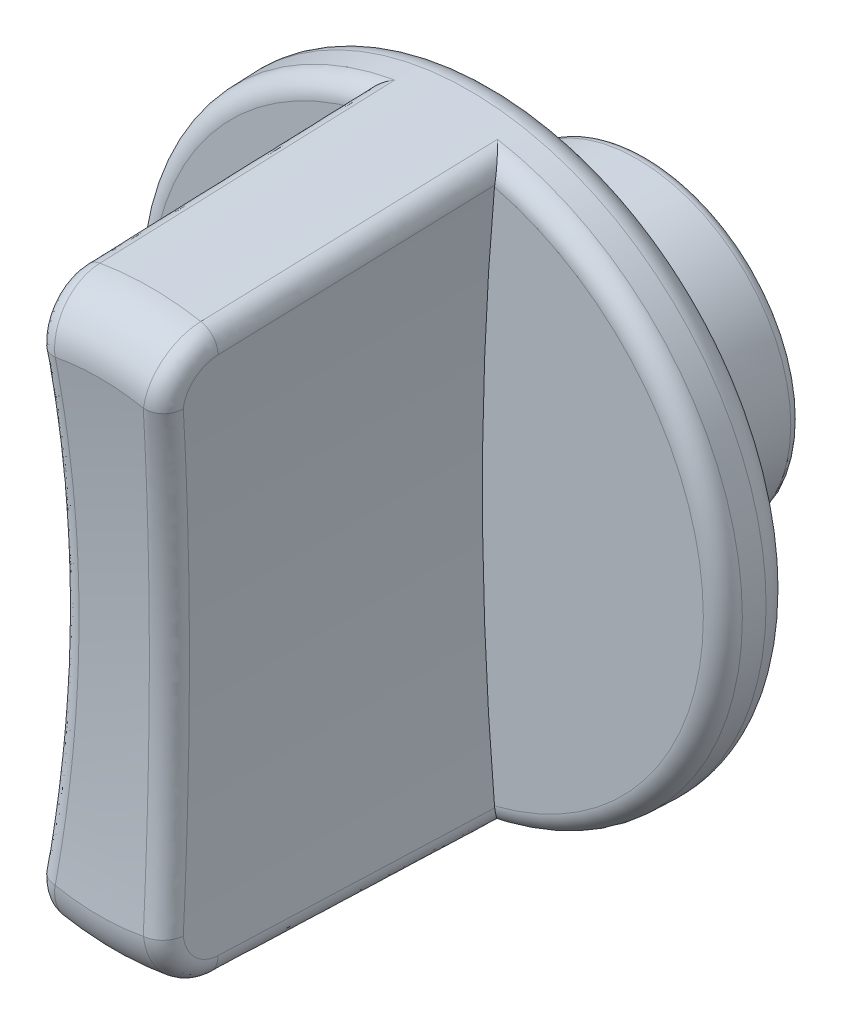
ISO-10303-21;
HEADER;
FILE_DESCRIPTION(('STEP AP214'),'2;1');
FILE_NAME('part.step','',(''),(''),'','','');
FILE_SCHEMA(('AUTOMOTIVE_DESIGN { 1 0 10303 214 1 1 1 1 }'));
ENDSEC;
DATA;
#1=APPLICATION_CONTEXT('core data for automotive mechanical design processes');
#2=APPLICATION_PROTOCOL_DEFINITION('international standard','automotive_design',2000,#1);
#3=PRODUCT_CONTEXT('',#1,'mechanical');
#4=PRODUCT('Part','Part','',(#3));
#5=PRODUCT_RELATED_PRODUCT_CATEGORY('part','',(#4));
#6=PRODUCT_DEFINITION_FORMATION('','',#4);
#7=PRODUCT_DEFINITION_CONTEXT('part definition',#1,'design');
#8=PRODUCT_DEFINITION('design','',#6,#7);
#9=PRODUCT_DEFINITION_SHAPE('','',#8);
#10=(LENGTH_UNIT() NAMED_UNIT(*) SI_UNIT(.MILLI.,.METRE.));
#11=(NAMED_UNIT(*) PLANE_ANGLE_UNIT() SI_UNIT($,.RADIAN.));
#12=(NAMED_UNIT(*) SI_UNIT($,.STERADIAN.) SOLID_ANGLE_UNIT());
#13=UNCERTAINTY_MEASURE_WITH_UNIT(LENGTH_MEASURE(1.E-05),#10,'distance_accuracy_value','');
#14=(GEOMETRIC_REPRESENTATION_CONTEXT(3) GLOBAL_UNCERTAINTY_ASSIGNED_CONTEXT((#13)) GLOBAL_UNIT_ASSIGNED_CONTEXT((#10,
#11,#12)) REPRESENTATION_CONTEXT('',''));
#15=CARTESIAN_POINT('',(0.,0.,0.));
#16=DIRECTION('',(0.,0.,1.));
#17=DIRECTION('',(1.,0.,0.));
#18=AXIS2_PLACEMENT_3D('',#15,#16,#17);
#19=CARTESIAN_POINT('',(0.,0.,9.37986599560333));
#20=DIRECTION('',(0.,0.,-1.));
#21=DIRECTION('',(-1.,0.,0.));
#22=AXIS2_PLACEMENT_3D('',#19,#20,#21);
#23=CONICAL_SURFACE('',#22,14.951814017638,0.0349065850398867);
#24=CARTESIAN_POINT('',(0.,0.,10.5348994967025));
#25=DIRECTION('',(0.,0.,-1.));
#26=DIRECTION('',(-1.,0.,0.));
#27=AXIS2_PLACEMENT_3D('',#24,#25,#26);
#28=CIRCLE('',#27,14.9114793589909);
#29=CARTESIAN_POINT('',(-2.58532278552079,-14.6856502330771,10.5348994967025));
#30=VERTEX_POINT('',#29);
#31=CARTESIAN_POINT('',(-2.58532278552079,14.6856502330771,10.5348994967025));
#32=VERTEX_POINT('',#31);
#33=EDGE_CURVE('E149',#30,#32,#28,.T.);
#34=ORIENTED_EDGE('',*,*,#33,.T.);
#35=CARTESIAN_POINT('',(-2.47226549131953,13.25972440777,51.2913866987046));
#36=CARTESIAN_POINT('',(-3.35907520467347,13.0944948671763,51.2881365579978));
#37=CARTESIAN_POINT('',(-3.28577574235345,12.1959580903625,51.2564872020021));
#38=CARTESIAN_POINT('',(-2.48334722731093,13.4107895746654,46.9805587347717));
#39=CARTESIAN_POINT('',(-3.37237798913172,13.2464409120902,46.9730443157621));
#40=CARTESIAN_POINT('',(-3.29799904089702,12.345796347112,46.9456592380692));
#41=CARTESIAN_POINT('',(-2.49471292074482,13.5617705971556,42.6697289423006));
#42=CARTESIAN_POINT('',(-3.38588966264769,13.3981050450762,42.6624615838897));
#43=CARTESIAN_POINT('',(-3.31044334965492,12.4955646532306,42.6348294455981));
#44=CARTESIAN_POINT('',(-2.51800094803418,13.863577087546,34.0480661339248));
#45=CARTESIAN_POINT('',(-3.41335840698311,13.7012205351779,34.0408916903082));
#46=CARTESIAN_POINT('',(-3.33577398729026,12.7949708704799,34.0131666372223));
#47=CARTESIAN_POINT('',(-2.52992328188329,14.014402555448,29.7372331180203));
#48=CARTESIAN_POINT('',(-3.42731499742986,13.8526566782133,29.7303247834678));
#49=CARTESIAN_POINT('',(-3.34866031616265,12.9446087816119,29.7023336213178));
#50=CARTESIAN_POINT('',(-2.55431331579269,14.3159106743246,21.1155641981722));
#51=CARTESIAN_POINT('',(-3.45567362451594,14.1553354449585,21.1087689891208));
#52=CARTESIAN_POINT('',(-3.37487499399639,13.2437637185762,21.0806647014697));
#53=CARTESIAN_POINT('',(-2.56678101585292,14.4665933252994,16.8047282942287));
#54=CARTESIAN_POINT('',(-3.4700752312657,14.3065643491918,16.7981599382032));
#55=CARTESIAN_POINT('',(-3.38820334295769,13.3932807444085,16.7698287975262));
#56=CARTESIAN_POINT('',(-2.59225257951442,14.767825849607,8.18305386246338));
#57=CARTESIAN_POINT('',(-3.4993237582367,14.6088404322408,8.17660813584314));
#58=CARTESIAN_POINT('',(-3.4153020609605,13.6922014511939,8.14815436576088));
#59=CARTESIAN_POINT('',(-2.60525644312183,14.9183757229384,3.87221533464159));
#60=CARTESIAN_POINT('',(-3.51417028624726,14.7598751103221,3.8660121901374));
#61=CARTESIAN_POINT('',(-3.42907243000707,13.8416051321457,3.83731583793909));
#62=CARTESIAN_POINT('',(-2.61852378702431,15.0688642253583,-0.438624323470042));
#63=CARTESIAN_POINT('',(-3.5292268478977,14.9107009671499,-0.441164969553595));
#64=CARTESIAN_POINT('',(-3.4430638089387,13.9909559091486,-0.473523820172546));
#65=(BOUNDED_SURFACE() B_SPLINE_SURFACE(3,2,((#35,#36,#37),(#38,#39,#40),(#41,#42,#43),(#44,#45,
#46),(#47,#48,#49),(#50,#51,#52),(#53,#54,#55),(#56,#57,#58),(#59,#60,#61),(#62,#63,#64)),
.UNSPECIFIED.,.F.,.F.,.F.) B_SPLINE_SURFACE_WITH_KNOTS((4,2,2,2,4),(3,3),(0.,12.9404508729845,
25.8809015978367,38.8213523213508,51.761803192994),(0.,1.),
.UNSPECIFIED.) GEOMETRIC_REPRESENTATION_ITEM() RATIONAL_B_SPLINE_SURFACE(((1.,0.742526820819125,
1.),(1.,0.741774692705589,1.),(1.,0.741042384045,1.),(1.,0.73961385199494,1.),(1.,
0.738917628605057,1.),(1.,0.737557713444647,1.),(1.,0.736894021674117,1.),(1.,0.735596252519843,
1.),(1.,0.734962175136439,1.),(1.,0.734341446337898,1.))) REPRESENTATION_ITEM('') SURFACE());
#66=CARTESIAN_POINT('',(-2.61852378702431,15.0688642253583,-0.438624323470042));
#67=CARTESIAN_POINT('',(-2.60525644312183,14.9183757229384,3.8722153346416));
#68=CARTESIAN_POINT('',(-2.59225257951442,14.767825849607,8.18305386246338));
#69=CARTESIAN_POINT('',(-2.56678101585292,14.4665933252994,16.8047282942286));
#70=CARTESIAN_POINT('',(-2.55431331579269,14.3159106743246,21.1155641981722));
#71=CARTESIAN_POINT('',(-2.52992328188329,14.0144025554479,29.7372331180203));
#72=CARTESIAN_POINT('',(-2.51800094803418,13.863577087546,34.0480661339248));
#73=CARTESIAN_POINT('',(-2.49471292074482,13.5617705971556,42.6697289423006));
#74=CARTESIAN_POINT('',(-2.48334722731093,13.4107895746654,46.9805587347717));
#75=CARTESIAN_POINT('',(-2.47226549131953,13.25972440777,51.2913866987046));
#76=B_SPLINE_CURVE_WITH_KNOTS('',3,(#66,#67,#68,#69,#70,#71,#72,#73,#74,#75),.UNSPECIFIED.,.F.,
.F.,(4,2,2,2,4),(0.,12.9404508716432,25.8809015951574,38.8213523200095,51.761803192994),.UNSPECIFIED.);
#77=CARTESIAN_POINT('',(-2.54211829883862,14.1651566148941,25.4263986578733));
#78=VERTEX_POINT('',#77);
#79=EDGE_CURVE('E286',#32,#78,#76,.T.);
#80=ORIENTED_EDGE('',*,*,#79,.T.);
#81=CARTESIAN_POINT('',(0.,0.,25.4263986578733));
#82=DIRECTION('',(0.,0.,1.));
#83=DIRECTION('',(1.,0.,0.));
#84=AXIS2_PLACEMENT_3D('',#81,#82,#83);
#85=CIRCLE('',#84,14.3914567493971);
#86=CARTESIAN_POINT('',(2.54211829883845,14.1651566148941,25.4263986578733));
#87=VERTEX_POINT('',#86);
#88=EDGE_CURVE('E166',#87,#78,#85,.T.);
#89=ORIENTED_EDGE('',*,*,#88,.F.);
#90=CARTESIAN_POINT('',(3.28577574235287,12.1959580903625,51.2564872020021));
#91=CARTESIAN_POINT('',(3.35907520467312,13.0944948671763,51.2881365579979));
#92=CARTESIAN_POINT('',(2.47226549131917,13.25972440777,51.2913866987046));
#93=CARTESIAN_POINT('',(3.29799904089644,12.345796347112,46.9456592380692));
#94=CARTESIAN_POINT('',(3.37237798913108,13.2464409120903,46.9730443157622));
#95=CARTESIAN_POINT('',(2.48334722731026,13.4107895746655,46.9805587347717));
#96=CARTESIAN_POINT('',(3.31044334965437,12.4955646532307,42.6348294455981));
#97=CARTESIAN_POINT('',(3.38588966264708,13.3981050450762,42.6624615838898));
#98=CARTESIAN_POINT('',(2.49471292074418,13.5617705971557,42.6697289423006));
#99=CARTESIAN_POINT('',(3.3357739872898,12.7949708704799,34.0131666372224));
#100=CARTESIAN_POINT('',(3.41335840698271,13.701220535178,34.0408916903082));
#101=CARTESIAN_POINT('',(2.51800094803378,13.863577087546,34.0480661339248));
#102=CARTESIAN_POINT('',(3.34866031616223,12.9446087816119,29.7023336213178));
#103=CARTESIAN_POINT('',(3.42731499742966,13.8526566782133,29.7303247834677));
#104=CARTESIAN_POINT('',(2.52992328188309,14.0144025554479,29.7372331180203));
#105=CARTESIAN_POINT('',(3.37487499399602,13.2437637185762,21.0806647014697));
#106=CARTESIAN_POINT('',(3.4556736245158,14.1553354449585,21.1087689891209));
#107=CARTESIAN_POINT('',(2.55431331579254,14.3159106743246,21.1155641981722));
#108=CARTESIAN_POINT('',(3.38820334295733,13.3932807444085,16.7698287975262));
#109=CARTESIAN_POINT('',(3.47007523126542,14.3065643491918,16.7981599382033));
#110=CARTESIAN_POINT('',(2.56678101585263,14.4665933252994,16.8047282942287));
#111=CARTESIAN_POINT('',(3.41530206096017,13.6922014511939,8.14815436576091));
#112=CARTESIAN_POINT('',(3.4993237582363,14.6088404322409,8.17660813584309));
#113=CARTESIAN_POINT('',(2.592252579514,14.7678258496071,8.18305386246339));
#114=CARTESIAN_POINT('',(3.42907243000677,13.8416051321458,3.83731583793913));
#115=CARTESIAN_POINT('',(3.51417028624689,14.7598751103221,3.86601219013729));
#116=CARTESIAN_POINT('',(2.60525644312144,14.9183757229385,3.87221533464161));
#117=CARTESIAN_POINT('',(3.44306380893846,13.9909559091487,-0.473523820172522));
#118=CARTESIAN_POINT('',(3.52922684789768,14.9107009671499,-0.441164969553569));
#119=CARTESIAN_POINT('',(2.61852378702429,15.0688642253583,-0.438624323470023));
#120=(BOUNDED_SURFACE() B_SPLINE_SURFACE(3,2,((#90,#91,#92),(#93,#94,#95),(#96,#97,#98),(#99,
#100,#101),(#102,#103,#104),(#105,#106,#107),(#108,#109,#110),(#111,#112,#113),(#114,#115,#116),
(#117,#118,#119)),.UNSPECIFIED.,.F.,.F.,.F.) B_SPLINE_SURFACE_WITH_KNOTS((4,2,2,2,4),(3,3),(0.,
12.9404508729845,25.8809015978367,38.8213523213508,51.761803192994),(0.,1.),
.UNSPECIFIED.) GEOMETRIC_REPRESENTATION_ITEM() RATIONAL_B_SPLINE_SURFACE(((1.,0.742526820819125,
1.),(1.,0.74177469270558,1.),(1.,0.741042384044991,1.),(1.,0.739613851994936,1.),(1.,
0.738917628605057,1.),(1.,0.737557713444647,1.),(1.,0.736894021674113,1.),(1.,0.735596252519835,
1.),(1.,0.73496217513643,1.),(1.,0.734341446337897,1.))) REPRESENTATION_ITEM('') SURFACE());
#121=CARTESIAN_POINT('',(2.47226549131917,13.25972440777,51.2913866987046));
#122=CARTESIAN_POINT('',(2.48334722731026,13.4107895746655,46.9805587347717));
#123=CARTESIAN_POINT('',(2.49471292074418,13.5617705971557,42.6697289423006));
#124=CARTESIAN_POINT('',(2.51800094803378,13.863577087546,34.0480661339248));
#125=CARTESIAN_POINT('',(2.52992328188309,14.0144025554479,29.7372331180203));
#126=CARTESIAN_POINT('',(2.55431331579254,14.3159106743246,21.1155641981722));
#127=CARTESIAN_POINT('',(2.56678101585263,14.4665933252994,16.8047282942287));
#128=CARTESIAN_POINT('',(2.592252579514,14.7678258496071,8.18305386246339));
#129=CARTESIAN_POINT('',(2.60525644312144,14.9183757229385,3.87221533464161));
#130=CARTESIAN_POINT('',(2.61852378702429,15.0688642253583,-0.438624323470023));
#131=B_SPLINE_CURVE_WITH_KNOTS('',3,(#121,#122,#123,#124,#125,#126,#127,#128,#129,#130),
.UNSPECIFIED.,.F.,.F.,(4,2,2,2,4),(0.,12.9404508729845,25.8809015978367,38.8213523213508,
51.761803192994),.UNSPECIFIED.);
#132=CARTESIAN_POINT('',(2.58532278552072,14.6856502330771,10.5348994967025));
#133=VERTEX_POINT('',#132);
#134=EDGE_CURVE('E150',#87,#133,#131,.T.);
#135=ORIENTED_EDGE('',*,*,#134,.T.);
#136=CARTESIAN_POINT('',(0.,0.,10.5348994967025));
#137=DIRECTION('',(0.,0.,-1.));
#138=DIRECTION('',(-1.,0.,0.));
#139=AXIS2_PLACEMENT_3D('',#136,#137,#138);
#140=CIRCLE('',#139,14.9114793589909);
#141=CARTESIAN_POINT('',(2.58532278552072,-14.6856502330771,10.5348994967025));
#142=VERTEX_POINT('',#141);
#143=EDGE_CURVE('E327',#133,#142,#140,.T.);
#144=ORIENTED_EDGE('',*,*,#143,.T.);
#145=CARTESIAN_POINT('',(2.47226549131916,-13.25972440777,51.2913866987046));
#146=CARTESIAN_POINT('',(3.35907520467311,-13.0944948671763,51.2881365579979));
#147=CARTESIAN_POINT('',(3.28577574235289,-12.1959580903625,51.2564872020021));
#148=CARTESIAN_POINT('',(2.48334722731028,-13.4107895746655,46.9805587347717));
#149=CARTESIAN_POINT('',(3.37237798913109,-13.2464409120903,46.9730443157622));
#150=CARTESIAN_POINT('',(3.29799904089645,-12.345796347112,46.9456592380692));
#151=CARTESIAN_POINT('',(2.4947129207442,-13.5617705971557,42.6697289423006));
#152=CARTESIAN_POINT('',(3.3858896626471,-13.3981050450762,42.6624615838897));
#153=CARTESIAN_POINT('',(3.31044334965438,-12.4955646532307,42.6348294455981));
#154=CARTESIAN_POINT('',(2.51800094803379,-13.863577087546,34.0480661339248));
#155=CARTESIAN_POINT('',(3.41335840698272,-13.701220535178,34.0408916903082));
#156=CARTESIAN_POINT('',(3.33577398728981,-12.7949708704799,34.0131666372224));
#157=CARTESIAN_POINT('',(2.52992328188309,-14.014402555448,29.7372331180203));
#158=CARTESIAN_POINT('',(3.42731499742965,-13.8526566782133,29.7303247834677));
#159=CARTESIAN_POINT('',(3.34866031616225,-12.9446087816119,29.7023336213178));
#160=CARTESIAN_POINT('',(2.55431331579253,-14.3159106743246,21.1155641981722));
#161=CARTESIAN_POINT('',(3.45567362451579,-14.1553354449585,21.1087689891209));
#162=CARTESIAN_POINT('',(3.37487499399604,-13.2437637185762,21.0806647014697));
#163=CARTESIAN_POINT('',(2.56678101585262,-14.4665933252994,16.8047282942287));
#164=CARTESIAN_POINT('',(3.47007523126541,-14.3065643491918,16.7981599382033));
#165=CARTESIAN_POINT('',(3.38820334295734,-13.3932807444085,16.7698287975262));
#166=CARTESIAN_POINT('',(2.59225257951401,-14.7678258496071,8.18305386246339));
#167=CARTESIAN_POINT('',(3.49932375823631,-14.6088404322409,8.1766081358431));
#168=CARTESIAN_POINT('',(3.41530206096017,-13.6922014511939,8.14815436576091));
#169=CARTESIAN_POINT('',(2.60525644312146,-14.9183757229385,3.87221533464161));
#170=CARTESIAN_POINT('',(3.51417028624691,-14.7598751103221,3.86601219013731));
#171=CARTESIAN_POINT('',(3.42907243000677,-13.8416051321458,3.83731583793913));
#172=CARTESIAN_POINT('',(2.61852378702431,-15.0688642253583,-0.438624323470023));
#173=CARTESIAN_POINT('',(3.5292268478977,-14.9107009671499,-0.441164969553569));
#174=CARTESIAN_POINT('',(3.44306380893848,-13.9909559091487,-0.473523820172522));
#175=(BOUNDED_SURFACE() B_SPLINE_SURFACE(3,2,((#145,#146,#147),(#148,#149,#150),(#151,#152,
#153),(#154,#155,#156),(#157,#158,#159),(#160,#161,#162),(#163,#164,#165),(#166,#167,#168),
(#169,#170,#171),(#172,#173,#174)),.UNSPECIFIED.,.F.,.F.,.F.) B_SPLINE_SURFACE_WITH_KNOTS((4,2,
2,2,4),(3,3),(0.,12.9404508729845,25.8809015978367,38.8213523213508,51.761803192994),(0.,1.),
.UNSPECIFIED.) GEOMETRIC_REPRESENTATION_ITEM() RATIONAL_B_SPLINE_SURFACE(((1.,0.742526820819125,
1.),(1.,0.741774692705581,1.),(1.,0.741042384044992,1.),(1.,0.739613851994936,1.),(1.,
0.738917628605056,1.),(1.,0.737557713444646,1.),(1.,0.736894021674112,1.),(1.,0.735596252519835,
1.),(1.,0.734962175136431,1.),(1.,0.734341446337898,1.))) REPRESENTATION_ITEM('') SURFACE());
#176=CARTESIAN_POINT('',(2.61852378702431,-15.0688642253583,-0.438624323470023));
#177=CARTESIAN_POINT('',(2.60525644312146,-14.9183757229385,3.87221533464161));
#178=CARTESIAN_POINT('',(2.59225257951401,-14.7678258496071,8.18305386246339));
#179=CARTESIAN_POINT('',(2.56678101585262,-14.4665933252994,16.8047282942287));
#180=CARTESIAN_POINT('',(2.55431331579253,-14.3159106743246,21.1155641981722));
#181=CARTESIAN_POINT('',(2.52992328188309,-14.014402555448,29.7372331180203));
#182=CARTESIAN_POINT('',(2.51800094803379,-13.863577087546,34.0480661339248));
#183=CARTESIAN_POINT('',(2.4947129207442,-13.5617705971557,42.6697289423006));
#184=CARTESIAN_POINT('',(2.48334722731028,-13.4107895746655,46.9805587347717));
#185=CARTESIAN_POINT('',(2.47226549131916,-13.25972440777,51.2913866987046));
#186=B_SPLINE_CURVE_WITH_KNOTS('',3,(#176,#177,#178,#179,#180,#181,#182,#183,#184,#185),
.UNSPECIFIED.,.F.,.F.,(4,2,2,2,4),(0.,12.9404508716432,25.8809015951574,38.8213523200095,
51.761803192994),.UNSPECIFIED.);
#187=CARTESIAN_POINT('',(2.54211829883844,-14.1651566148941,25.4263986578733));
#188=VERTEX_POINT('',#187);
#189=EDGE_CURVE('E165',#142,#188,#186,.T.);
#190=ORIENTED_EDGE('',*,*,#189,.T.);
#191=CARTESIAN_POINT('',(-2.54211829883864,-14.1651566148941,25.4263986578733));
#192=VERTEX_POINT('',#191);
#193=EDGE_CURVE('E155',#192,#188,#85,.T.);
#194=ORIENTED_EDGE('',*,*,#193,.F.);
#195=CARTESIAN_POINT('',(-3.28577574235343,-12.1959580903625,51.2564872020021));
#196=CARTESIAN_POINT('',(-3.35907520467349,-13.0944948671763,51.2881365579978));
#197=CARTESIAN_POINT('',(-2.47226549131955,-13.25972440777,51.2913866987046));
#198=CARTESIAN_POINT('',(-3.29799904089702,-12.345796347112,46.9456592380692));
#199=CARTESIAN_POINT('',(-3.37237798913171,-13.2464409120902,46.9730443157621));
#200=CARTESIAN_POINT('',(-2.48334722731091,-13.4107895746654,46.9805587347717));
#201=CARTESIAN_POINT('',(-3.31044334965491,-12.4955646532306,42.6348294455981));
#202=CARTESIAN_POINT('',(-3.38588966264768,-13.3981050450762,42.6624615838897));
#203=CARTESIAN_POINT('',(-2.4947129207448,-13.5617705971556,42.6697289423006));
#204=CARTESIAN_POINT('',(-3.33577398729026,-12.7949708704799,34.0131666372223));
#205=CARTESIAN_POINT('',(-3.41335840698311,-13.7012205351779,34.0408916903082));
#206=CARTESIAN_POINT('',(-2.51800094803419,-13.863577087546,34.0480661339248));
#207=CARTESIAN_POINT('',(-3.34866031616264,-12.9446087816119,29.7023336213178));
#208=CARTESIAN_POINT('',(-3.42731499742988,-13.8526566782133,29.7303247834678));
#209=CARTESIAN_POINT('',(-2.52992328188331,-14.0144025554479,29.7372331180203));
#210=CARTESIAN_POINT('',(-3.37487499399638,-13.2437637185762,21.0806647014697));
#211=CARTESIAN_POINT('',(-3.45567362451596,-14.1553354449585,21.1087689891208));
#212=CARTESIAN_POINT('',(-2.5543133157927,-14.3159106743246,21.1155641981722));
#213=CARTESIAN_POINT('',(-3.38820334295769,-13.3932807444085,16.7698287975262));
#214=CARTESIAN_POINT('',(-3.47007523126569,-14.3065643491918,16.7981599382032));
#215=CARTESIAN_POINT('',(-2.56678101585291,-14.4665933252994,16.8047282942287));
#216=CARTESIAN_POINT('',(-3.41530206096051,-13.6922014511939,8.14815436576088));
#217=CARTESIAN_POINT('',(-3.49932375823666,-14.6088404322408,8.17660813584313));
#218=CARTESIAN_POINT('',(-2.59225257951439,-14.767825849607,8.18305386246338));
#219=CARTESIAN_POINT('',(-3.42907243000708,-13.8416051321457,3.83731583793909));
#220=CARTESIAN_POINT('',(-3.51417028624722,-14.7598751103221,3.86601219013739));
#221=CARTESIAN_POINT('',(-2.60525644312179,-14.9183757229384,3.87221533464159));
#222=CARTESIAN_POINT('',(-3.44306380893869,-13.9909559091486,-0.473523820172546));
#223=CARTESIAN_POINT('',(-3.52922684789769,-14.9107009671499,-0.441164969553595));
#224=CARTESIAN_POINT('',(-2.6185237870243,-15.0688642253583,-0.438624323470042));
#225=(BOUNDED_SURFACE() B_SPLINE_SURFACE(3,2,((#195,#196,#197),(#198,#199,#200),(#201,#202,
#203),(#204,#205,#206),(#207,#208,#209),(#210,#211,#212),(#213,#214,#215),(#216,#217,#218),
(#219,#220,#221),(#222,#223,#224)),.UNSPECIFIED.,.F.,.F.,.F.) B_SPLINE_SURFACE_WITH_KNOTS((4,2,
2,2,4),(3,3),(0.,12.9404508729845,25.8809015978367,38.8213523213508,51.761803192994),(0.,1.),
.UNSPECIFIED.) GEOMETRIC_REPRESENTATION_ITEM() RATIONAL_B_SPLINE_SURFACE(((1.,0.742526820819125,
1.),(1.,0.741774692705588,1.),(1.,0.741042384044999,1.),(1.,0.73961385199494,1.),(1.,
0.738917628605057,1.),(1.,0.737557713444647,1.),(1.,0.736894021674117,1.),(1.,0.735596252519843,
1.),(1.,0.734962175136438,1.),(1.,0.734341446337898,1.))) REPRESENTATION_ITEM('') SURFACE());
#226=CARTESIAN_POINT('',(-2.47226549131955,-13.25972440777,51.2913866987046));
#227=CARTESIAN_POINT('',(-2.48334722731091,-13.4107895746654,46.9805587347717));
#228=CARTESIAN_POINT('',(-2.4947129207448,-13.5617705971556,42.6697289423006));
#229=CARTESIAN_POINT('',(-2.51800094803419,-13.863577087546,34.0480661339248));
#230=CARTESIAN_POINT('',(-2.52992328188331,-14.0144025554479,29.7372331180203));
#231=CARTESIAN_POINT('',(-2.5543133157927,-14.3159106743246,21.1155641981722));
#232=CARTESIAN_POINT('',(-2.56678101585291,-14.4665933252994,16.8047282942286));
#233=CARTESIAN_POINT('',(-2.59225257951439,-14.767825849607,8.18305386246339));
#234=CARTESIAN_POINT('',(-2.60525644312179,-14.9183757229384,3.8722153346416));
#235=CARTESIAN_POINT('',(-2.6185237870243,-15.0688642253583,-0.438624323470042));
#236=B_SPLINE_CURVE_WITH_KNOTS('',3,(#226,#227,#228,#229,#230,#231,#232,#233,#234,#235),
.UNSPECIFIED.,.F.,.F.,(4,2,2,2,4),(0.,12.9404508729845,25.8809015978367,38.8213523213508,
51.761803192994),.UNSPECIFIED.);
#237=EDGE_CURVE('E142',#192,#30,#236,.T.);
#238=ORIENTED_EDGE('',*,*,#237,.T.);
#239=EDGE_LOOP('',(#34,#80,#89,#135,#144,#190,#194,#238));
#240=FACE_BOUND('',#239,.T.);
#241=CARTESIAN_POINT('',(0.,0.,9.37986599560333));
#242=DIRECTION('',(0.,0.,1.));
#243=DIRECTION('',(1.,0.,0.));
#244=AXIS2_PLACEMENT_3D('',#241,#242,#243);
#245=CIRCLE('',#244,14.951814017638);
#246=CARTESIAN_POINT('',(14.951814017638,0.,9.37986599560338));
#247=VERTEX_POINT('',#246);
#248=EDGE_CURVE('E170',#247,#247,#245,.T.);
#249=ORIENTED_EDGE('',*,*,#248,.T.);
#250=EDGE_LOOP('',(#249));
#251=FACE_BOUND('',#250,.T.);
#252=ADVANCED_FACE('F15',(#240,#251),#23,.T.);
#253=CARTESIAN_POINT('',(0.,0.,25.3333333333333));
#254=DIRECTION('',(0.,0.,1.));
#255=DIRECTION('',(1.,0.,0.));
#256=AXIS2_PLACEMENT_3D('',#253,#254,#255);
#257=TOROIDAL_SURFACE('',#256,11.7264145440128,2.66666666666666);
#258=CARTESIAN_POINT('',(-5.09660929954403,26.2090390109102,30.2386060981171));
#259=CARTESIAN_POINT('',(-5.04566440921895,25.9219556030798,31.1887265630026));
#260=CARTESIAN_POINT('',(-4.06680563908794,26.0938344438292,31.1945861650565));
#261=CARTESIAN_POINT('',(-4.90775050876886,25.144919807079,29.9047265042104));
#262=CARTESIAN_POINT('',(-4.86064558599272,24.8673892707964,30.8601550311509));
#263=CARTESIAN_POINT('',(-3.87877699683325,25.0343926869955,30.8643755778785));
#264=CARTESIAN_POINT('',(-4.72935205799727,24.0726340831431,29.5912097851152));
#265=CARTESIAN_POINT('',(-4.68612565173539,23.8061708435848,30.5520515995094));
#266=CARTESIAN_POINT('',(-3.7011627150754,23.9668203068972,30.5543040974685));
#267=CARTESIAN_POINT('',(-4.39445096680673,21.9135860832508,29.005414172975));
#268=CARTESIAN_POINT('',(-4.35848164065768,21.6694836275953,29.9763070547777));
#269=CARTESIAN_POINT('',(-3.36773371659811,21.8172626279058,29.9749457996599));
#270=CARTESIAN_POINT('',(-4.23794909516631,20.8268233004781,28.7331367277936));
#271=CARTESIAN_POINT('',(-4.20543787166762,20.5942444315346,29.7088125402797));
#272=CARTESIAN_POINT('',(-3.21191976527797,20.7352768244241,29.7056604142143));
#273=CARTESIAN_POINT('',(-3.9478166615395,18.640654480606,28.2303326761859));
#274=CARTESIAN_POINT('',(-3.92168140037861,18.4313042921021,29.2147619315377));
#275=CARTESIAN_POINT('',(-2.92306263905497,18.558717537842,29.2083816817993));
#276=CARTESIAN_POINT('',(-3.81418815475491,17.5412473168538,27.9998098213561));
#277=CARTESIAN_POINT('',(-3.79104328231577,17.3438567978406,28.9883392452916));
#278=CARTESIAN_POINT('',(-2.79002151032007,17.464142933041,28.9803920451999));
#279=CARTESIAN_POINT('',(-3.57063498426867,15.3320182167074,27.5809917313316));
#280=CARTESIAN_POINT('',(-3.5529068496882,15.1586323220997,28.5769010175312));
#281=CARTESIAN_POINT('',(-2.5475389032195,15.2646247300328,28.5661763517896));
#282=CARTESIAN_POINT('',(-3.46070990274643,14.2221964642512,27.3926957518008));
#283=CARTESIAN_POINT('',(-3.44547160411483,14.0611311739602,28.3919963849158));
#284=CARTESIAN_POINT('',(-2.43809700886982,14.1596813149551,28.3799495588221));
#285=CARTESIAN_POINT('',(-3.17324072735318,10.9448663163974,26.9014345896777));
#286=CARTESIAN_POINT('',(-3.16430251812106,10.8183834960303,27.9092094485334));
#287=CARTESIAN_POINT('',(-2.15189143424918,10.896757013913,27.8940868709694));
#288=CARTESIAN_POINT('',(-3.02946496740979,8.765254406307,26.6574036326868));
#289=CARTESIAN_POINT('',(-3.02394203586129,8.66439004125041,27.6698295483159));
#290=CARTESIAN_POINT('',(-2.00874765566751,8.72672581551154,27.6527375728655));
#291=CARTESIAN_POINT('',(-2.83742503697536,4.39042701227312,26.3318875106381));
#292=CARTESIAN_POINT('',(-2.83626907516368,4.33910628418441,27.3501807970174));
#293=CARTESIAN_POINT('',(-1.81755185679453,4.37112843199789,27.3307985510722));
#294=CARTESIAN_POINT('',(-2.78914896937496,2.19521350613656,26.2503820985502));
#295=CARTESIAN_POINT('',(-2.78914896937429,2.17015132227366,27.2702402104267));
#296=CARTESIAN_POINT('',(-1.76948799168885,2.18556421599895,27.2501888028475));
#297=CARTESIAN_POINT('',(-2.78914896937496,-2.19521350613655,26.2503820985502));
#298=CARTESIAN_POINT('',(-2.78914896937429,-2.17015132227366,27.2702402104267));
#299=CARTESIAN_POINT('',(-1.76948799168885,-2.18556421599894,27.2501888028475));
#300=CARTESIAN_POINT('',(-2.83742503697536,-4.39042701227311,26.3318875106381));
#301=CARTESIAN_POINT('',(-2.83626907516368,-4.33910628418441,27.3501807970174));
#302=CARTESIAN_POINT('',(-1.81755185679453,-4.37112843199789,27.3307985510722));
#303=CARTESIAN_POINT('',(-3.02946496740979,-8.765254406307,26.6574036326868));
#304=CARTESIAN_POINT('',(-3.02394203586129,-8.66439004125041,27.6698295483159));
#305=CARTESIAN_POINT('',(-2.00874765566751,-8.72672581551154,27.6527375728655));
#306=CARTESIAN_POINT('',(-3.17324072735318,-10.9448663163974,26.9014345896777));
#307=CARTESIAN_POINT('',(-3.16430251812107,-10.8183834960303,27.9092094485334));
#308=CARTESIAN_POINT('',(-2.15189143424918,-10.896757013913,27.8940868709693));
#309=CARTESIAN_POINT('',(-3.46070990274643,-14.2221964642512,27.3926957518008));
#310=CARTESIAN_POINT('',(-3.44547160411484,-14.0611311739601,28.3919963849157));
#311=CARTESIAN_POINT('',(-2.43809700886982,-14.1596813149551,28.3799495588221));
#312=CARTESIAN_POINT('',(-3.57063498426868,-15.3320182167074,27.5809917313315));
#313=CARTESIAN_POINT('',(-3.55290684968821,-15.1586323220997,28.5769010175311));
#314=CARTESIAN_POINT('',(-2.5475389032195,-15.2646247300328,28.5661763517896));
#315=CARTESIAN_POINT('',(-3.81418815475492,-17.5412473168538,27.9998098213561));
#316=CARTESIAN_POINT('',(-3.79104328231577,-17.3438567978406,28.9883392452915));
#317=CARTESIAN_POINT('',(-2.79002151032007,-17.464142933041,28.9803920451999));
#318=CARTESIAN_POINT('',(-3.94781666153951,-18.640654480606,28.2303326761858));
#319=CARTESIAN_POINT('',(-3.9216814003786,-18.4313042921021,29.2147619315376));
#320=CARTESIAN_POINT('',(-2.92306263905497,-18.558717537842,29.2083816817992));
#321=CARTESIAN_POINT('',(-4.23794909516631,-20.8268233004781,28.7331367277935));
#322=CARTESIAN_POINT('',(-4.20543787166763,-20.5942444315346,29.7088125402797));
#323=CARTESIAN_POINT('',(-3.21191976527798,-20.7352768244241,29.7056604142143));
#324=CARTESIAN_POINT('',(-4.39445096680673,-21.9135860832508,29.0054141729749));
#325=CARTESIAN_POINT('',(-4.3584816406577,-21.6694836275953,29.9763070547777));
#326=CARTESIAN_POINT('',(-3.36773371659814,-21.8172626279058,29.9749457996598));
#327=CARTESIAN_POINT('',(-4.72935205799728,-24.0726340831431,29.5912097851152));
#328=CARTESIAN_POINT('',(-4.68612565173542,-23.8061708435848,30.5520515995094));
#329=CARTESIAN_POINT('',(-3.70116271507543,-23.9668203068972,30.5543040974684));
#330=CARTESIAN_POINT('',(-4.90775050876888,-25.144919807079,29.9047265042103));
#331=CARTESIAN_POINT('',(-4.86064558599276,-24.8673892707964,30.8601550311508));
#332=CARTESIAN_POINT('',(-3.87877699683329,-25.0343926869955,30.8643755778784));
#333=CARTESIAN_POINT('',(-5.09660929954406,-26.2090390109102,30.238606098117));
#334=CARTESIAN_POINT('',(-5.04566440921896,-25.9219556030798,31.1887265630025));
#335=CARTESIAN_POINT('',(-4.06680563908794,-26.0938344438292,31.1945861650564));
#336=(BOUNDED_SURFACE() B_SPLINE_SURFACE(3,2,((#258,#259,#260),(#261,#262,#263),(#264,#265,
#266),(#267,#268,#269),(#270,#271,#272),(#273,#274,#275),(#276,#277,#278),(#279,#280,#281),
(#282,#283,#284),(#285,#286,#287),(#288,#289,#290),(#291,#292,#293),(#294,#295,#296),(#297,#298,
#299),(#300,#301,#302),(#303,#304,#305),(#306,#307,#308),(#309,#310,#311),(#312,#313,#314),
(#315,#316,#317),(#318,#319,#320),(#321,#322,#323),(#324,#325,#326),(#327,#328,#329),(#330,#331,
#332),(#333,#334,#335)),.UNSPECIFIED.,.F.,.F.,.F.) B_SPLINE_SURFACE_WITH_KNOTS((4,2,2,2,2,2,2,2,
2,2,2,2,4),(3,3),(0.,3.41384072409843,6.82780127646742,10.2420684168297,13.6562753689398,
20.2847522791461,26.9124033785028,33.5400544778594,40.1685313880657,43.5827383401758,
46.9970054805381,50.4109660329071,53.8248067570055),(0.,1.),
.UNSPECIFIED.) GEOMETRIC_REPRESENTATION_ITEM() RATIONAL_B_SPLINE_SURFACE(((1.,0.709283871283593,
1.),(1.,0.708538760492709,1.),(1.,0.707833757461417,1.),(1.,0.706508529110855,1.),(1.,
0.705888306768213,1.),(1.,0.704737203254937,1.),(1.,0.704206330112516,1.),(1.,0.703237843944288,
1.),(1.,0.702800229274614,1.),(1.,0.701654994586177,1.),(1.,0.701081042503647,1.),(1.,
0.700314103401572,1.),(1.,0.700121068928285,1.),(1.,0.700121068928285,1.),(1.,0.700314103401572,
1.),(1.,0.701081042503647,1.),(1.,0.701654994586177,1.),(1.,0.702800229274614,1.),(1.,
0.703237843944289,1.),(1.,0.704206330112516,1.),(1.,0.704737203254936,1.),(1.,0.705888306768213,
1.),(1.,0.706508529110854,1.),(1.,0.707833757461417,1.),(1.,0.70853876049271,1.),(1.,
0.709283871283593,1.))) REPRESENTATION_ITEM('') SURFACE());
#337=CARTESIAN_POINT('',(-2.21412295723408,-11.5154877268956,28.));
#338=CARTESIAN_POINT('',(-2.21653634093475,-11.5149537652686,28.0000000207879));
#339=CARTESIAN_POINT('',(-2.21896356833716,-11.5145229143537,28.00000002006));
#340=CARTESIAN_POINT('',(-2.2238457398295,-11.5138674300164,27.9999999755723));
#341=CARTESIAN_POINT('',(-2.22630068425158,-11.513642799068,27.9999999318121));
#342=CARTESIAN_POINT('',(-2.22876947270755,-11.5135212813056,27.9999998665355));
#343=B_SPLINE_CURVE_WITH_KNOTS('',3,(#337,#338,#339,#340,#341,#342),.UNSPECIFIED.,.F.,.F.,(4,2,
4),(0.,0.007395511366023,0.0147911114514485),.UNSPECIFIED.);
#344=CARTESIAN_POINT('',(-2.21412295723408,-11.5154877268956,28.));
#345=VERTEX_POINT('',#344);
#346=CARTESIAN_POINT('',(-2.22876947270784,-11.5135212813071,27.9999998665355));
#347=VERTEX_POINT('',#346);
#348=EDGE_CURVE('E159',#345,#347,#343,.T.);
#349=ORIENTED_EDGE('',*,*,#348,.T.);
#350=CARTESIAN_POINT('',(-2.53756322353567,-14.1263760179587,24.8697783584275));
#351=CARTESIAN_POINT('',(-3.43812056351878,-13.9671539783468,24.8839842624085));
#352=CARTESIAN_POINT('',(-3.35964859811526,-13.0699815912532,25.0436114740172));
#353=CARTESIAN_POINT('',(-2.53945556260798,-14.1424869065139,24.961485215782));
#354=CARTESIAN_POINT('',(-3.43951590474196,-13.9824035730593,24.9729244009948));
#355=CARTESIAN_POINT('',(-3.36052845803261,-13.0800371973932,25.1009282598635));
#356=CARTESIAN_POINT('',(-2.5407842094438,-14.1537986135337,25.0539897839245));
#357=CARTESIAN_POINT('',(-3.44049634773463,-13.9931090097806,25.0626106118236));
#358=CARTESIAN_POINT('',(-3.36114664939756,-13.0870973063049,25.1587436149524));
#359=CARTESIAN_POINT('',(-2.5423071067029,-14.1667640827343,25.2398323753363));
#360=CARTESIAN_POINT('',(-3.44162036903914,-14.0053770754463,25.2427264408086));
#361=CARTESIAN_POINT('',(-3.36185544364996,-13.0951895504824,25.2748952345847));
#362=CARTESIAN_POINT('',(-2.54249956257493,-14.1684025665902,25.3331714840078));
#363=CARTESIAN_POINT('',(-3.44176288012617,-14.0069280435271,25.3331775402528));
#364=CARTESIAN_POINT('',(-3.36194521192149,-13.0962121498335,25.3332321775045));
#365=CARTESIAN_POINT('',(-2.54150770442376,-14.1599582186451,25.5757021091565));
#366=CARTESIAN_POINT('',(-3.44103017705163,-13.9989373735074,25.5682109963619));
#367=CARTESIAN_POINT('',(-3.36148329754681,-13.0909417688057,25.4848138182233));
#368=CARTESIAN_POINT('',(-2.53942563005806,-14.1422321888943,25.7247184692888));
#369=CARTESIAN_POINT('',(-3.43949073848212,-13.9821569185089,25.7126879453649));
#370=CARTESIAN_POINT('',(-3.36051330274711,-13.0798784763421,25.577949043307));
#371=CARTESIAN_POINT('',(-2.53414691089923,-14.0972902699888,25.9442104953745));
#372=CARTESIAN_POINT('',(-3.43560374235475,-13.9396148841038,25.9256387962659));
#373=CARTESIAN_POINT('',(-3.35806158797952,-13.0518274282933,25.7151315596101));
#374=CARTESIAN_POINT('',(-2.53202637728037,-14.0792364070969,26.0167397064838));
#375=CARTESIAN_POINT('',(-3.43404297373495,-13.9225156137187,25.9960653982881));
#376=CARTESIAN_POINT('',(-3.35707744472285,-13.0405587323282,25.7604623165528));
#377=CARTESIAN_POINT('',(-2.52708065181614,-14.0371295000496,26.1600760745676));
#378=CARTESIAN_POINT('',(-3.43041017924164,-13.8826243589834,26.135353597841));
#379=CARTESIAN_POINT('',(-3.3547861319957,-13.0142759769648,25.8500475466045));
#380=CARTESIAN_POINT('',(-2.52425485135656,-14.013071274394,26.2308816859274));
#381=CARTESIAN_POINT('',(-3.42833717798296,-13.8598215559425,26.2042235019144));
#382=CARTESIAN_POINT('',(-3.35347868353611,-12.9992586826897,25.8943010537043));
#383=CARTESIAN_POINT('',(-2.5147544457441,-13.9321880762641,26.4396972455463));
#384=CARTESIAN_POINT('',(-3.42138196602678,-13.7831022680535,26.4076122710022));
#385=CARTESIAN_POINT('',(-3.34909230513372,-12.9487689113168,26.0248107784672));
#386=CARTESIAN_POINT('',(-2.5070505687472,-13.8666012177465,26.574365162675));
#387=CARTESIAN_POINT('',(-3.41575924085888,-13.7208277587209,26.5390822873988));
#388=CARTESIAN_POINT('',(-3.34554640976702,-12.9078252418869,26.1089782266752));
#389=CARTESIAN_POINT('',(-2.48912622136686,-13.7140289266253,26.8306433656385));
#390=CARTESIAN_POINT('',(-3.40277307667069,-13.5757954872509,26.790105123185));
#391=CARTESIAN_POINT('',(-3.33734947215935,-12.8125680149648,26.2691521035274));
#392=CARTESIAN_POINT('',(-2.47890549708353,-13.6270413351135,26.9522523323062));
#393=CARTESIAN_POINT('',(-3.39540181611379,-13.4929482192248,26.9097150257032));
#394=CARTESIAN_POINT('',(-3.33269831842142,-12.7582531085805,26.3451577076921));
#395=CARTESIAN_POINT('',(-2.45621321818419,-13.433994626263,27.1792653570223));
#396=CARTESIAN_POINT('',(-3.37918280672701,-13.3087642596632,27.1341622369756));
#397=CARTESIAN_POINT('',(-3.32245607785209,-12.6376964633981,26.4870408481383));
#398=CARTESIAN_POINT('',(-2.44373810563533,-13.3279053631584,27.2846433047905));
#399=CARTESIAN_POINT('',(-3.37032328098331,-13.207286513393,27.2390129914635));
#400=CARTESIAN_POINT('',(-3.31686350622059,-12.571435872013,26.5529020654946));
#401=CARTESIAN_POINT('',(-2.41689201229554,-13.0997976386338,27.4760108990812));
#402=CARTESIAN_POINT('',(-3.35145697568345,-12.9885437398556,27.4309753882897));
#403=CARTESIAN_POINT('',(-3.3049471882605,-12.4289388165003,26.6725068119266));
#404=CARTESIAN_POINT('',(-2.40252090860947,-12.9777781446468,27.5619992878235));
#405=CARTESIAN_POINT('',(-3.34143946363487,-12.8711457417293,27.5180952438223));
#406=CARTESIAN_POINT('',(-3.29862339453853,-12.3527017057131,26.7262495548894));
#407=CARTESIAN_POINT('',(-2.37220769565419,-12.7207587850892,27.7125382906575));
#408=CARTESIAN_POINT('',(-3.32055633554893,-12.6230171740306,27.6726466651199));
#409=CARTESIAN_POINT('',(-3.28543778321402,-12.1920815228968,26.8203364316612));
#410=CARTESIAN_POINT('',(-2.356259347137,-12.5857074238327,27.776998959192));
#411=CARTESIAN_POINT('',(-3.30967644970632,-12.4920900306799,27.7399683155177));
#412=CARTESIAN_POINT('',(-3.27857385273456,-12.1076661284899,26.8606243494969));
#413=CARTESIAN_POINT('',(-2.32326712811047,-12.3069063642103,27.8822386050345));
#414=CARTESIAN_POINT('',(-3.28745588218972,-12.2206041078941,27.8526203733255));
#415=CARTESIAN_POINT('',(-3.26455995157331,-11.9333532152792,26.9263991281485));
#416=CARTESIAN_POINT('',(-2.30622327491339,-12.1631568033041,27.923017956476));
#417=CARTESIAN_POINT('',(-3.27610477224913,-12.0798983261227,27.8978845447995));
#418=CARTESIAN_POINT('',(-3.25740998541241,-11.8434557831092,26.9518862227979));
#419=CARTESIAN_POINT('',(-2.27139424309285,-11.8702365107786,27.9799670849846));
#420=CARTESIAN_POINT('',(-3.25321887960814,-11.7915800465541,27.9652733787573));
#421=CARTESIAN_POINT('',(-3.24300953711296,-11.6602171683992,26.9874794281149));
#422=CARTESIAN_POINT('',(-2.25360564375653,-11.7210412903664,27.9960066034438));
#423=CARTESIAN_POINT('',(-3.24167508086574,-11.6438034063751,27.9871639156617));
#424=CARTESIAN_POINT('',(-3.23575872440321,-11.5668603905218,26.9975041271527));
#425=CARTESIAN_POINT('',(-2.2178401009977,-11.422160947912,28.0026795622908));
#426=CARTESIAN_POINT('',(-3.21878249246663,-11.3457481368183,28.0065355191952));
#427=CARTESIAN_POINT('',(-3.2214070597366,-11.3797798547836,27.0016747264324));
#428=CARTESIAN_POINT('',(-2.19986311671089,-11.2724757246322,27.9933073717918));
#429=CARTESIAN_POINT('',(-3.20742812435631,-11.1953634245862,28.0038604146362));
#430=CARTESIAN_POINT('',(-3.21430624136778,-11.2860560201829,26.99581710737));
#431=CARTESIAN_POINT('',(-2.16411553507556,-10.9761278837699,27.9493060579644));
#432=CARTESIAN_POINT('',(-3.18515316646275,-10.8952366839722,27.9736176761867));
#433=CARTESIAN_POINT('',(-3.2004161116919,-11.100436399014,26.9683162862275));
#434=CARTESIAN_POINT('',(-2.14634614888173,-10.8294809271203,27.9145691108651));
#435=CARTESIAN_POINT('',(-3.17423327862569,-10.7454449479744,27.9457611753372));
#436=CARTESIAN_POINT('',(-3.19362826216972,-11.0085501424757,26.9466056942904));
#437=CARTESIAN_POINT('',(-2.12029212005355,-10.615531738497,27.844239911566));
#438=CARTESIAN_POINT('',(-3.15845358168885,-10.525309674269,27.8854736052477));
#439=CARTESIAN_POINT('',(-3.18383998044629,-10.8744449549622,26.9026499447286));
#440=CARTESIAN_POINT('',(-2.11170110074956,-10.5451672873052,27.8177322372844));
#441=CARTESIAN_POINT('',(-3.15327602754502,-10.4524343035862,27.8621771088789));
#442=CARTESIAN_POINT('',(-3.18064050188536,-10.8303315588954,26.8860826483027));
#443=CARTESIAN_POINT('',(-2.0947764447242,-10.4069078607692,27.7588173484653));
#444=CARTESIAN_POINT('',(-3.14313827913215,-10.3085447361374,27.8094131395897));
#445=CARTESIAN_POINT('',(-3.17438982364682,-10.7436369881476,26.8492608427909));
#446=CARTESIAN_POINT('',(-2.08644282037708,-10.3390130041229,27.7264098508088));
#447=CARTESIAN_POINT('',(-3.13817881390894,-10.2375362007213,27.7799215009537));
#448=CARTESIAN_POINT('',(-3.17133863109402,-10.7010558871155,26.8290061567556));
#449=CARTESIAN_POINT('',(-2.07826445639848,-10.2725661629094,27.6911445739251));
#450=CARTESIAN_POINT('',(-3.13334993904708,-10.1678249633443,27.747442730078));
#451=CARTESIAN_POINT('',(-3.16836925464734,-10.6593751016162,26.8069653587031));
#452=(BOUNDED_SURFACE() B_SPLINE_SURFACE(3,2,((#350,#351,#352),(#353,#354,#355),(#356,#357,
#358),(#359,#360,#361),(#362,#363,#364),(#365,#366,#367),(#368,#369,#370),(#371,#372,#373),
(#374,#375,#376),(#377,#378,#379),(#380,#381,#382),(#383,#384,#385),(#386,#387,#388),(#389,#390,
#391),(#392,#393,#394),(#395,#396,#397),(#398,#399,#400),(#401,#402,#403),(#404,#405,#406),
(#407,#408,#409),(#410,#411,#412),(#413,#414,#415),(#416,#417,#418),(#419,#420,#421),(#422,#423,
#424),(#425,#426,#427),(#428,#429,#430),(#431,#432,#433),(#434,#435,#436),(#437,#438,#439),
(#440,#441,#442),(#443,#444,#445),(#446,#447,#448),(#449,#450,#451)),.UNSPECIFIED.,.F.,.F.,
.F.) B_SPLINE_SURFACE_WITH_KNOTS((4,2,2,2,2,2,2,2,2,2,2,2,2,2,2,2,4),(3,3),(0.,
0.174477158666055,0.349229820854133,0.629096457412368,0.769178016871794,0.909380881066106,
1.18929649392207,1.46924035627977,1.74962995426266,2.0300377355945,2.31160285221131,
2.59316352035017,2.87620164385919,3.1593024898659,3.44361383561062,3.58598783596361,
3.72836867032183),(0.,1.),
.UNSPECIFIED.) GEOMETRIC_REPRESENTATION_ITEM() RATIONAL_B_SPLINE_SURFACE(((1.,0.737900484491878,
1.),(1.,0.738040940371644,1.),(1.,0.738139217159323,1.),(1.,0.738251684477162,1.),(1.,
0.738265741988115,1.),(1.,0.738192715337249,1.),(1.,0.738039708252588,1.),(1.,0.737645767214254,
1.),(1.,0.737486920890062,1.),(1.,0.737113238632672,1.),(1.,0.736898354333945,1.),(1.,
0.736168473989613,1.),(1.,0.735567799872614,1.),(1.,0.734127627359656,1.),(1.,0.733288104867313,
1.),(1.,0.731356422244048,1.),(1.,0.73026386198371,1.),(1.,0.727816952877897,1.),(1.,
0.726462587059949,1.),(1.,0.723481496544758,1.),(1.,0.721853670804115,1.),(1.,0.718334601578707,
1.),(1.,0.716443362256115,1.),(1.,0.712404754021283,1.),(1.,0.710256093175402,1.),(1.,
0.70574618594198,1.),(1.,0.703384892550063,1.),(1.,0.698493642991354,1.),(1.,0.695963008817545,
1.),(1.,0.692109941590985,1.),(1.,0.690815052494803,1.),(1.,0.68821809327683,1.),(1.,
0.68691602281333,1.),(1.,0.685616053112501,1.))) REPRESENTATION_ITEM('') SURFACE());
#453=CARTESIAN_POINT('',(-2.07826445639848,-10.2725661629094,27.6911445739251));
#454=CARTESIAN_POINT('',(-2.08644282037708,-10.3390130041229,27.7264098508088));
#455=CARTESIAN_POINT('',(-2.0947764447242,-10.4069078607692,27.7588173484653));
#456=CARTESIAN_POINT('',(-2.11170110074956,-10.5451672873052,27.8177322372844));
#457=CARTESIAN_POINT('',(-2.12029212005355,-10.615531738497,27.844239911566));
#458=CARTESIAN_POINT('',(-2.14634614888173,-10.8294809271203,27.9145691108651));
#459=CARTESIAN_POINT('',(-2.16411553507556,-10.9761278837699,27.9493060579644));
#460=CARTESIAN_POINT('',(-2.19986311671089,-11.2724757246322,27.9933073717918));
#461=CARTESIAN_POINT('',(-2.2178401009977,-11.422160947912,28.0026795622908));
#462=CARTESIAN_POINT('',(-2.25360564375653,-11.7210412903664,27.9960066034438));
#463=CARTESIAN_POINT('',(-2.27139424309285,-11.8702365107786,27.9799670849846));
#464=CARTESIAN_POINT('',(-2.30622327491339,-12.1631568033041,27.923017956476));
#465=CARTESIAN_POINT('',(-2.32326712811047,-12.3069063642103,27.8822386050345));
#466=CARTESIAN_POINT('',(-2.356259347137,-12.5857074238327,27.776998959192));
#467=CARTESIAN_POINT('',(-2.37220769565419,-12.7207587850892,27.7125382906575));
#468=CARTESIAN_POINT('',(-2.40252090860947,-12.9777781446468,27.5619992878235));
#469=CARTESIAN_POINT('',(-2.41689201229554,-13.0997976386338,27.4760108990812));
#470=CARTESIAN_POINT('',(-2.44373810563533,-13.3279053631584,27.2846433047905));
#471=CARTESIAN_POINT('',(-2.45621321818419,-13.433994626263,27.1792653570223));
#472=CARTESIAN_POINT('',(-2.47890549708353,-13.6270413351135,26.9522523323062));
#473=CARTESIAN_POINT('',(-2.48912622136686,-13.7140289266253,26.8306433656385));
#474=CARTESIAN_POINT('',(-2.5070505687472,-13.8666012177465,26.574365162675));
#475=CARTESIAN_POINT('',(-2.5147544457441,-13.9321880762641,26.4396972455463));
#476=CARTESIAN_POINT('',(-2.52425485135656,-14.013071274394,26.2308816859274));
#477=CARTESIAN_POINT('',(-2.52708065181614,-14.0371295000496,26.1600760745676));
#478=CARTESIAN_POINT('',(-2.53202637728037,-14.0792364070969,26.0167397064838));
#479=CARTESIAN_POINT('',(-2.53414691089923,-14.0972902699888,25.9442104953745));
#480=CARTESIAN_POINT('',(-2.53942563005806,-14.1422321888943,25.7247184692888));
#481=CARTESIAN_POINT('',(-2.54150770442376,-14.1599582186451,25.5757021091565));
#482=CARTESIAN_POINT('',(-2.54249956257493,-14.1684025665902,25.3331714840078));
#483=CARTESIAN_POINT('',(-2.5423071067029,-14.1667640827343,25.2398323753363));
#484=CARTESIAN_POINT('',(-2.5407842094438,-14.1537986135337,25.0539897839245));
#485=CARTESIAN_POINT('',(-2.53945556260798,-14.1424869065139,24.961485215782));
#486=CARTESIAN_POINT('',(-2.53756322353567,-14.1263760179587,24.8697783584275));
#487=B_SPLINE_CURVE_WITH_KNOTS('',3,(#453,#454,#455,#456,#457,#458,#459,#460,#461,#462,#463,
#464,#465,#466,#467,#468,#469,#470,#471,#472,#473,#474,#475,#476,#477,#478,#479,#480,#481,#482,
#483,#484,#485,#486),.UNSPECIFIED.,.F.,.F.,(4,2,2,2,2,2,2,2,2,2,2,2,2,2,2,2,4),(0.,
0.142380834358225,0.284754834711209,0.569066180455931,0.852167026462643,1.13520514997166,
1.41676581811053,1.69833093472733,1.97873871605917,2.25912831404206,2.53907217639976,
2.81898778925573,2.95919065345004,3.09927221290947,3.3791388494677,3.55389151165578,
3.72836867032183),.UNSPECIFIED.);
#488=EDGE_CURVE('E135',#347,#192,#487,.T.);
#489=ORIENTED_EDGE('',*,*,#488,.T.);
#490=ORIENTED_EDGE('',*,*,#193,.T.);
#491=CARTESIAN_POINT('',(3.35964859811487,-13.0699815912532,25.0436114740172));
#492=CARTESIAN_POINT('',(3.43812056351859,-13.9671539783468,24.8839842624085));
#493=CARTESIAN_POINT('',(2.53756322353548,-14.1263760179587,24.8697783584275));
#494=CARTESIAN_POINT('',(3.36052845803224,-13.0800371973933,25.1009282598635));
#495=CARTESIAN_POINT('',(3.4395159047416,-13.9824035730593,24.9729244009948));
#496=CARTESIAN_POINT('',(2.53945556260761,-14.1424869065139,24.961485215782));
#497=CARTESIAN_POINT('',(3.36114664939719,-13.0870973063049,25.1587436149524));
#498=CARTESIAN_POINT('',(3.44049634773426,-13.9931090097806,25.0626106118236));
#499=CARTESIAN_POINT('',(2.54078420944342,-14.1537986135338,25.0539897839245));
#500=CARTESIAN_POINT('',(3.36185544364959,-13.0951895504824,25.2748952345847));
#501=CARTESIAN_POINT('',(3.44162036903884,-14.0053770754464,25.2427264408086));
#502=CARTESIAN_POINT('',(2.54230710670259,-14.1667640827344,25.2398323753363));
#503=CARTESIAN_POINT('',(3.36194521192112,-13.0962121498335,25.3332321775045));
#504=CARTESIAN_POINT('',(3.44176288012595,-14.0069280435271,25.3331775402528));
#505=CARTESIAN_POINT('',(2.5424995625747,-14.1684025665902,25.3331714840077));
#506=CARTESIAN_POINT('',(3.36148329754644,-13.0909417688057,25.4848138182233));
#507=CARTESIAN_POINT('',(3.44103017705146,-13.9989373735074,25.5682109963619));
#508=CARTESIAN_POINT('',(2.54150770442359,-14.1599582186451,25.5757021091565));
#509=CARTESIAN_POINT('',(3.36051330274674,-13.0798784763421,25.577949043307));
#510=CARTESIAN_POINT('',(3.43949073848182,-13.982156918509,25.7126879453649));
#511=CARTESIAN_POINT('',(2.53942563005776,-14.1422321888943,25.7247184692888));
#512=CARTESIAN_POINT('',(3.35806158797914,-13.0518274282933,25.7151315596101));
#513=CARTESIAN_POINT('',(3.43560374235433,-13.9396148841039,25.9256387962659));
#514=CARTESIAN_POINT('',(2.5341469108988,-14.0972902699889,25.9442104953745));
#515=CARTESIAN_POINT('',(3.35707744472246,-13.0405587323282,25.7604623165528));
#516=CARTESIAN_POINT('',(3.4340429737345,-13.9225156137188,25.9960653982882));
#517=CARTESIAN_POINT('',(2.5320263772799,-14.0792364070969,26.0167397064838));
#518=CARTESIAN_POINT('',(3.35478613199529,-13.0142759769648,25.8500475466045));
#519=CARTESIAN_POINT('',(3.4304101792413,-13.8826243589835,26.135353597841));
#520=CARTESIAN_POINT('',(2.52708065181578,-14.0371295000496,26.1600760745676));
#521=CARTESIAN_POINT('',(3.35347868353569,-12.9992586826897,25.8943010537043));
#522=CARTESIAN_POINT('',(3.42833717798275,-13.8598215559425,26.2042235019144));
#523=CARTESIAN_POINT('',(2.52425485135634,-14.013071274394,26.2308816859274));
#524=CARTESIAN_POINT('',(3.34909230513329,-12.9487689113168,26.0248107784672));
#525=CARTESIAN_POINT('',(3.42138196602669,-13.7831022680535,26.4076122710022));
#526=CARTESIAN_POINT('',(2.51475444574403,-13.9321880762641,26.4396972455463));
#527=CARTESIAN_POINT('',(3.34554640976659,-12.9078252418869,26.1089782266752));
#528=CARTESIAN_POINT('',(3.41575924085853,-13.720827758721,26.5390822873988));
#529=CARTESIAN_POINT('',(2.50705056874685,-13.8666012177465,26.574365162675));
#530=CARTESIAN_POINT('',(3.33734947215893,-12.8125680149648,26.2691521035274));
#531=CARTESIAN_POINT('',(3.4027730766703,-13.575795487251,26.790105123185));
#532=CARTESIAN_POINT('',(2.48912622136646,-13.7140289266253,26.8306433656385));
#533=CARTESIAN_POINT('',(3.33269831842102,-12.7582531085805,26.3451577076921));
#534=CARTESIAN_POINT('',(3.39540181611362,-13.4929482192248,26.9097150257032));
#535=CARTESIAN_POINT('',(2.47890549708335,-13.6270413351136,26.9522523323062));
#536=CARTESIAN_POINT('',(3.3224560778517,-12.6376964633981,26.4870408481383));
#537=CARTESIAN_POINT('',(3.37918280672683,-13.3087642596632,27.1341622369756));
#538=CARTESIAN_POINT('',(2.45621321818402,-13.433994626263,27.1792653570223));
#539=CARTESIAN_POINT('',(3.3168635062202,-12.571435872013,26.5529020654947));
#540=CARTESIAN_POINT('',(3.37032328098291,-13.2072865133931,27.2390129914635));
#541=CARTESIAN_POINT('',(2.44373810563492,-13.3279053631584,27.2846433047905));
#542=CARTESIAN_POINT('',(3.3049471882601,-12.4289388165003,26.6725068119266));
#543=CARTESIAN_POINT('',(3.35145697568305,-12.9885437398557,27.4309753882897));
#544=CARTESIAN_POINT('',(2.41689201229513,-13.0997976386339,27.4760108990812));
#545=CARTESIAN_POINT('',(3.29862339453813,-12.3527017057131,26.7262495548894));
#546=CARTESIAN_POINT('',(3.34143946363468,-12.8711457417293,27.5180952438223));
#547=CARTESIAN_POINT('',(2.40252090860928,-12.9777781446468,27.5619992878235));
#548=CARTESIAN_POINT('',(3.28543778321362,-12.1920815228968,26.8203364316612));
#549=CARTESIAN_POINT('',(3.32055633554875,-12.6230171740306,27.6726466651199));
#550=CARTESIAN_POINT('',(2.37220769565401,-12.7207587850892,27.7125382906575));
#551=CARTESIAN_POINT('',(3.27857385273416,-12.1076661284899,26.8606243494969));
#552=CARTESIAN_POINT('',(3.30967644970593,-12.4920900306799,27.7399683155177));
#553=CARTESIAN_POINT('',(2.3562593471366,-12.5857074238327,27.776998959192));
#554=CARTESIAN_POINT('',(3.26455995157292,-11.9333532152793,26.9263991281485));
#555=CARTESIAN_POINT('',(3.2874558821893,-12.2206041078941,27.8526203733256));
#556=CARTESIAN_POINT('',(2.32326712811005,-12.3069063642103,27.8822386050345));
#557=CARTESIAN_POINT('',(3.25740998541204,-11.8434557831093,26.9518862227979));
#558=CARTESIAN_POINT('',(3.27610477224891,-12.0798983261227,27.8978845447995));
#559=CARTESIAN_POINT('',(2.30622327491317,-12.1631568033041,27.923017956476));
#560=CARTESIAN_POINT('',(3.24300953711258,-11.6602171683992,26.9874794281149));
#561=CARTESIAN_POINT('',(3.25321887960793,-11.7915800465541,27.9652733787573));
#562=CARTESIAN_POINT('',(2.27139424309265,-11.8702365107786,27.9799670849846));
#563=CARTESIAN_POINT('',(3.23575872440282,-11.5668603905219,26.9975041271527));
#564=CARTESIAN_POINT('',(3.24167508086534,-11.6438034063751,27.9871639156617));
#565=CARTESIAN_POINT('',(2.25360564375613,-11.7210412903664,27.9960066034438));
#566=CARTESIAN_POINT('',(3.22140705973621,-11.3797798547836,27.0016747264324));
#567=CARTESIAN_POINT('',(3.21878249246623,-11.3457481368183,28.0065355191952));
#568=CARTESIAN_POINT('',(2.2178401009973,-11.422160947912,28.0026795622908));
#569=CARTESIAN_POINT('',(3.21430624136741,-11.2860560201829,26.9958171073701));
#570=CARTESIAN_POINT('',(3.20742812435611,-11.1953634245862,28.0038604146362));
#571=CARTESIAN_POINT('',(2.19986311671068,-11.2724757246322,27.9933073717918));
#572=CARTESIAN_POINT('',(3.20041611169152,-11.1004363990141,26.9683162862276));
#573=CARTESIAN_POINT('',(3.18515316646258,-10.8952366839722,27.9736176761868));
#574=CARTESIAN_POINT('',(2.16411553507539,-10.9761278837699,27.9493060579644));
#575=CARTESIAN_POINT('',(3.19362826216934,-11.0085501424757,26.9466056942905));
#576=CARTESIAN_POINT('',(3.17423327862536,-10.7454449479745,27.9457611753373));
#577=CARTESIAN_POINT('',(2.1463461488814,-10.8294809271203,27.9145691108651));
#578=CARTESIAN_POINT('',(3.1838399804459,-10.8744449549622,26.9026499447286));
#579=CARTESIAN_POINT('',(3.15845358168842,-10.525309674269,27.8854736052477));
#580=CARTESIAN_POINT('',(2.12029212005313,-10.6155317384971,27.844239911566));
#581=CARTESIAN_POINT('',(3.18064050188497,-10.8303315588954,26.8860826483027));
#582=CARTESIAN_POINT('',(3.15327602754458,-10.4524343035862,27.8621771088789));
#583=CARTESIAN_POINT('',(2.11170110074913,-10.5451672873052,27.8177322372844));
#584=CARTESIAN_POINT('',(3.17438982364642,-10.7436369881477,26.8492608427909));
#585=CARTESIAN_POINT('',(3.14313827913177,-10.3085447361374,27.8094131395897));
#586=CARTESIAN_POINT('',(2.09477644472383,-10.4069078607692,27.7588173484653));
#587=CARTESIAN_POINT('',(3.17133863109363,-10.7010558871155,26.8290061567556));
#588=CARTESIAN_POINT('',(3.13817881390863,-10.2375362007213,27.7799215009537));
#589=CARTESIAN_POINT('',(2.08644282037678,-10.3390130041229,27.7264098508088));
#590=CARTESIAN_POINT('',(3.16836925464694,-10.6593751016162,26.8069653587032));
#591=CARTESIAN_POINT('',(3.1333499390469,-10.1678249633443,27.747442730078));
#592=CARTESIAN_POINT('',(2.07826445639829,-10.2725661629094,27.6911445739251));
#593=(BOUNDED_SURFACE() B_SPLINE_SURFACE(3,2,((#491,#492,#493),(#494,#495,#496),(#497,#498,
#499),(#500,#501,#502),(#503,#504,#505),(#506,#507,#508),(#509,#510,#511),(#512,#513,#514),
(#515,#516,#517),(#518,#519,#520),(#521,#522,#523),(#524,#525,#526),(#527,#528,#529),(#530,#531,
#532),(#533,#534,#535),(#536,#537,#538),(#539,#540,#541),(#542,#543,#544),(#545,#546,#547),
(#548,#549,#550),(#551,#552,#553),(#554,#555,#556),(#557,#558,#559),(#560,#561,#562),(#563,#564,
#565),(#566,#567,#568),(#569,#570,#571),(#572,#573,#574),(#575,#576,#577),(#578,#579,#580),
(#581,#582,#583),(#584,#585,#586),(#587,#588,#589),(#590,#591,#592)),.UNSPECIFIED.,.F.,.F.,
.F.) B_SPLINE_SURFACE_WITH_KNOTS((4,2,2,2,2,2,2,2,2,2,2,2,2,2,2,2,4),(3,3),(0.,
0.174477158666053,0.349229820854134,0.629096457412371,0.769178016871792,0.909380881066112,
1.18929649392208,1.46924035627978,1.74962995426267,2.03003773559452,2.31160285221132,
2.59316352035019,2.87620164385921,3.15930248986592,3.44361383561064,3.58598783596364,
3.72836867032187),(0.,1.),
.UNSPECIFIED.) GEOMETRIC_REPRESENTATION_ITEM() RATIONAL_B_SPLINE_SURFACE(((1.,0.737900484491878,
1.),(1.,0.738040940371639,1.),(1.,0.738139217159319,1.),(1.,0.738251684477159,1.),(1.,
0.738265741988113,1.),(1.,0.738192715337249,1.),(1.,0.738039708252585,1.),(1.,0.737645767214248,
1.),(1.,0.737486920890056,1.),(1.,0.737113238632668,1.),(1.,0.736898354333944,1.),(1.,
0.736168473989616,1.),(1.,0.735567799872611,1.),(1.,0.734127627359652,1.),(1.,0.733288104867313,
1.),(1.,0.731356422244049,1.),(1.,0.730263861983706,1.),(1.,0.727816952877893,1.),(1.,
0.726462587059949,1.),(1.,0.723481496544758,1.),(1.,0.721853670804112,1.),(1.,0.718334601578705,
1.),(1.,0.716443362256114,1.),(1.,0.712404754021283,1.),(1.,0.710256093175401,1.),(1.,
0.705746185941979,1.),(1.,0.703384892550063,1.),(1.,0.698493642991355,1.),(1.,0.695963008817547,
1.),(1.,0.692109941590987,1.),(1.,0.690815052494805,1.),(1.,0.688218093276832,1.),(1.,
0.686916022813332,1.),(1.,0.685616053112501,1.))) REPRESENTATION_ITEM('') SURFACE());
#594=CARTESIAN_POINT('',(2.53756322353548,-14.1263760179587,24.8697783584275));
#595=CARTESIAN_POINT('',(2.53945556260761,-14.1424869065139,24.961485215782));
#596=CARTESIAN_POINT('',(2.54078420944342,-14.1537986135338,25.0539897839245));
#597=CARTESIAN_POINT('',(2.54230710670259,-14.1667640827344,25.2398323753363));
#598=CARTESIAN_POINT('',(2.5424995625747,-14.1684025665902,25.3331714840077));
#599=CARTESIAN_POINT('',(2.54150770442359,-14.1599582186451,25.5757021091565));
#600=CARTESIAN_POINT('',(2.53942563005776,-14.1422321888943,25.7247184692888));
#601=CARTESIAN_POINT('',(2.5341469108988,-14.0972902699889,25.9442104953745));
#602=CARTESIAN_POINT('',(2.5320263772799,-14.0792364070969,26.0167397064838));
#603=CARTESIAN_POINT('',(2.52708065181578,-14.0371295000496,26.1600760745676));
#604=CARTESIAN_POINT('',(2.52425485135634,-14.013071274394,26.2308816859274));
#605=CARTESIAN_POINT('',(2.51475444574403,-13.9321880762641,26.4396972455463));
#606=CARTESIAN_POINT('',(2.50705056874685,-13.8666012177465,26.574365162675));
#607=CARTESIAN_POINT('',(2.48912622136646,-13.7140289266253,26.8306433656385));
#608=CARTESIAN_POINT('',(2.47890549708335,-13.6270413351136,26.9522523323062));
#609=CARTESIAN_POINT('',(2.45621321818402,-13.433994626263,27.1792653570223));
#610=CARTESIAN_POINT('',(2.44373810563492,-13.3279053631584,27.2846433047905));
#611=CARTESIAN_POINT('',(2.41689201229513,-13.0997976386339,27.4760108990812));
#612=CARTESIAN_POINT('',(2.40252090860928,-12.9777781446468,27.5619992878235));
#613=CARTESIAN_POINT('',(2.37220769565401,-12.7207587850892,27.7125382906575));
#614=CARTESIAN_POINT('',(2.3562593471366,-12.5857074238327,27.776998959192));
#615=CARTESIAN_POINT('',(2.32326712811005,-12.3069063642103,27.8822386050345));
#616=CARTESIAN_POINT('',(2.30622327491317,-12.1631568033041,27.923017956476));
#617=CARTESIAN_POINT('',(2.27139424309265,-11.8702365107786,27.9799670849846));
#618=CARTESIAN_POINT('',(2.25360564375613,-11.7210412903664,27.9960066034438));
#619=CARTESIAN_POINT('',(2.2178401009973,-11.422160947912,28.0026795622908));
#620=CARTESIAN_POINT('',(2.19986311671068,-11.2724757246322,27.9933073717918));
#621=CARTESIAN_POINT('',(2.16411553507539,-10.9761278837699,27.9493060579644));
#622=CARTESIAN_POINT('',(2.1463461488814,-10.8294809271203,27.9145691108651));
#623=CARTESIAN_POINT('',(2.12029212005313,-10.6155317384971,27.844239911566));
#624=CARTESIAN_POINT('',(2.11170110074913,-10.5451672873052,27.8177322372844));
#625=CARTESIAN_POINT('',(2.09477644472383,-10.4069078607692,27.7588173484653));
#626=CARTESIAN_POINT('',(2.08644282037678,-10.3390130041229,27.7264098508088));
#627=CARTESIAN_POINT('',(2.07826445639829,-10.2725661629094,27.6911445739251));
#628=B_SPLINE_CURVE_WITH_KNOTS('',3,(#594,#595,#596,#597,#598,#599,#600,#601,#602,#603,#604,
#605,#606,#607,#608,#609,#610,#611,#612,#613,#614,#615,#616,#617,#618,#619,#620,#621,#622,#623,
#624,#625,#626,#627),.UNSPECIFIED.,.F.,.F.,(4,2,2,2,2,2,2,2,2,2,2,2,2,2,2,2,4),(0.,
0.174477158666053,0.349229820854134,0.629096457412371,0.769178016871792,0.909380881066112,
1.18929649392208,1.46924035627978,1.74962995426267,2.03003773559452,2.31160285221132,
2.59316352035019,2.87620164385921,3.15930248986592,3.44361383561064,3.58598783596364,
3.72836867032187),.UNSPECIFIED.);
#629=CARTESIAN_POINT('',(2.22876947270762,-11.513521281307,27.9999998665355));
#630=VERTEX_POINT('',#629);
#631=EDGE_CURVE('E199',#188,#630,#628,.T.);
#632=ORIENTED_EDGE('',*,*,#631,.T.);
#633=CARTESIAN_POINT('',(5.09660929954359,-26.2090390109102,30.2386060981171));
#634=CARTESIAN_POINT('',(5.04566440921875,-25.9219556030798,31.1887265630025));
#635=CARTESIAN_POINT('',(4.06680563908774,-26.0938344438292,31.1945861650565));
#636=CARTESIAN_POINT('',(4.90775050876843,-25.144919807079,29.9047265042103));
#637=CARTESIAN_POINT('',(4.86064558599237,-24.8673892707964,30.8601550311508));
#638=CARTESIAN_POINT('',(3.8787769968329,-25.0343926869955,30.8643755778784));
#639=CARTESIAN_POINT('',(4.72935205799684,-24.0726340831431,29.5912097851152));
#640=CARTESIAN_POINT('',(4.68612565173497,-23.8061708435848,30.5520515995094));
#641=CARTESIAN_POINT('',(3.70116271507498,-23.9668203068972,30.5543040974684));
#642=CARTESIAN_POINT('',(4.39445096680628,-21.9135860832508,29.005414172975));
#643=CARTESIAN_POINT('',(4.3584816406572,-21.6694836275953,29.9763070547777));
#644=CARTESIAN_POINT('',(3.36773371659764,-21.8172626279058,29.9749457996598));
#645=CARTESIAN_POINT('',(4.23794909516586,-20.826823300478,28.7331367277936));
#646=CARTESIAN_POINT('',(4.20543787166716,-20.5942444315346,29.7088125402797));
#647=CARTESIAN_POINT('',(3.2119197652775,-20.7352768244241,29.7056604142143));
#648=CARTESIAN_POINT('',(3.94781666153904,-18.6406544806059,28.2303326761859));
#649=CARTESIAN_POINT('',(3.92168140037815,-18.4313042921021,29.2147619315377));
#650=CARTESIAN_POINT('',(2.92306263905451,-18.5587175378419,29.2083816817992));
#651=CARTESIAN_POINT('',(3.81418815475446,-17.5412473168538,27.9998098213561));
#652=CARTESIAN_POINT('',(3.7910432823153,-17.3438567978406,28.9883392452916));
#653=CARTESIAN_POINT('',(2.7900215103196,-17.464142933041,28.9803920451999));
#654=CARTESIAN_POINT('',(3.57063498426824,-15.3320182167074,27.5809917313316));
#655=CARTESIAN_POINT('',(3.55290684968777,-15.1586323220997,28.5769010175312));
#656=CARTESIAN_POINT('',(2.54753890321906,-15.2646247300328,28.5661763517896));
#657=CARTESIAN_POINT('',(3.46070990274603,-14.2221964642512,27.3926957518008));
#658=CARTESIAN_POINT('',(3.44547160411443,-14.0611311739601,28.3919963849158));
#659=CARTESIAN_POINT('',(2.43809700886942,-14.1596813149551,28.3799495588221));
#660=CARTESIAN_POINT('',(3.17324072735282,-10.9448663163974,26.9014345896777));
#661=CARTESIAN_POINT('',(3.16430251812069,-10.8183834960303,27.9092094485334));
#662=CARTESIAN_POINT('',(2.1518914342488,-10.896757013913,27.8940868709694));
#663=CARTESIAN_POINT('',(3.02946496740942,-8.76525440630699,26.6574036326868));
#664=CARTESIAN_POINT('',(3.02394203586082,-8.6643900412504,27.6698295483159));
#665=CARTESIAN_POINT('',(2.00874765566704,-8.72672581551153,27.6527375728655));
#666=CARTESIAN_POINT('',(2.83742503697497,-4.39042701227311,26.3318875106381));
#667=CARTESIAN_POINT('',(2.83626907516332,-4.33910628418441,27.3501807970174));
#668=CARTESIAN_POINT('',(1.81755185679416,-4.37112843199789,27.3307985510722));
#669=CARTESIAN_POINT('',(2.78914896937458,-2.19521350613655,26.2503820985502));
#670=CARTESIAN_POINT('',(2.78914896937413,-2.17015132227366,27.2702402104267));
#671=CARTESIAN_POINT('',(1.76948799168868,-2.18556421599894,27.2501888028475));
#672=CARTESIAN_POINT('',(2.78914896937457,2.19521350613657,26.2503820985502));
#673=CARTESIAN_POINT('',(2.78914896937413,2.17015132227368,27.2702402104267));
#674=CARTESIAN_POINT('',(1.76948799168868,2.18556421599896,27.2501888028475));
#675=CARTESIAN_POINT('',(2.83742503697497,4.39042701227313,26.3318875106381));
#676=CARTESIAN_POINT('',(2.83626907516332,4.33910628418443,27.3501807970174));
#677=CARTESIAN_POINT('',(1.81755185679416,4.37112843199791,27.3307985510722));
#678=CARTESIAN_POINT('',(3.02946496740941,8.76525440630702,26.6574036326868));
#679=CARTESIAN_POINT('',(3.02394203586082,8.66439004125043,27.6698295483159));
#680=CARTESIAN_POINT('',(2.00874765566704,8.72672581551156,27.6527375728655));
#681=CARTESIAN_POINT('',(3.17324072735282,10.9448663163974,26.9014345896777));
#682=CARTESIAN_POINT('',(3.16430251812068,10.8183834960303,27.9092094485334));
#683=CARTESIAN_POINT('',(2.1518914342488,10.896757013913,27.8940868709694));
#684=CARTESIAN_POINT('',(3.46070990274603,14.2221964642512,27.3926957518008));
#685=CARTESIAN_POINT('',(3.44547160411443,14.0611311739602,28.3919963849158));
#686=CARTESIAN_POINT('',(2.43809700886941,14.1596813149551,28.3799495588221));
#687=CARTESIAN_POINT('',(3.57063498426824,15.3320182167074,27.5809917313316));
#688=CARTESIAN_POINT('',(3.55290684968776,15.1586323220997,28.5769010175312));
#689=CARTESIAN_POINT('',(2.54753890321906,15.2646247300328,28.5661763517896));
#690=CARTESIAN_POINT('',(3.81418815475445,17.5412473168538,27.9998098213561));
#691=CARTESIAN_POINT('',(3.7910432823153,17.3438567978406,28.9883392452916));
#692=CARTESIAN_POINT('',(2.7900215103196,17.464142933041,28.9803920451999));
#693=CARTESIAN_POINT('',(3.94781666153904,18.640654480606,28.2303326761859));
#694=CARTESIAN_POINT('',(3.92168140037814,18.4313042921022,29.2147619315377));
#695=CARTESIAN_POINT('',(2.92306263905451,18.558717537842,29.2083816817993));
#696=CARTESIAN_POINT('',(4.23794909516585,20.8268233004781,28.7331367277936));
#697=CARTESIAN_POINT('',(4.20543787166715,20.5942444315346,29.7088125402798));
#698=CARTESIAN_POINT('',(3.2119197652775,20.7352768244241,29.7056604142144));
#699=CARTESIAN_POINT('',(4.39445096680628,21.9135860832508,29.005414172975));
#700=CARTESIAN_POINT('',(4.3584816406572,21.6694836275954,29.9763070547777));
#701=CARTESIAN_POINT('',(3.36773371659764,21.8172626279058,29.9749457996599));
#702=CARTESIAN_POINT('',(4.72935205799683,24.0726340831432,29.5912097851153));
#703=CARTESIAN_POINT('',(4.68612565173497,23.8061708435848,30.5520515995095));
#704=CARTESIAN_POINT('',(3.70116271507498,23.9668203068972,30.5543040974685));
#705=CARTESIAN_POINT('',(4.90775050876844,25.144919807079,29.9047265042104));
#706=CARTESIAN_POINT('',(4.86064558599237,24.8673892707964,30.8601550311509));
#707=CARTESIAN_POINT('',(3.8787769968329,25.0343926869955,30.8643755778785));
#708=CARTESIAN_POINT('',(5.09660929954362,26.2090390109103,30.2386060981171));
#709=CARTESIAN_POINT('',(5.04566440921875,25.9219556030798,31.1887265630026));
#710=CARTESIAN_POINT('',(4.06680563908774,26.0938344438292,31.1945861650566));
#711=(BOUNDED_SURFACE() B_SPLINE_SURFACE(3,2,((#633,#634,#635),(#636,#637,#638),(#639,#640,
#641),(#642,#643,#644),(#645,#646,#647),(#648,#649,#650),(#651,#652,#653),(#654,#655,#656),
(#657,#658,#659),(#660,#661,#662),(#663,#664,#665),(#666,#667,#668),(#669,#670,#671),(#672,#673,
#674),(#675,#676,#677),(#678,#679,#680),(#681,#682,#683),(#684,#685,#686),(#687,#688,#689),
(#690,#691,#692),(#693,#694,#695),(#696,#697,#698),(#699,#700,#701),(#702,#703,#704),(#705,#706,
#707),(#708,#709,#710)),.UNSPECIFIED.,.F.,.F.,.F.) B_SPLINE_SURFACE_WITH_KNOTS((4,2,2,2,2,2,2,2,
2,2,2,2,4),(3,3),(0.,3.41384072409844,6.82780127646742,10.2420684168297,13.6562753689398,
20.2847522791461,26.9124033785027,33.5400544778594,40.1685313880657,43.5827383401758,
46.9970054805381,50.4109660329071,53.8248067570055),(0.,1.),
.UNSPECIFIED.) GEOMETRIC_REPRESENTATION_ITEM() RATIONAL_B_SPLINE_SURFACE(((1.,0.709283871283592,
1.),(1.,0.70853876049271,1.),(1.,0.707833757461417,1.),(1.,0.706508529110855,1.),(1.,
0.705888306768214,1.),(1.,0.704737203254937,1.),(1.,0.704206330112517,1.),(1.,0.703237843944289,
1.),(1.,0.702800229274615,1.),(1.,0.701654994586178,1.),(1.,0.701081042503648,1.),(1.,
0.700314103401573,1.),(1.,0.700121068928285,1.),(1.,0.700121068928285,1.),(1.,0.700314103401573,
1.),(1.,0.701081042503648,1.),(1.,0.701654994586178,1.),(1.,0.702800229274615,1.),(1.,
0.703237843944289,1.),(1.,0.704206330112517,1.),(1.,0.704737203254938,1.),(1.,0.705888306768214,
1.),(1.,0.706508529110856,1.),(1.,0.707833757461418,1.),(1.,0.70853876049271,1.),(1.,
0.709283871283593,1.))) REPRESENTATION_ITEM('') SURFACE());
#712=CARTESIAN_POINT('',(2.22876947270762,-11.513521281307,27.9999998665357));
#713=CARTESIAN_POINT('',(2.22630068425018,-11.5136427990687,27.9999999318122));
#714=CARTESIAN_POINT('',(2.22384573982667,-11.5138674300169,27.9999999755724));
#715=CARTESIAN_POINT('',(2.21896356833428,-11.514522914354,28.00000002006));
#716=CARTESIAN_POINT('',(2.21653634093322,-11.5149537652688,28.0000000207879));
#717=CARTESIAN_POINT('',(2.21412295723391,-11.5154877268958,28.));
#718=B_SPLINE_CURVE_WITH_KNOTS('',3,(#712,#713,#714,#715,#716,#717),.UNSPECIFIED.,.F.,.F.,(4,2,
4),(0.,0.00739560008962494,0.0147911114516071),.UNSPECIFIED.);
#719=CARTESIAN_POINT('',(2.2141229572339,-11.5154877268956,28.));
#720=VERTEX_POINT('',#719);
#721=EDGE_CURVE('E207',#630,#720,#718,.T.);
#722=ORIENTED_EDGE('',*,*,#721,.T.);
#723=CARTESIAN_POINT('',(0.,0.,28.));
#724=DIRECTION('',(0.,0.,1.));
#725=DIRECTION('',(1.,0.,0.));
#726=AXIS2_PLACEMENT_3D('',#723,#724,#725);
#727=CIRCLE('',#726,11.7264145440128);
#728=EDGE_CURVE('E172',#345,#720,#727,.T.);
#729=ORIENTED_EDGE('',*,*,#728,.F.);
#730=EDGE_LOOP('',(#349,#489,#490,#632,#722,#729));
#731=FACE_BOUND('',#730,.T.);
#732=ADVANCED_FACE('F154',(#731),#257,.T.);
#733=ORIENTED_EDGE('',*,*,#88,.T.);
#734=CARTESIAN_POINT('',(-3.35964859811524,13.0699815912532,25.0436114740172));
#735=CARTESIAN_POINT('',(-3.43812056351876,13.9671539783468,24.8839842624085));
#736=CARTESIAN_POINT('',(-2.53756322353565,14.1263760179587,24.8697783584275));
#737=CARTESIAN_POINT('',(-3.36052845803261,13.0800371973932,25.1009282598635));
#738=CARTESIAN_POINT('',(-3.43951590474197,13.9824035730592,24.9729244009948));
#739=CARTESIAN_POINT('',(-2.539455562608,14.1424869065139,24.961485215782));
#740=CARTESIAN_POINT('',(-3.36114664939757,13.0870973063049,25.1587436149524));
#741=CARTESIAN_POINT('',(-3.44049634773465,13.9931090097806,25.0626106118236));
#742=CARTESIAN_POINT('',(-2.54078420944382,14.1537986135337,25.0539897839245));
#743=CARTESIAN_POINT('',(-3.36185544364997,13.0951895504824,25.2748952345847));
#744=CARTESIAN_POINT('',(-3.44162036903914,14.0053770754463,25.2427264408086));
#745=CARTESIAN_POINT('',(-2.54230710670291,14.1667640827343,25.2398323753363));
#746=CARTESIAN_POINT('',(-3.3619452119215,13.0962121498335,25.3332321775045));
#747=CARTESIAN_POINT('',(-3.44176288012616,14.0069280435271,25.3331775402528));
#748=CARTESIAN_POINT('',(-2.54249956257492,14.1684025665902,25.3331714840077));
#749=CARTESIAN_POINT('',(-3.36148329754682,13.0909417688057,25.4848138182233));
#750=CARTESIAN_POINT('',(-3.4410301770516,13.9989373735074,25.5682109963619));
#751=CARTESIAN_POINT('',(-2.54150770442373,14.1599582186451,25.5757021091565));
#752=CARTESIAN_POINT('',(-3.3605133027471,13.0798784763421,25.577949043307));
#753=CARTESIAN_POINT('',(-3.43949073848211,13.9821569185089,25.7126879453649));
#754=CARTESIAN_POINT('',(-2.53942563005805,14.1422321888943,25.7247184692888));
#755=CARTESIAN_POINT('',(-3.35806158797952,13.0518274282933,25.7151315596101));
#756=CARTESIAN_POINT('',(-3.43560374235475,13.9396148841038,25.9256387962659));
#757=CARTESIAN_POINT('',(-2.53414691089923,14.0972902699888,25.9442104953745));
#758=CARTESIAN_POINT('',(-3.35707744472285,13.0405587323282,25.7604623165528));
#759=CARTESIAN_POINT('',(-3.43404297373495,13.9225156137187,25.9960653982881));
#760=CARTESIAN_POINT('',(-2.53202637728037,14.0792364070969,26.0167397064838));
#761=CARTESIAN_POINT('',(-3.35478613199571,13.0142759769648,25.8500475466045));
#762=CARTESIAN_POINT('',(-3.43041017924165,13.8826243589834,26.135353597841));
#763=CARTESIAN_POINT('',(-2.52708065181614,14.0371295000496,26.1600760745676));
#764=CARTESIAN_POINT('',(-3.35347868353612,12.9992586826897,25.8943010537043));
#765=CARTESIAN_POINT('',(-3.42833717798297,13.8598215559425,26.2042235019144));
#766=CARTESIAN_POINT('',(-2.52425485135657,14.013071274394,26.2308816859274));
#767=CARTESIAN_POINT('',(-3.34909230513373,12.9487689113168,26.0248107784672));
#768=CARTESIAN_POINT('',(-3.42138196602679,13.7831022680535,26.4076122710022));
#769=CARTESIAN_POINT('',(-2.51475444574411,13.9321880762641,26.4396972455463));
#770=CARTESIAN_POINT('',(-3.34554640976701,12.9078252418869,26.1089782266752));
#771=CARTESIAN_POINT('',(-3.41575924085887,13.7208277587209,26.5390822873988));
#772=CARTESIAN_POINT('',(-2.50705056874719,13.8666012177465,26.574365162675));
#773=CARTESIAN_POINT('',(-3.33734947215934,12.8125680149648,26.2691521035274));
#774=CARTESIAN_POINT('',(-3.40277307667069,13.5757954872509,26.790105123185));
#775=CARTESIAN_POINT('',(-2.48912622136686,13.7140289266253,26.8306433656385));
#776=CARTESIAN_POINT('',(-3.33269831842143,12.7582531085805,26.3451577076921));
#777=CARTESIAN_POINT('',(-3.3954018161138,13.4929482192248,26.9097150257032));
#778=CARTESIAN_POINT('',(-2.47890549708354,13.6270413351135,26.9522523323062));
#779=CARTESIAN_POINT('',(-3.32245607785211,12.6376964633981,26.4870408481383));
#780=CARTESIAN_POINT('',(-3.37918280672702,13.3087642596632,27.1341622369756));
#781=CARTESIAN_POINT('',(-2.4562132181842,13.433994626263,27.1792653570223));
#782=CARTESIAN_POINT('',(-3.31686350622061,12.571435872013,26.5529020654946));
#783=CARTESIAN_POINT('',(-3.3703232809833,13.207286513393,27.2390129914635));
#784=CARTESIAN_POINT('',(-2.44373810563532,13.3279053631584,27.2846433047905));
#785=CARTESIAN_POINT('',(-3.3049471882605,12.4289388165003,26.6725068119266));
#786=CARTESIAN_POINT('',(-3.35145697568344,12.9885437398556,27.4309753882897));
#787=CARTESIAN_POINT('',(-2.41689201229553,13.0997976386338,27.4760108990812));
#788=CARTESIAN_POINT('',(-3.29862339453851,12.3527017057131,26.7262495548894));
#789=CARTESIAN_POINT('',(-3.34143946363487,12.8711457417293,27.5180952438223));
#790=CARTESIAN_POINT('',(-2.40252090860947,12.9777781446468,27.5619992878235));
#791=CARTESIAN_POINT('',(-3.285437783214,12.1920815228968,26.8203364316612));
#792=CARTESIAN_POINT('',(-3.32055633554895,12.6230171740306,27.6726466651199));
#793=CARTESIAN_POINT('',(-2.37220769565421,12.7207587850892,27.7125382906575));
#794=CARTESIAN_POINT('',(-3.27857385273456,12.1076661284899,26.8606243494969));
#795=CARTESIAN_POINT('',(-3.30967644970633,12.4920900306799,27.7399683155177));
#796=CARTESIAN_POINT('',(-2.35625934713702,12.5857074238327,27.776998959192));
#797=CARTESIAN_POINT('',(-3.26455995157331,11.9333532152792,26.9263991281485));
#798=CARTESIAN_POINT('',(-3.28745588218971,12.2206041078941,27.8526203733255));
#799=CARTESIAN_POINT('',(-2.32326712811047,12.3069063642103,27.8822386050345));
#800=CARTESIAN_POINT('',(-3.2574099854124,11.8434557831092,26.9518862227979));
#801=CARTESIAN_POINT('',(-3.27610477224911,12.0798983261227,27.8978845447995));
#802=CARTESIAN_POINT('',(-2.30622327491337,12.1631568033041,27.923017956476));
#803=CARTESIAN_POINT('',(-3.24300953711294,11.6602171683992,26.9874794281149));
#804=CARTESIAN_POINT('',(-3.25321887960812,11.7915800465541,27.9652733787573));
#805=CARTESIAN_POINT('',(-2.27139424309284,11.8702365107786,27.9799670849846));
#806=CARTESIAN_POINT('',(-3.23575872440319,11.5668603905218,26.9975041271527));
#807=CARTESIAN_POINT('',(-3.24167508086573,11.6438034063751,27.9871639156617));
#808=CARTESIAN_POINT('',(-2.25360564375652,11.7210412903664,27.9960066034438));
#809=CARTESIAN_POINT('',(-3.2214070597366,11.3797798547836,27.0016747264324));
#810=CARTESIAN_POINT('',(-3.21878249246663,11.3457481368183,28.0065355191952));
#811=CARTESIAN_POINT('',(-2.2178401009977,11.422160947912,28.0026795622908));
#812=CARTESIAN_POINT('',(-3.21430624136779,11.2860560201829,26.9958171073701));
#813=CARTESIAN_POINT('',(-3.20742812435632,11.1953634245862,28.0038604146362));
#814=CARTESIAN_POINT('',(-2.1998631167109,11.2724757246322,27.9933073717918));
#815=CARTESIAN_POINT('',(-3.20041611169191,11.100436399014,26.9683162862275));
#816=CARTESIAN_POINT('',(-3.18515316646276,10.8952366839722,27.9736176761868));
#817=CARTESIAN_POINT('',(-2.16411553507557,10.9761278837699,27.9493060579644));
#818=CARTESIAN_POINT('',(-3.19362826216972,11.0085501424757,26.9466056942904));
#819=CARTESIAN_POINT('',(-3.17423327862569,10.7454449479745,27.9457611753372));
#820=CARTESIAN_POINT('',(-2.14634614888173,10.8294809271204,27.9145691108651));
#821=CARTESIAN_POINT('',(-3.18383998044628,10.8744449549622,26.9026499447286));
#822=CARTESIAN_POINT('',(-3.15845358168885,10.525309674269,27.8854736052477));
#823=CARTESIAN_POINT('',(-2.12029212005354,10.6155317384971,27.844239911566));
#824=CARTESIAN_POINT('',(-3.18064050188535,10.8303315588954,26.8860826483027));
#825=CARTESIAN_POINT('',(-3.15327602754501,10.4524343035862,27.8621771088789));
#826=CARTESIAN_POINT('',(-2.11170110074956,10.5451672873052,27.8177322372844));
#827=CARTESIAN_POINT('',(-3.17438982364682,10.7436369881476,26.8492608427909));
#828=CARTESIAN_POINT('',(-3.14313827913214,10.3085447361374,27.8094131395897));
#829=CARTESIAN_POINT('',(-2.0947764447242,10.4069078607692,27.7588173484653));
#830=CARTESIAN_POINT('',(-3.17133863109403,10.7010558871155,26.8290061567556));
#831=CARTESIAN_POINT('',(-3.13817881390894,10.2375362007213,27.7799215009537));
#832=CARTESIAN_POINT('',(-2.08644282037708,10.3390130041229,27.7264098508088));
#833=CARTESIAN_POINT('',(-3.16836925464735,10.6593751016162,26.8069653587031));
#834=CARTESIAN_POINT('',(-3.13334993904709,10.1678249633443,27.747442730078));
#835=CARTESIAN_POINT('',(-2.07826445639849,10.2725661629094,27.6911445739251));
#836=(BOUNDED_SURFACE() B_SPLINE_SURFACE(3,2,((#734,#735,#736),(#737,#738,#739),(#740,#741,
#742),(#743,#744,#745),(#746,#747,#748),(#749,#750,#751),(#752,#753,#754),(#755,#756,#757),
(#758,#759,#760),(#761,#762,#763),(#764,#765,#766),(#767,#768,#769),(#770,#771,#772),(#773,#774,
#775),(#776,#777,#778),(#779,#780,#781),(#782,#783,#784),(#785,#786,#787),(#788,#789,#790),
(#791,#792,#793),(#794,#795,#796),(#797,#798,#799),(#800,#801,#802),(#803,#804,#805),(#806,#807,
#808),(#809,#810,#811),(#812,#813,#814),(#815,#816,#817),(#818,#819,#820),(#821,#822,#823),
(#824,#825,#826),(#827,#828,#829),(#830,#831,#832),(#833,#834,#835)),.UNSPECIFIED.,.F.,.F.,
.F.) B_SPLINE_SURFACE_WITH_KNOTS((4,2,2,2,2,2,2,2,2,2,2,2,2,2,2,2,4),(3,3),(0.,
0.174477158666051,0.349229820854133,0.629096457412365,0.76917801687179,0.909380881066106,
1.18929649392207,1.46924035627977,1.74962995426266,2.0300377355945,2.3116028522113,
2.59316352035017,2.87620164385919,3.1593024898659,3.44361383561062,3.58598783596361,
3.72836867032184),(0.,1.),
.UNSPECIFIED.) GEOMETRIC_REPRESENTATION_ITEM() RATIONAL_B_SPLINE_SURFACE(((1.,0.737900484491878,
1.),(1.,0.738040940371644,1.),(1.,0.738139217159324,1.),(1.,0.738251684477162,1.),(1.,
0.738265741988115,1.),(1.,0.738192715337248,1.),(1.,0.738039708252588,1.),(1.,0.737645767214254,
1.),(1.,0.737486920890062,1.),(1.,0.737113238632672,1.),(1.,0.736898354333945,1.),(1.,
0.736168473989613,1.),(1.,0.735567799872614,1.),(1.,0.734127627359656,1.),(1.,0.733288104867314,
1.),(1.,0.731356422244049,1.),(1.,0.730263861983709,1.),(1.,0.727816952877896,1.),(1.,
0.726462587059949,1.),(1.,0.723481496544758,1.),(1.,0.721853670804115,1.),(1.,0.718334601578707,
1.),(1.,0.716443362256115,1.),(1.,0.712404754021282,1.),(1.,0.710256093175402,1.),(1.,
0.70574618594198,1.),(1.,0.703384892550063,1.),(1.,0.698493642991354,1.),(1.,0.695963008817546,
1.),(1.,0.692109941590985,1.),(1.,0.690815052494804,1.),(1.,0.68821809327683,1.),(1.,
0.686916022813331,1.),(1.,0.685616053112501,1.))) REPRESENTATION_ITEM('') SURFACE());
#837=CARTESIAN_POINT('',(-2.53756322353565,14.1263760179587,24.8697783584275));
#838=CARTESIAN_POINT('',(-2.539455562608,14.1424869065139,24.961485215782));
#839=CARTESIAN_POINT('',(-2.54078420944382,14.1537986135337,25.0539897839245));
#840=CARTESIAN_POINT('',(-2.54230710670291,14.1667640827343,25.2398323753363));
#841=CARTESIAN_POINT('',(-2.54249956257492,14.1684025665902,25.3331714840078));
#842=CARTESIAN_POINT('',(-2.54150770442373,14.1599582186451,25.5757021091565));
#843=CARTESIAN_POINT('',(-2.53942563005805,14.1422321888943,25.7247184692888));
#844=CARTESIAN_POINT('',(-2.53414691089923,14.0972902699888,25.9442104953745));
#845=CARTESIAN_POINT('',(-2.53202637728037,14.0792364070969,26.0167397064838));
#846=CARTESIAN_POINT('',(-2.52708065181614,14.0371295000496,26.1600760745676));
#847=CARTESIAN_POINT('',(-2.52425485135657,14.013071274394,26.2308816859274));
#848=CARTESIAN_POINT('',(-2.51475444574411,13.9321880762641,26.4396972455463));
#849=CARTESIAN_POINT('',(-2.5070505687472,13.8666012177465,26.574365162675));
#850=CARTESIAN_POINT('',(-2.48912622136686,13.7140289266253,26.8306433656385));
#851=CARTESIAN_POINT('',(-2.47890549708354,13.6270413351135,26.9522523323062));
#852=CARTESIAN_POINT('',(-2.4562132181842,13.433994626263,27.1792653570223));
#853=CARTESIAN_POINT('',(-2.44373810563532,13.3279053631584,27.2846433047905));
#854=CARTESIAN_POINT('',(-2.41689201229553,13.0997976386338,27.4760108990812));
#855=CARTESIAN_POINT('',(-2.40252090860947,12.9777781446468,27.5619992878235));
#856=CARTESIAN_POINT('',(-2.37220769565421,12.7207587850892,27.7125382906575));
#857=CARTESIAN_POINT('',(-2.35625934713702,12.5857074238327,27.776998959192));
#858=CARTESIAN_POINT('',(-2.32326712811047,12.3069063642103,27.8822386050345));
#859=CARTESIAN_POINT('',(-2.30622327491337,12.1631568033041,27.923017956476));
#860=CARTESIAN_POINT('',(-2.27139424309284,11.8702365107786,27.9799670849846));
#861=CARTESIAN_POINT('',(-2.25360564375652,11.7210412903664,27.9960066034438));
#862=CARTESIAN_POINT('',(-2.2178401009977,11.422160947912,28.0026795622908));
#863=CARTESIAN_POINT('',(-2.1998631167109,11.2724757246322,27.9933073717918));
#864=CARTESIAN_POINT('',(-2.16411553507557,10.9761278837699,27.9493060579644));
#865=CARTESIAN_POINT('',(-2.14634614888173,10.8294809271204,27.9145691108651));
#866=CARTESIAN_POINT('',(-2.12029212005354,10.6155317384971,27.844239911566));
#867=CARTESIAN_POINT('',(-2.11170110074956,10.5451672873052,27.8177322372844));
#868=CARTESIAN_POINT('',(-2.0947764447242,10.4069078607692,27.7588173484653));
#869=CARTESIAN_POINT('',(-2.08644282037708,10.3390130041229,27.7264098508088));
#870=CARTESIAN_POINT('',(-2.07826445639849,10.2725661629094,27.6911445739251));
#871=B_SPLINE_CURVE_WITH_KNOTS('',3,(#837,#838,#839,#840,#841,#842,#843,#844,#845,#846,#847,
#848,#849,#850,#851,#852,#853,#854,#855,#856,#857,#858,#859,#860,#861,#862,#863,#864,#865,#866,
#867,#868,#869,#870),.UNSPECIFIED.,.F.,.F.,(4,2,2,2,2,2,2,2,2,2,2,2,2,2,2,2,4),(0.,
0.174477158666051,0.349229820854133,0.629096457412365,0.76917801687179,0.909380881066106,
1.18929649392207,1.46924035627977,1.74962995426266,2.0300377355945,2.3116028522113,
2.59316352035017,2.87620164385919,3.1593024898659,3.44361383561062,3.58598783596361,
3.72836867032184),.UNSPECIFIED.);
#872=CARTESIAN_POINT('',(-2.2287694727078,11.5135212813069,27.9999998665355));
#873=VERTEX_POINT('',#872);
#874=EDGE_CURVE('E665',#78,#873,#871,.T.);
#875=ORIENTED_EDGE('',*,*,#874,.T.);
#876=CARTESIAN_POINT('',(-2.2287694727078,11.5135212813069,27.9999998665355));
#877=CARTESIAN_POINT('',(-2.22630068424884,11.5136427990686,27.9999999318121));
#878=CARTESIAN_POINT('',(-2.22384573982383,11.5138674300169,27.9999999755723));
#879=CARTESIAN_POINT('',(-2.21896356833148,11.5145229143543,28.00000002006));
#880=CARTESIAN_POINT('',(-2.21653634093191,11.5149537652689,28.0000000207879));
#881=CARTESIAN_POINT('',(-2.21412295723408,11.5154877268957,28.));
#882=B_SPLINE_CURVE_WITH_KNOTS('',3,(#876,#877,#878,#879,#880,#881),.UNSPECIFIED.,.F.,.F.,(4,2,
4),(0.,0.00739560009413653,0.0147911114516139),.UNSPECIFIED.);
#883=CARTESIAN_POINT('',(-2.21412295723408,11.5154877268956,28.));
#884=VERTEX_POINT('',#883);
#885=EDGE_CURVE('E650',#873,#884,#882,.T.);
#886=ORIENTED_EDGE('',*,*,#885,.T.);
#887=CARTESIAN_POINT('',(2.2141229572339,11.5154877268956,28.));
#888=VERTEX_POINT('',#887);
#889=EDGE_CURVE('E167',#888,#884,#727,.T.);
#890=ORIENTED_EDGE('',*,*,#889,.F.);
#891=CARTESIAN_POINT('',(2.2141229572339,11.5154877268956,28.));
#892=CARTESIAN_POINT('',(2.21653634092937,11.5149537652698,28.0000000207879));
#893=CARTESIAN_POINT('',(2.21896356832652,11.5145229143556,28.00000002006));
#894=CARTESIAN_POINT('',(2.22384573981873,11.5138674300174,27.9999999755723));
#895=CARTESIAN_POINT('',(2.22630068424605,11.5136427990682,27.9999999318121));
#896=CARTESIAN_POINT('',(2.22876947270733,11.5135212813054,27.9999998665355));
#897=B_SPLINE_CURVE_WITH_KNOTS('',3,(#891,#892,#893,#894,#895,#896),.UNSPECIFIED.,.F.,.F.,(4,2,
4),(0.,0.00739551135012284,0.0147911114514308),.UNSPECIFIED.);
#898=CARTESIAN_POINT('',(2.22876947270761,11.5135212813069,27.9999998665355));
#899=VERTEX_POINT('',#898);
#900=EDGE_CURVE('E646',#888,#899,#897,.T.);
#901=ORIENTED_EDGE('',*,*,#900,.T.);
#902=CARTESIAN_POINT('',(2.53756322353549,14.1263760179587,24.8697783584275));
#903=CARTESIAN_POINT('',(3.4381205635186,13.9671539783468,24.8839842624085));
#904=CARTESIAN_POINT('',(3.35964859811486,13.0699815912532,25.0436114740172));
#905=CARTESIAN_POINT('',(2.53945556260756,14.1424869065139,24.961485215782));
#906=CARTESIAN_POINT('',(3.43951590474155,13.9824035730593,24.9729244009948));
#907=CARTESIAN_POINT('',(3.36052845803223,13.0800371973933,25.1009282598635));
#908=CARTESIAN_POINT('',(2.54078420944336,14.1537986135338,25.0539897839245));
#909=CARTESIAN_POINT('',(3.44049634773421,13.9931090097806,25.0626106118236));
#910=CARTESIAN_POINT('',(3.36114664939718,13.0870973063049,25.1587436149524));
#911=CARTESIAN_POINT('',(2.54230710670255,14.1667640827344,25.2398323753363));
#912=CARTESIAN_POINT('',(3.4416203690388,14.0053770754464,25.2427264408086));
#913=CARTESIAN_POINT('',(3.36185544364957,13.0951895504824,25.2748952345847));
#914=CARTESIAN_POINT('',(2.5424995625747,14.1684025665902,25.3331714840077));
#915=CARTESIAN_POINT('',(3.44176288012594,14.0069280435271,25.3331775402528));
#916=CARTESIAN_POINT('',(3.3619452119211,13.0962121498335,25.3332321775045));
#917=CARTESIAN_POINT('',(2.54150770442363,14.1599582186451,25.5757021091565));
#918=CARTESIAN_POINT('',(3.44103017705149,13.9989373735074,25.5682109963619));
#919=CARTESIAN_POINT('',(3.36148329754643,13.0909417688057,25.4848138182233));
#920=CARTESIAN_POINT('',(2.53942563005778,14.1422321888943,25.7247184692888));
#921=CARTESIAN_POINT('',(3.43949073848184,13.982156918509,25.7126879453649));
#922=CARTESIAN_POINT('',(3.36051330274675,13.0798784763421,25.577949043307));
#923=CARTESIAN_POINT('',(2.5341469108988,14.0972902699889,25.9442104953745));
#924=CARTESIAN_POINT('',(3.43560374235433,13.9396148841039,25.9256387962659));
#925=CARTESIAN_POINT('',(3.35806158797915,13.0518274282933,25.7151315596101));
#926=CARTESIAN_POINT('',(2.5320263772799,14.0792364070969,26.0167397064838));
#927=CARTESIAN_POINT('',(3.43404297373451,13.9225156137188,25.9960653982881));
#928=CARTESIAN_POINT('',(3.35707744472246,13.0405587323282,25.7604623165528));
#929=CARTESIAN_POINT('',(2.52708065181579,14.0371295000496,26.1600760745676));
#930=CARTESIAN_POINT('',(3.4304101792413,13.8826243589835,26.135353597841));
#931=CARTESIAN_POINT('',(3.3547861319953,13.0142759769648,25.8500475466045));
#932=CARTESIAN_POINT('',(2.52425485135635,14.013071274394,26.2308816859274));
#933=CARTESIAN_POINT('',(3.42833717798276,13.8598215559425,26.2042235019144));
#934=CARTESIAN_POINT('',(3.35347868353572,12.9992586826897,25.8943010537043));
#935=CARTESIAN_POINT('',(2.51475444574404,13.9321880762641,26.4396972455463));
#936=CARTESIAN_POINT('',(3.4213819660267,13.7831022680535,26.4076122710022));
#937=CARTESIAN_POINT('',(3.34909230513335,12.9487689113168,26.0248107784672));
#938=CARTESIAN_POINT('',(2.50705056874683,13.8666012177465,26.574365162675));
#939=CARTESIAN_POINT('',(3.41575924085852,13.720827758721,26.5390822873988));
#940=CARTESIAN_POINT('',(3.34554640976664,12.9078252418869,26.1089782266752));
#941=CARTESIAN_POINT('',(2.48912622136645,13.7140289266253,26.8306433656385));
#942=CARTESIAN_POINT('',(3.40277307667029,13.575795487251,26.790105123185));
#943=CARTESIAN_POINT('',(3.33734947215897,12.8125680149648,26.2691521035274));
#944=CARTESIAN_POINT('',(2.47890549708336,13.6270413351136,26.9522523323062));
#945=CARTESIAN_POINT('',(3.39540181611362,13.4929482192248,26.9097150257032));
#946=CARTESIAN_POINT('',(3.33269831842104,12.7582531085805,26.3451577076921));
#947=CARTESIAN_POINT('',(2.45621321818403,13.433994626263,27.1792653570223));
#948=CARTESIAN_POINT('',(3.37918280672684,13.3087642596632,27.1341622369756));
#949=CARTESIAN_POINT('',(3.32245607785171,12.6376964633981,26.4870408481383));
#950=CARTESIAN_POINT('',(2.44373810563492,13.3279053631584,27.2846433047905));
#951=CARTESIAN_POINT('',(3.37032328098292,13.2072865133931,27.2390129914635));
#952=CARTESIAN_POINT('',(3.31686350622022,12.571435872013,26.5529020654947));
#953=CARTESIAN_POINT('',(2.41689201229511,13.0997976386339,27.4760108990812));
#954=CARTESIAN_POINT('',(3.35145697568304,12.9885437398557,27.4309753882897));
#955=CARTESIAN_POINT('',(3.30494718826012,12.4289388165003,26.6725068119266));
#956=CARTESIAN_POINT('',(2.40252090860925,12.9777781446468,27.5619992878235));
#957=CARTESIAN_POINT('',(3.34143946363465,12.8711457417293,27.5180952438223));
#958=CARTESIAN_POINT('',(3.29862339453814,12.3527017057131,26.7262495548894));
#959=CARTESIAN_POINT('',(2.372207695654,12.7207587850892,27.7125382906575));
#960=CARTESIAN_POINT('',(3.32055633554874,12.6230171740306,27.6726466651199));
#961=CARTESIAN_POINT('',(3.28543778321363,12.1920815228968,26.8203364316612));
#962=CARTESIAN_POINT('',(2.35625934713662,12.5857074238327,27.776998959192));
#963=CARTESIAN_POINT('',(3.30967644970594,12.4920900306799,27.7399683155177));
#964=CARTESIAN_POINT('',(3.27857385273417,12.1076661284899,26.8606243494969));
#965=CARTESIAN_POINT('',(2.32326712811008,12.3069063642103,27.8822386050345));
#966=CARTESIAN_POINT('',(3.28745588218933,12.2206041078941,27.8526203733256));
#967=CARTESIAN_POINT('',(3.26455995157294,11.9333532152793,26.9263991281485));
#968=CARTESIAN_POINT('',(2.30622327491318,12.1631568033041,27.923017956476));
#969=CARTESIAN_POINT('',(3.27610477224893,12.0798983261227,27.8978845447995));
#970=CARTESIAN_POINT('',(3.25740998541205,11.8434557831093,26.9518862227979));
#971=CARTESIAN_POINT('',(2.27139424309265,11.8702365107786,27.9799670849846));
#972=CARTESIAN_POINT('',(3.25321887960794,11.7915800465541,27.9652733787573));
#973=CARTESIAN_POINT('',(3.24300953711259,11.6602171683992,26.9874794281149));
#974=CARTESIAN_POINT('',(2.25360564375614,11.7210412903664,27.9960066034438));
#975=CARTESIAN_POINT('',(3.24167508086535,11.6438034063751,27.9871639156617));
#976=CARTESIAN_POINT('',(3.23575872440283,11.5668603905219,26.9975041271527));
#977=CARTESIAN_POINT('',(2.2178401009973,11.422160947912,28.0026795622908));
#978=CARTESIAN_POINT('',(3.21878249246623,11.3457481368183,28.0065355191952));
#979=CARTESIAN_POINT('',(3.22140705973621,11.3797798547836,27.0016747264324));
#980=CARTESIAN_POINT('',(2.19986311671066,11.2724757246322,27.9933073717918));
#981=CARTESIAN_POINT('',(3.20742812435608,11.1953634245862,28.0038604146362));
#982=CARTESIAN_POINT('',(3.21430624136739,11.2860560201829,26.9958171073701));
#983=CARTESIAN_POINT('',(2.16411553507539,10.9761278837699,27.9493060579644));
#984=CARTESIAN_POINT('',(3.18515316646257,10.8952366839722,27.9736176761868));
#985=CARTESIAN_POINT('',(3.20041611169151,11.100436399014,26.9683162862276));
#986=CARTESIAN_POINT('',(2.14634614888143,10.8294809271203,27.9145691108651));
#987=CARTESIAN_POINT('',(3.17423327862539,10.7454449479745,27.9457611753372));
#988=CARTESIAN_POINT('',(3.19362826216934,11.0085501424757,26.9466056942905));
#989=CARTESIAN_POINT('',(2.12029212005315,10.6155317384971,27.844239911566));
#990=CARTESIAN_POINT('',(3.15845358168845,10.525309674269,27.8854736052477));
#991=CARTESIAN_POINT('',(3.1838399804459,10.8744449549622,26.9026499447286));
#992=CARTESIAN_POINT('',(2.11170110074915,10.5451672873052,27.8177322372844));
#993=CARTESIAN_POINT('',(3.1532760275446,10.4524343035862,27.8621771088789));
#994=CARTESIAN_POINT('',(3.18064050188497,10.8303315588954,26.8860826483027));
#995=CARTESIAN_POINT('',(2.09477644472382,10.4069078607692,27.7588173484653));
#996=CARTESIAN_POINT('',(3.14313827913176,10.3085447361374,27.8094131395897));
#997=CARTESIAN_POINT('',(3.17438982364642,10.7436369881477,26.8492608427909));
#998=CARTESIAN_POINT('',(2.08644282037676,10.3390130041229,27.7264098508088));
#999=CARTESIAN_POINT('',(3.13817881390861,10.2375362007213,27.7799215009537));
#1000=CARTESIAN_POINT('',(3.17133863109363,10.7010558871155,26.8290061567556));
#1001=CARTESIAN_POINT('',(2.07826445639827,10.2725661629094,27.6911445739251));
#1002=CARTESIAN_POINT('',(3.13334993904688,10.1678249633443,27.747442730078));
#1003=CARTESIAN_POINT('',(3.16836925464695,10.6593751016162,26.8069653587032));
#1004=(BOUNDED_SURFACE() B_SPLINE_SURFACE(3,2,((#902,#903,#904),(#905,#906,#907),(#908,#909,
#910),(#911,#912,#913),(#914,#915,#916),(#917,#918,#919),(#920,#921,#922),(#923,#924,#925),
(#926,#927,#928),(#929,#930,#931),(#932,#933,#934),(#935,#936,#937),(#938,#939,#940),(#941,#942,
#943),(#944,#945,#946),(#947,#948,#949),(#950,#951,#952),(#953,#954,#955),(#956,#957,#958),
(#959,#960,#961),(#962,#963,#964),(#965,#966,#967),(#968,#969,#970),(#971,#972,#973),(#974,#975,
#976),(#977,#978,#979),(#980,#981,#982),(#983,#984,#985),(#986,#987,#988),(#989,#990,#991),
(#992,#993,#994),(#995,#996,#997),(#998,#999,#1000),(#1001,#1002,#1003)),.UNSPECIFIED.,.F.,.F.,
.F.) B_SPLINE_SURFACE_WITH_KNOTS((4,2,2,2,2,2,2,2,2,2,2,2,2,2,2,2,4),(3,3),(0.,
0.174477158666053,0.349229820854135,0.629096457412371,0.769178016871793,0.909380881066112,
1.18929649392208,1.46924035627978,1.74962995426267,2.03003773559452,2.31160285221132,
2.59316352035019,2.87620164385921,3.15930248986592,3.44361383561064,3.58598783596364,
3.72836867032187),(0.,1.),
.UNSPECIFIED.) GEOMETRIC_REPRESENTATION_ITEM() RATIONAL_B_SPLINE_SURFACE(((1.,0.737900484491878,
1.),(1.,0.738040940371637,1.),(1.,0.738139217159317,1.),(1.,0.738251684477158,1.),(1.,
0.738265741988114,1.),(1.,0.73819271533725,1.),(1.,0.738039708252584,1.),(1.,0.737645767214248,
1.),(1.,0.737486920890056,1.),(1.,0.737113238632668,1.),(1.,0.736898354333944,1.),(1.,
0.736168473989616,1.),(1.,0.73556779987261,1.),(1.,0.734127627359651,1.),(1.,0.733288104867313,
1.),(1.,0.731356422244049,1.),(1.,0.730263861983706,1.),(1.,0.727816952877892,1.),(1.,
0.726462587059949,1.),(1.,0.723481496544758,1.),(1.,0.721853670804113,1.),(1.,0.718334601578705,
1.),(1.,0.716443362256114,1.),(1.,0.712404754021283,1.),(1.,0.710256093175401,1.),(1.,
0.705746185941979,1.),(1.,0.703384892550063,1.),(1.,0.698493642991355,1.),(1.,0.695963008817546,
1.),(1.,0.692109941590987,1.),(1.,0.690815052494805,1.),(1.,0.688218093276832,1.),(1.,
0.686916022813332,1.),(1.,0.685616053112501,1.))) REPRESENTATION_ITEM('') SURFACE());
#1005=CARTESIAN_POINT('',(2.07826445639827,10.2725661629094,27.6911445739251));
#1006=CARTESIAN_POINT('',(2.08644282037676,10.3390130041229,27.7264098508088));
#1007=CARTESIAN_POINT('',(2.09477644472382,10.4069078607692,27.7588173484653));
#1008=CARTESIAN_POINT('',(2.11170110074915,10.5451672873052,27.8177322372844));
#1009=CARTESIAN_POINT('',(2.12029212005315,10.6155317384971,27.844239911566));
#1010=CARTESIAN_POINT('',(2.14634614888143,10.8294809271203,27.9145691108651));
#1011=CARTESIAN_POINT('',(2.16411553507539,10.9761278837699,27.9493060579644));
#1012=CARTESIAN_POINT('',(2.19986311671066,11.2724757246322,27.9933073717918));
#1013=CARTESIAN_POINT('',(2.2178401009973,11.422160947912,28.0026795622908));
#1014=CARTESIAN_POINT('',(2.25360564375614,11.7210412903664,27.9960066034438));
#1015=CARTESIAN_POINT('',(2.27139424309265,11.8702365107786,27.9799670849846));
#1016=CARTESIAN_POINT('',(2.30622327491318,12.1631568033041,27.923017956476));
#1017=CARTESIAN_POINT('',(2.32326712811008,12.3069063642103,27.8822386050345));
#1018=CARTESIAN_POINT('',(2.35625934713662,12.5857074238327,27.776998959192));
#1019=CARTESIAN_POINT('',(2.372207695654,12.7207587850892,27.7125382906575));
#1020=CARTESIAN_POINT('',(2.40252090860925,12.9777781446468,27.5619992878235));
#1021=CARTESIAN_POINT('',(2.41689201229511,13.0997976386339,27.4760108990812));
#1022=CARTESIAN_POINT('',(2.44373810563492,13.3279053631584,27.2846433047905));
#1023=CARTESIAN_POINT('',(2.45621321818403,13.433994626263,27.1792653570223));
#1024=CARTESIAN_POINT('',(2.47890549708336,13.6270413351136,26.9522523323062));
#1025=CARTESIAN_POINT('',(2.48912622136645,13.7140289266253,26.8306433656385));
#1026=CARTESIAN_POINT('',(2.50705056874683,13.8666012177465,26.574365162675));
#1027=CARTESIAN_POINT('',(2.51475444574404,13.9321880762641,26.4396972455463));
#1028=CARTESIAN_POINT('',(2.52425485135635,14.013071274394,26.2308816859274));
#1029=CARTESIAN_POINT('',(2.52708065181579,14.0371295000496,26.1600760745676));
#1030=CARTESIAN_POINT('',(2.5320263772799,14.0792364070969,26.0167397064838));
#1031=CARTESIAN_POINT('',(2.5341469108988,14.0972902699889,25.9442104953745));
#1032=CARTESIAN_POINT('',(2.53942563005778,14.1422321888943,25.7247184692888));
#1033=CARTESIAN_POINT('',(2.54150770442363,14.1599582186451,25.5757021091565));
#1034=CARTESIAN_POINT('',(2.5424995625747,14.1684025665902,25.3331714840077));
#1035=CARTESIAN_POINT('',(2.54230710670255,14.1667640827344,25.2398323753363));
#1036=CARTESIAN_POINT('',(2.54078420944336,14.1537986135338,25.0539897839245));
#1037=CARTESIAN_POINT('',(2.53945556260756,14.1424869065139,24.961485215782));
#1038=CARTESIAN_POINT('',(2.53756322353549,14.1263760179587,24.8697783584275));
#1039=B_SPLINE_CURVE_WITH_KNOTS('',3,(#1005,#1006,#1007,#1008,#1009,#1010,#1011,#1012,#1013,
#1014,#1015,#1016,#1017,#1018,#1019,#1020,#1021,#1022,#1023,#1024,#1025,#1026,#1027,#1028,#1029,
#1030,#1031,#1032,#1033,#1034,#1035,#1036,#1037,#1038),.UNSPECIFIED.,.F.,.F.,(4,2,2,2,2,2,2,2,2,
2,2,2,2,2,2,2,4),(0.,0.142380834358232,0.284754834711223,0.569066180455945,0.852167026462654,
1.13520514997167,1.41676581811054,1.69833093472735,1.97873871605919,2.25912831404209,
2.53907217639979,2.81898778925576,2.95919065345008,3.0992722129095,3.37913884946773,
3.55389151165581,3.72836867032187),.UNSPECIFIED.);
#1040=EDGE_CURVE('E649',#899,#87,#1039,.T.);
#1041=ORIENTED_EDGE('',*,*,#1040,.T.);
#1042=EDGE_LOOP('',(#733,#875,#886,#890,#901,#1041));
#1043=FACE_BOUND('',#1042,.T.);
#1044=ADVANCED_FACE('F691',(#1043),#257,.T.);
#1045=CARTESIAN_POINT('',(-4.09316106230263E-13,0.,117.232792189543));
#1046=DIRECTION('',(0.,0.,1.));
#1047=DIRECTION('',(0.,1.,0.));
#1048=AXIS2_PLACEMENT_3D('',#1045,#1046,#1047);
#1049=SPHERICAL_SURFACE('',#1048,90.);
#1050=ORIENTED_EDGE('',*,*,#889,.T.);
#1051=CARTESIAN_POINT('',(-4.06680563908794,26.0938344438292,31.1945861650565));
#1052=CARTESIAN_POINT('',(-3.87877699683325,25.0343926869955,30.8643755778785));
#1053=CARTESIAN_POINT('',(-3.7011627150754,23.9668203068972,30.5543040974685));
#1054=CARTESIAN_POINT('',(-3.36773371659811,21.8172626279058,29.9749457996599));
#1055=CARTESIAN_POINT('',(-3.21191976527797,20.7352768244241,29.7056604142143));
#1056=CARTESIAN_POINT('',(-2.92306263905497,18.558717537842,29.2083816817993));
#1057=CARTESIAN_POINT('',(-2.79002151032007,17.464142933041,28.9803920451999));
#1058=CARTESIAN_POINT('',(-2.5475389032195,15.2646247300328,28.5661763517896));
#1059=CARTESIAN_POINT('',(-2.43809700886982,14.1596813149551,28.3799495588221));
#1060=CARTESIAN_POINT('',(-2.15189143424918,10.896757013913,27.8940868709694));
#1061=CARTESIAN_POINT('',(-2.00874765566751,8.72672581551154,27.6527375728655));
#1062=CARTESIAN_POINT('',(-1.81755185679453,4.37112843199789,27.3307985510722));
#1063=CARTESIAN_POINT('',(-1.76948799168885,2.18556421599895,27.2501888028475));
#1064=CARTESIAN_POINT('',(-1.76948799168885,-2.18556421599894,27.2501888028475));
#1065=CARTESIAN_POINT('',(-1.81755185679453,-4.37112843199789,27.3307985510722));
#1066=CARTESIAN_POINT('',(-2.00874765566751,-8.72672581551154,27.6527375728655));
#1067=CARTESIAN_POINT('',(-2.15189143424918,-10.896757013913,27.8940868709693));
#1068=CARTESIAN_POINT('',(-2.43809700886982,-14.1596813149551,28.3799495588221));
#1069=CARTESIAN_POINT('',(-2.5475389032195,-15.2646247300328,28.5661763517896));
#1070=CARTESIAN_POINT('',(-2.79002151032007,-17.464142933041,28.9803920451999));
#1071=CARTESIAN_POINT('',(-2.92306263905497,-18.558717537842,29.2083816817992));
#1072=CARTESIAN_POINT('',(-3.21191976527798,-20.7352768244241,29.7056604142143));
#1073=CARTESIAN_POINT('',(-3.36773371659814,-21.8172626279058,29.9749457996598));
#1074=CARTESIAN_POINT('',(-3.70116271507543,-23.9668203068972,30.5543040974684));
#1075=CARTESIAN_POINT('',(-3.87877699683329,-25.0343926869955,30.8643755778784));
#1076=CARTESIAN_POINT('',(-4.06680563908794,-26.0938344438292,31.1945861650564));
#1077=B_SPLINE_CURVE_WITH_KNOTS('',3,(#1051,#1052,#1053,#1054,#1055,#1056,#1057,#1058,#1059,
#1060,#1061,#1062,#1063,#1064,#1065,#1066,#1067,#1068,#1069,#1070,#1071,#1072,#1073,#1074,#1075,
#1076),.UNSPECIFIED.,.F.,.F.,(4,2,2,2,2,2,2,2,2,2,2,2,4),(0.,3.41384072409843,6.82780127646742,
10.2420684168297,13.6562753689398,20.2847522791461,26.9124033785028,33.5400544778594,
40.1685313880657,43.5827383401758,46.9970054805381,50.4109660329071,53.8248067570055),.UNSPECIFIED.);
#1078=EDGE_CURVE('E461',#884,#345,#1077,.T.);
#1079=ORIENTED_EDGE('',*,*,#1078,.T.);
#1080=ORIENTED_EDGE('',*,*,#728,.T.);
#1081=CARTESIAN_POINT('',(4.06680563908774,-26.0938344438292,31.1945861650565));
#1082=CARTESIAN_POINT('',(3.8787769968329,-25.0343926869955,30.8643755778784));
#1083=CARTESIAN_POINT('',(3.70116271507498,-23.9668203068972,30.5543040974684));
#1084=CARTESIAN_POINT('',(3.36773371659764,-21.8172626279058,29.9749457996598));
#1085=CARTESIAN_POINT('',(3.2119197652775,-20.7352768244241,29.7056604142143));
#1086=CARTESIAN_POINT('',(2.92306263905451,-18.5587175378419,29.2083816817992));
#1087=CARTESIAN_POINT('',(2.7900215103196,-17.464142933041,28.9803920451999));
#1088=CARTESIAN_POINT('',(2.54753890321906,-15.2646247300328,28.5661763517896));
#1089=CARTESIAN_POINT('',(2.43809700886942,-14.1596813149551,28.3799495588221));
#1090=CARTESIAN_POINT('',(2.1518914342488,-10.896757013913,27.8940868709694));
#1091=CARTESIAN_POINT('',(2.00874765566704,-8.72672581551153,27.6527375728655));
#1092=CARTESIAN_POINT('',(1.81755185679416,-4.37112843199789,27.3307985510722));
#1093=CARTESIAN_POINT('',(1.76948799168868,-2.18556421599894,27.2501888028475));
#1094=CARTESIAN_POINT('',(1.76948799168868,2.18556421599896,27.2501888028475));
#1095=CARTESIAN_POINT('',(1.81755185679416,4.37112843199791,27.3307985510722));
#1096=CARTESIAN_POINT('',(2.00874765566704,8.72672581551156,27.6527375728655));
#1097=CARTESIAN_POINT('',(2.1518914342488,10.896757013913,27.8940868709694));
#1098=CARTESIAN_POINT('',(2.43809700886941,14.1596813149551,28.3799495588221));
#1099=CARTESIAN_POINT('',(2.54753890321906,15.2646247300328,28.5661763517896));
#1100=CARTESIAN_POINT('',(2.7900215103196,17.464142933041,28.9803920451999));
#1101=CARTESIAN_POINT('',(2.92306263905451,18.558717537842,29.2083816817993));
#1102=CARTESIAN_POINT('',(3.2119197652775,20.7352768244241,29.7056604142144));
#1103=CARTESIAN_POINT('',(3.36773371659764,21.8172626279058,29.9749457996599));
#1104=CARTESIAN_POINT('',(3.70116271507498,23.9668203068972,30.5543040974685));
#1105=CARTESIAN_POINT('',(3.8787769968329,25.0343926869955,30.8643755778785));
#1106=CARTESIAN_POINT('',(4.06680563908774,26.0938344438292,31.1945861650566));
#1107=B_SPLINE_CURVE_WITH_KNOTS('',3,(#1081,#1082,#1083,#1084,#1085,#1086,#1087,#1088,#1089,
#1090,#1091,#1092,#1093,#1094,#1095,#1096,#1097,#1098,#1099,#1100,#1101,#1102,#1103,#1104,#1105,
#1106),.UNSPECIFIED.,.F.,.F.,(4,2,2,2,2,2,2,2,2,2,2,2,4),(0.,3.41384072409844,6.82780127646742,
10.2420684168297,13.6562753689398,20.2847522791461,26.9124033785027,33.5400544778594,
40.1685313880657,43.5827383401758,46.9970054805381,50.4109660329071,53.8248067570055),.UNSPECIFIED.);
#1108=EDGE_CURVE('E466',#720,#888,#1107,.T.);
#1109=ORIENTED_EDGE('',*,*,#1108,.T.);
#1110=EDGE_LOOP('',(#1050,#1079,#1080,#1109));
#1111=FACE_BOUND('',#1110,.T.);
#1112=ADVANCED_FACE('F357',(#1111),#1049,.F.);
#1113=CARTESIAN_POINT('',(0.,0.,0.));
#1114=DIRECTION('',(0.,0.,1.));
#1115=DIRECTION('',(1.,0.,0.));
#1116=AXIS2_PLACEMENT_3D('',#1113,#1114,#1115);
#1117=PLANE('',#1116);
#1118=CARTESIAN_POINT('',(0.,0.,0.));
#1119=DIRECTION('',(0.,0.,-1.));
#1120=DIRECTION('',(-1.,0.,0.));
#1121=AXIS2_PLACEMENT_3D('',#1118,#1119,#1120);
#1122=CIRCLE('',#1121,4.);
#1123=CARTESIAN_POINT('',(-4.,0.,0.));
#1124=VERTEX_POINT('',#1123);
#1125=EDGE_CURVE('E627',#1124,#1124,#1122,.T.);
#1126=ORIENTED_EDGE('',*,*,#1125,.F.);
#1127=EDGE_LOOP('',(#1126));
#1128=FACE_BOUND('',#1127,.T.);
#1129=CARTESIAN_POINT('',(0.,0.,0.));
#1130=DIRECTION('',(0.,0.,1.));
#1131=DIRECTION('',(1.,0.,0.));
#1132=AXIS2_PLACEMENT_3D('',#1129,#1130,#1131);
#1133=CIRCLE('',#1132,5.);
#1134=CARTESIAN_POINT('',(5.,0.,0.));
#1135=VERTEX_POINT('',#1134);
#1136=EDGE_CURVE('E196',#1135,#1135,#1133,.T.);
#1137=ORIENTED_EDGE('',*,*,#1136,.F.);
#1138=EDGE_LOOP('',(#1137));
#1139=FACE_BOUND('',#1138,.T.);
#1140=ADVANCED_FACE('F221',(#1128,#1139),#1117,.F.);
#1141=CARTESIAN_POINT('',(0.,0.,27.2327921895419));
#1142=DIRECTION('',(0.,0.,1.));
#1143=DIRECTION('',(1.,0.,0.));
#1144=AXIS2_PLACEMENT_3D('',#1141,#1142,#1143);
#1145=CYLINDRICAL_SURFACE('',#1144,5.);
#1146=CARTESIAN_POINT('',(0.,0.,0.4));
#1147=DIRECTION('',(0.,0.,1.));
#1148=DIRECTION('',(1.,0.,0.));
#1149=AXIS2_PLACEMENT_3D('',#1146,#1147,#1148);
#1150=CIRCLE('',#1149,5.);
#1151=CARTESIAN_POINT('',(5.,0.,0.400000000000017));
#1152=VERTEX_POINT('',#1151);
#1153=EDGE_CURVE('E193',#1152,#1152,#1150,.T.);
#1154=ORIENTED_EDGE('',*,*,#1153,.F.);
#1155=EDGE_LOOP('',(#1154));
#1156=FACE_BOUND('',#1155,.T.);
#1157=ORIENTED_EDGE('',*,*,#1136,.T.);
#1158=EDGE_LOOP('',(#1157));
#1159=FACE_BOUND('',#1158,.T.);
#1160=ADVANCED_FACE('F859',(#1156,#1159),#1145,.T.);
#1161=CARTESIAN_POINT('',(0.,5.,0.4));
#1162=DIRECTION('',(0.,0.,1.));
#1163=DIRECTION('',(1.,0.,0.));
#1164=AXIS2_PLACEMENT_3D('',#1161,#1162,#1163);
#1165=PLANE('',#1164);
#1166=CARTESIAN_POINT('',(0.,0.,0.4));
#1167=DIRECTION('',(0.,0.,1.));
#1168=DIRECTION('',(1.,0.,0.));
#1169=AXIS2_PLACEMENT_3D('',#1166,#1167,#1168);
#1170=CIRCLE('',#1169,7.23223484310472);
#1171=CARTESIAN_POINT('',(7.23223484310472,0.,0.400000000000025));
#1172=VERTEX_POINT('',#1171);
#1173=EDGE_CURVE('E190',#1172,#1172,#1170,.T.);
#1174=ORIENTED_EDGE('',*,*,#1173,.F.);
#1175=EDGE_LOOP('',(#1174));
#1176=FACE_BOUND('',#1175,.T.);
#1177=ORIENTED_EDGE('',*,*,#1153,.T.);
#1178=EDGE_LOOP('',(#1177));
#1179=FACE_BOUND('',#1178,.T.);
#1180=ADVANCED_FACE('F850',(#1176,#1179),#1165,.F.);
#1181=CARTESIAN_POINT('',(0.,0.,0.9));
#1182=DIRECTION('',(0.,0.,1.));
#1183=DIRECTION('',(1.,0.,0.));
#1184=AXIS2_PLACEMENT_3D('',#1181,#1182,#1183);
#1185=TOROIDAL_SURFACE('',#1184,7.23223484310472,0.5);
#1186=ORIENTED_EDGE('',*,*,#1173,.T.);
#1187=EDGE_LOOP('',(#1186));
#1188=FACE_BOUND('',#1187,.T.);
#1189=CARTESIAN_POINT('',(0.,0.,0.91744974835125));
#1190=DIRECTION('',(0.,0.,1.));
#1191=DIRECTION('',(1.,0.,0.));
#1192=AXIS2_PLACEMENT_3D('',#1189,#1190,#1191);
#1193=CIRCLE('',#1192,7.73193025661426);
#1194=CARTESIAN_POINT('',(7.73193025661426,0.,0.917449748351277));
#1195=VERTEX_POINT('',#1194);
#1196=EDGE_CURVE('E187',#1195,#1195,#1193,.T.);
#1197=ORIENTED_EDGE('',*,*,#1196,.F.);
#1198=EDGE_LOOP('',(#1197));
#1199=FACE_BOUND('',#1198,.T.);
#1200=ADVANCED_FACE('F841',(#1188,#1199),#1185,.T.);
#1201=CARTESIAN_POINT('',(0.,0.,0.91744974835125));
#1202=DIRECTION('',(0.,0.,-1.));
#1203=DIRECTION('',(-1.,0.,0.));
#1204=AXIS2_PLACEMENT_3D('',#1201,#1202,#1203);
#1205=CONICAL_SURFACE('',#1204,7.73193025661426,0.0349065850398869);
#1206=CARTESIAN_POINT('',(0.,0.,5.24026800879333));
#1207=DIRECTION('',(0.,0.,1.));
#1208=DIRECTION('',(1.,0.,0.));
#1209=AXIS2_PLACEMENT_3D('',#1206,#1207,#1208);
#1210=CIRCLE('',#1209,7.58097411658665);
#1211=CARTESIAN_POINT('',(7.58097411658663,0.,5.24026800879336));
#1212=VERTEX_POINT('',#1211);
#1213=EDGE_CURVE('E184',#1212,#1212,#1210,.T.);
#1214=ORIENTED_EDGE('',*,*,#1213,.F.);
#1215=EDGE_LOOP('',(#1214));
#1216=FACE_BOUND('',#1215,.T.);
#1217=ORIENTED_EDGE('',*,*,#1196,.T.);
#1218=EDGE_LOOP('',(#1217));
#1219=FACE_BOUND('',#1218,.T.);
#1220=ADVANCED_FACE('F832',(#1216,#1219),#1205,.T.);
#1221=CARTESIAN_POINT('',(0.,0.,5.33333333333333));
#1222=DIRECTION('',(0.,0.,1.));
#1223=DIRECTION('',(1.,0.,0.));
#1224=AXIS2_PLACEMENT_3D('',#1221,#1222,#1223);
#1225=TOROIDAL_SURFACE('',#1224,10.2460163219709,2.66666666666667);
#1226=CARTESIAN_POINT('',(0.,0.,8.));
#1227=DIRECTION('',(0.,0.,1.));
#1228=DIRECTION('',(1.,0.,0.));
#1229=AXIS2_PLACEMENT_3D('',#1226,#1227,#1228);
#1230=CIRCLE('',#1229,10.2460163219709);
#1231=CARTESIAN_POINT('',(10.2460163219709,0.,8.00000000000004));
#1232=VERTEX_POINT('',#1231);
#1233=EDGE_CURVE('E181',#1232,#1232,#1230,.T.);
#1234=ORIENTED_EDGE('',*,*,#1233,.F.);
#1235=EDGE_LOOP('',(#1234));
#1236=FACE_BOUND('',#1235,.T.);
#1237=ORIENTED_EDGE('',*,*,#1213,.T.);
#1238=EDGE_LOOP('',(#1237));
#1239=FACE_BOUND('',#1238,.T.);
#1240=ADVANCED_FACE('F824',(#1236,#1239),#1225,.F.);
#1241=CARTESIAN_POINT('',(0.,10.2460163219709,8.));
#1242=DIRECTION('',(0.,0.,1.));
#1243=DIRECTION('',(1.,0.,0.));
#1244=AXIS2_PLACEMENT_3D('',#1241,#1242,#1243);
#1245=PLANE('',#1244);
#1246=CARTESIAN_POINT('',(0.,0.,8.));
#1247=DIRECTION('',(0.,0.,1.));
#1248=DIRECTION('',(1.,0.,0.));
#1249=AXIS2_PLACEMENT_3D('',#1246,#1247,#1248);
#1250=CIRCLE('',#1249,13.6192929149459);
#1251=CARTESIAN_POINT('',(13.6192929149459,0.,8.00000000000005));
#1252=VERTEX_POINT('',#1251);
#1253=EDGE_CURVE('E178',#1252,#1252,#1250,.T.);
#1254=ORIENTED_EDGE('',*,*,#1253,.F.);
#1255=EDGE_LOOP('',(#1254));
#1256=FACE_BOUND('',#1255,.T.);
#1257=ORIENTED_EDGE('',*,*,#1233,.T.);
#1258=EDGE_LOOP('',(#1257));
#1259=FACE_BOUND('',#1258,.T.);
#1260=ADVANCED_FACE('F817',(#1256,#1259),#1245,.F.);
#1261=CARTESIAN_POINT('',(0.,0.,9.33333333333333));
#1262=DIRECTION('',(0.,0.,1.));
#1263=DIRECTION('',(1.,0.,0.));
#1264=AXIS2_PLACEMENT_3D('',#1261,#1262,#1263);
#1265=TOROIDAL_SURFACE('',#1264,13.6192929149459,1.33333333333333);
#1266=ORIENTED_EDGE('',*,*,#1253,.T.);
#1267=EDGE_LOOP('',(#1266));
#1268=FACE_BOUND('',#1267,.T.);
#1269=ORIENTED_EDGE('',*,*,#248,.F.);
#1270=EDGE_LOOP('',(#1269));
#1271=FACE_BOUND('',#1270,.T.);
#1272=ADVANCED_FACE('F281',(#1268,#1271),#1265,.T.);
#1273=CARTESIAN_POINT('',(-152.789148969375,0.,39.4999999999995));
#1274=DIRECTION('',(0.,0.,-1.));
#1275=DIRECTION('',(-1.,0.,0.));
#1276=AXIS2_PLACEMENT_3D('',#1273,#1274,#1275);
#1277=CYLINDRICAL_SURFACE('',#1276,150.);
#1278=CARTESIAN_POINT('',(-3.39706797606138,-13.4909649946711,11.5));
#1279=CARTESIAN_POINT('',(-3.39835181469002,-13.5051814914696,11.4999998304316));
#1280=CARTESIAN_POINT('',(-3.39963655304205,-13.519385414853,11.499701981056));
#1281=CARTESIAN_POINT('',(-3.40220782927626,-13.5477681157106,11.4985109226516));
#1282=CARTESIAN_POINT('',(-3.40349436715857,-13.5619468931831,11.4976177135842));
#1283=CARTESIAN_POINT('',(-3.40478180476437,-13.5761130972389,11.4964268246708));
#1284=B_SPLINE_CURVE_WITH_KNOTS('',3,(#1278,#1279,#1280,#1281,#1282,#1283),.UNSPECIFIED.,.F.,
.F.,(4,2,4),(0.,0.0427950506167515,0.0855901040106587),.UNSPECIFIED.);
#1285=CARTESIAN_POINT('',(-3.39706797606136,-13.4909649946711,11.5));
#1286=VERTEX_POINT('',#1285);
#1287=CARTESIAN_POINT('',(-3.40478180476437,-13.5761130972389,11.4964268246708));
#1288=VERTEX_POINT('',#1287);
#1289=EDGE_CURVE('E452',#1286,#1288,#1284,.T.);
#1290=ORIENTED_EDGE('',*,*,#1289,.T.);
#1291=CARTESIAN_POINT('',(-3.44306380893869,-13.9909559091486,-0.473523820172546));
#1292=CARTESIAN_POINT('',(-3.42907243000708,-13.8416051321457,3.83731583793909));
#1293=CARTESIAN_POINT('',(-3.41530206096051,-13.6922014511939,8.14815436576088));
#1294=CARTESIAN_POINT('',(-3.38820334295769,-13.3932807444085,16.7698287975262));
#1295=CARTESIAN_POINT('',(-3.37487499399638,-13.2437637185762,21.0806647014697));
#1296=CARTESIAN_POINT('',(-3.34866031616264,-12.9446087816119,29.7023336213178));
#1297=CARTESIAN_POINT('',(-3.33577398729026,-12.7949708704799,34.0131666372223));
#1298=CARTESIAN_POINT('',(-3.31044334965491,-12.4955646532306,42.6348294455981));
#1299=CARTESIAN_POINT('',(-3.29799904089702,-12.345796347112,46.9456592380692));
#1300=CARTESIAN_POINT('',(-3.28577574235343,-12.1959580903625,51.2564872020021));
#1301=B_SPLINE_CURVE_WITH_KNOTS('',3,(#1291,#1292,#1293,#1294,#1295,#1296,#1297,#1298,#1299,
#1300),.UNSPECIFIED.,.F.,.F.,(4,2,2,2,4),(0.,12.9404508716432,25.8809015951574,38.8213523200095,
51.761803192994),.UNSPECIFIED.);
#1302=CARTESIAN_POINT('',(-3.36176765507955,-13.0941862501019,25.3914991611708));
#1303=VERTEX_POINT('',#1302);
#1304=EDGE_CURVE('E549',#1288,#1303,#1301,.T.);
#1305=ORIENTED_EDGE('',*,*,#1304,.T.);
#1306=CARTESIAN_POINT('',(-3.35964859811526,-13.0699815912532,25.0436114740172));
#1307=CARTESIAN_POINT('',(-3.36052845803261,-13.0800371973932,25.1009282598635));
#1308=CARTESIAN_POINT('',(-3.36114664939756,-13.0870973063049,25.1587436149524));
#1309=CARTESIAN_POINT('',(-3.36185544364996,-13.0951895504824,25.2748952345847));
#1310=CARTESIAN_POINT('',(-3.36194521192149,-13.0962121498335,25.3332321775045));
#1311=CARTESIAN_POINT('',(-3.36148329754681,-13.0909417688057,25.4848138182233));
#1312=CARTESIAN_POINT('',(-3.36051330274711,-13.0798784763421,25.577949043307));
#1313=CARTESIAN_POINT('',(-3.35806158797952,-13.0518274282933,25.7151315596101));
#1314=CARTESIAN_POINT('',(-3.35707744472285,-13.0405587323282,25.7604623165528));
#1315=CARTESIAN_POINT('',(-3.3547861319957,-13.0142759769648,25.8500475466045));
#1316=CARTESIAN_POINT('',(-3.35347868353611,-12.9992586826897,25.8943010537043));
#1317=CARTESIAN_POINT('',(-3.34909230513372,-12.9487689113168,26.0248107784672));
#1318=CARTESIAN_POINT('',(-3.34554640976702,-12.9078252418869,26.1089782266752));
#1319=CARTESIAN_POINT('',(-3.33734947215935,-12.8125680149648,26.2691521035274));
#1320=CARTESIAN_POINT('',(-3.33269831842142,-12.7582531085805,26.3451577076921));
#1321=CARTESIAN_POINT('',(-3.32245607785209,-12.6376964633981,26.4870408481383));
#1322=CARTESIAN_POINT('',(-3.31686350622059,-12.571435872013,26.5529020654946));
#1323=CARTESIAN_POINT('',(-3.3049471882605,-12.4289388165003,26.6725068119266));
#1324=CARTESIAN_POINT('',(-3.29862339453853,-12.3527017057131,26.7262495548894));
#1325=CARTESIAN_POINT('',(-3.28543778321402,-12.1920815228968,26.8203364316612));
#1326=CARTESIAN_POINT('',(-3.27857385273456,-12.1076661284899,26.8606243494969));
#1327=CARTESIAN_POINT('',(-3.26455995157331,-11.9333532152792,26.9263991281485));
#1328=CARTESIAN_POINT('',(-3.25740998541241,-11.8434557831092,26.9518862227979));
#1329=CARTESIAN_POINT('',(-3.24300953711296,-11.6602171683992,26.9874794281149));
#1330=CARTESIAN_POINT('',(-3.23575872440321,-11.5668603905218,26.9975041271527));
#1331=CARTESIAN_POINT('',(-3.2214070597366,-11.3797798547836,27.0016747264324));
#1332=CARTESIAN_POINT('',(-3.21430624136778,-11.2860560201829,26.99581710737));
#1333=CARTESIAN_POINT('',(-3.2004161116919,-11.100436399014,26.9683162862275));
#1334=CARTESIAN_POINT('',(-3.19362826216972,-11.0085501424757,26.9466056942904));
#1335=CARTESIAN_POINT('',(-3.18383998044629,-10.8744449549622,26.9026499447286));
#1336=CARTESIAN_POINT('',(-3.18064050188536,-10.8303315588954,26.8860826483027));
#1337=CARTESIAN_POINT('',(-3.17438982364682,-10.7436369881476,26.8492608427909));
#1338=CARTESIAN_POINT('',(-3.17133863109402,-10.7010558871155,26.8290061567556));
#1339=CARTESIAN_POINT('',(-3.16836925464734,-10.6593751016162,26.8069653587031));
#1340=B_SPLINE_CURVE_WITH_KNOTS('',3,(#1306,#1307,#1308,#1309,#1310,#1311,#1312,#1313,#1314,
#1315,#1316,#1317,#1318,#1319,#1320,#1321,#1322,#1323,#1324,#1325,#1326,#1327,#1328,#1329,#1330,
#1331,#1332,#1333,#1334,#1335,#1336,#1337,#1338,#1339),.UNSPECIFIED.,.F.,.F.,(4,2,2,2,2,2,2,2,2,
2,2,2,2,2,2,2,4),(0.,0.174477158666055,0.349229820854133,0.629096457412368,0.769178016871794,
0.909380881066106,1.18929649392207,1.46924035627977,1.74962995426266,2.0300377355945,
2.31160285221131,2.59316352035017,2.87620164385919,3.1593024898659,3.44361383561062,
3.58598783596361,3.72836867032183),.UNSPECIFIED.);
#1341=CARTESIAN_POINT('',(-3.2301617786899,-11.4938831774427,26.9990037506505));
#1342=VERTEX_POINT('',#1341);
#1343=EDGE_CURVE('E137',#1303,#1342,#1340,.T.);
#1344=ORIENTED_EDGE('',*,*,#1343,.T.);
#1345=CARTESIAN_POINT('',(-5.09660929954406,-26.2090390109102,30.238606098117));
#1346=CARTESIAN_POINT('',(-4.90775050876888,-25.144919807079,29.9047265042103));
#1347=CARTESIAN_POINT('',(-4.72935205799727,-24.0726340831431,29.5912097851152));
#1348=CARTESIAN_POINT('',(-4.39445096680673,-21.9135860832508,29.0054141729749));
#1349=CARTESIAN_POINT('',(-4.23794909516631,-20.8268233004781,28.7331367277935));
#1350=CARTESIAN_POINT('',(-3.94781666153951,-18.640654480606,28.2303326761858));
#1351=CARTESIAN_POINT('',(-3.81418815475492,-17.5412473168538,27.9998098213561));
#1352=CARTESIAN_POINT('',(-3.57063498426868,-15.3320182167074,27.5809917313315));
#1353=CARTESIAN_POINT('',(-3.46070990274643,-14.2221964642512,27.3926957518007));
#1354=CARTESIAN_POINT('',(-3.17324072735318,-10.9448663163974,26.9014345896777));
#1355=CARTESIAN_POINT('',(-3.02946496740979,-8.765254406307,26.6574036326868));
#1356=CARTESIAN_POINT('',(-2.83742503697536,-4.39042701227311,26.3318875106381));
#1357=CARTESIAN_POINT('',(-2.78914896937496,-2.19521350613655,26.2503820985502));
#1358=CARTESIAN_POINT('',(-2.78914896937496,2.19521350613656,26.2503820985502));
#1359=CARTESIAN_POINT('',(-2.83742503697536,4.39042701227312,26.3318875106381));
#1360=CARTESIAN_POINT('',(-3.02946496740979,8.765254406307,26.6574036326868));
#1361=CARTESIAN_POINT('',(-3.17324072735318,10.9448663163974,26.9014345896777));
#1362=CARTESIAN_POINT('',(-3.46070990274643,14.2221964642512,27.3926957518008));
#1363=CARTESIAN_POINT('',(-3.57063498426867,15.3320182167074,27.5809917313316));
#1364=CARTESIAN_POINT('',(-3.81418815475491,17.5412473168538,27.9998098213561));
#1365=CARTESIAN_POINT('',(-3.9478166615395,18.640654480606,28.2303326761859));
#1366=CARTESIAN_POINT('',(-4.23794909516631,20.8268233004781,28.7331367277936));
#1367=CARTESIAN_POINT('',(-4.39445096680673,21.9135860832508,29.005414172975));
#1368=CARTESIAN_POINT('',(-4.72935205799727,24.0726340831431,29.5912097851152));
#1369=CARTESIAN_POINT('',(-4.90775050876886,25.144919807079,29.9047265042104));
#1370=CARTESIAN_POINT('',(-5.09660929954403,26.2090390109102,30.2386060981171));
#1371=B_SPLINE_CURVE_WITH_KNOTS('',3,(#1345,#1346,#1347,#1348,#1349,#1350,#1351,#1352,#1353,
#1354,#1355,#1356,#1357,#1358,#1359,#1360,#1361,#1362,#1363,#1364,#1365,#1366,#1367,#1368,#1369,
#1370),.UNSPECIFIED.,.F.,.F.,(4,2,2,2,2,2,2,2,2,2,2,2,4),(0.,3.41384072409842,6.82780127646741,
10.2420684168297,13.6562753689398,20.2847522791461,26.9124033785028,33.5400544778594,
40.1685313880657,43.5827383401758,46.9970054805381,50.4109660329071,53.8248067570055),.UNSPECIFIED.);
#1372=CARTESIAN_POINT('',(-3.23016177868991,11.4938831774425,26.9990037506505));
#1373=VERTEX_POINT('',#1372);
#1374=EDGE_CURVE('E161',#1342,#1373,#1371,.T.);
#1375=ORIENTED_EDGE('',*,*,#1374,.T.);
#1376=CARTESIAN_POINT('',(-3.16836925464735,10.6593751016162,26.8069653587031));
#1377=CARTESIAN_POINT('',(-3.17133863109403,10.7010558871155,26.8290061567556));
#1378=CARTESIAN_POINT('',(-3.17438982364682,10.7436369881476,26.8492608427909));
#1379=CARTESIAN_POINT('',(-3.18064050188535,10.8303315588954,26.8860826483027));
#1380=CARTESIAN_POINT('',(-3.18383998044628,10.8744449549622,26.9026499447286));
#1381=CARTESIAN_POINT('',(-3.19362826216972,11.0085501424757,26.9466056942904));
#1382=CARTESIAN_POINT('',(-3.20041611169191,11.100436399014,26.9683162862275));
#1383=CARTESIAN_POINT('',(-3.21430624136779,11.2860560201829,26.9958171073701));
#1384=CARTESIAN_POINT('',(-3.2214070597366,11.3797798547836,27.0016747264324));
#1385=CARTESIAN_POINT('',(-3.23575872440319,11.5668603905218,26.9975041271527));
#1386=CARTESIAN_POINT('',(-3.24300953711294,11.6602171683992,26.9874794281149));
#1387=CARTESIAN_POINT('',(-3.2574099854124,11.8434557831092,26.9518862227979));
#1388=CARTESIAN_POINT('',(-3.26455995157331,11.9333532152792,26.9263991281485));
#1389=CARTESIAN_POINT('',(-3.27857385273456,12.1076661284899,26.8606243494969));
#1390=CARTESIAN_POINT('',(-3.285437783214,12.1920815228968,26.8203364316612));
#1391=CARTESIAN_POINT('',(-3.29862339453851,12.3527017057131,26.7262495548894));
#1392=CARTESIAN_POINT('',(-3.3049471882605,12.4289388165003,26.6725068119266));
#1393=CARTESIAN_POINT('',(-3.31686350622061,12.571435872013,26.5529020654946));
#1394=CARTESIAN_POINT('',(-3.32245607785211,12.6376964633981,26.4870408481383));
#1395=CARTESIAN_POINT('',(-3.33269831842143,12.7582531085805,26.3451577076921));
#1396=CARTESIAN_POINT('',(-3.33734947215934,12.8125680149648,26.2691521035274));
#1397=CARTESIAN_POINT('',(-3.34554640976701,12.9078252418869,26.1089782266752));
#1398=CARTESIAN_POINT('',(-3.34909230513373,12.9487689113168,26.0248107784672));
#1399=CARTESIAN_POINT('',(-3.35347868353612,12.9992586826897,25.8943010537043));
#1400=CARTESIAN_POINT('',(-3.35478613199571,13.0142759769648,25.8500475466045));
#1401=CARTESIAN_POINT('',(-3.35707744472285,13.0405587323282,25.7604623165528));
#1402=CARTESIAN_POINT('',(-3.35806158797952,13.0518274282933,25.7151315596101));
#1403=CARTESIAN_POINT('',(-3.3605133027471,13.0798784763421,25.577949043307));
#1404=CARTESIAN_POINT('',(-3.36148329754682,13.0909417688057,25.4848138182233));
#1405=CARTESIAN_POINT('',(-3.3619452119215,13.0962121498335,25.3332321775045));
#1406=CARTESIAN_POINT('',(-3.36185544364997,13.0951895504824,25.2748952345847));
#1407=CARTESIAN_POINT('',(-3.36114664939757,13.0870973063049,25.1587436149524));
#1408=CARTESIAN_POINT('',(-3.36052845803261,13.0800371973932,25.1009282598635));
#1409=CARTESIAN_POINT('',(-3.35964859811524,13.0699815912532,25.0436114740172));
#1410=B_SPLINE_CURVE_WITH_KNOTS('',3,(#1376,#1377,#1378,#1379,#1380,#1381,#1382,#1383,#1384,
#1385,#1386,#1387,#1388,#1389,#1390,#1391,#1392,#1393,#1394,#1395,#1396,#1397,#1398,#1399,#1400,
#1401,#1402,#1403,#1404,#1405,#1406,#1407,#1408,#1409),.UNSPECIFIED.,.F.,.F.,(4,2,2,2,2,2,2,2,2,
2,2,2,2,2,2,2,4),(0.,0.14238083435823,0.284754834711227,0.569066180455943,0.85216702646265,
1.13520514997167,1.41676581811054,1.69833093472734,1.97873871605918,2.25912831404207,
2.53907217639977,2.81898778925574,2.95919065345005,3.09927221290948,3.37913884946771,
3.55389151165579,3.72836867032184),.UNSPECIFIED.);
#1411=CARTESIAN_POINT('',(-3.36176765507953,13.0941862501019,25.3914991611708));
#1412=VERTEX_POINT('',#1411);
#1413=EDGE_CURVE('E527',#1373,#1412,#1410,.T.);
#1414=ORIENTED_EDGE('',*,*,#1413,.T.);
#1415=CARTESIAN_POINT('',(-3.28577574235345,12.1959580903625,51.2564872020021));
#1416=CARTESIAN_POINT('',(-3.29799904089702,12.345796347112,46.9456592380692));
#1417=CARTESIAN_POINT('',(-3.31044334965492,12.4955646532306,42.6348294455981));
#1418=CARTESIAN_POINT('',(-3.33577398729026,12.7949708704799,34.0131666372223));
#1419=CARTESIAN_POINT('',(-3.34866031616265,12.9446087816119,29.7023336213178));
#1420=CARTESIAN_POINT('',(-3.37487499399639,13.2437637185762,21.0806647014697));
#1421=CARTESIAN_POINT('',(-3.38820334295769,13.3932807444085,16.7698287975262));
#1422=CARTESIAN_POINT('',(-3.4153020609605,13.6922014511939,8.14815436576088));
#1423=CARTESIAN_POINT('',(-3.42907243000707,13.8416051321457,3.83731583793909));
#1424=CARTESIAN_POINT('',(-3.4430638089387,13.9909559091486,-0.473523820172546));
#1425=B_SPLINE_CURVE_WITH_KNOTS('',3,(#1415,#1416,#1417,#1418,#1419,#1420,#1421,#1422,#1423,
#1424),.UNSPECIFIED.,.F.,.F.,(4,2,2,2,4),(0.,12.9404508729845,25.8809015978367,38.8213523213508,
51.761803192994),.UNSPECIFIED.);
#1426=CARTESIAN_POINT('',(-3.40478180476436,13.5761130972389,11.4964268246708));
#1427=VERTEX_POINT('',#1426);
#1428=EDGE_CURVE('E534',#1412,#1427,#1425,.T.);
#1429=ORIENTED_EDGE('',*,*,#1428,.T.);
#1430=CARTESIAN_POINT('',(-3.40478180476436,13.5761130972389,11.4964268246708));
#1431=CARTESIAN_POINT('',(-3.40349436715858,13.5619468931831,11.4976177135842));
#1432=CARTESIAN_POINT('',(-3.40220782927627,13.5477681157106,11.4985109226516));
#1433=CARTESIAN_POINT('',(-3.39963655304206,13.519385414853,11.499701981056));
#1434=CARTESIAN_POINT('',(-3.39835181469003,13.5051814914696,11.4999998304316));
#1435=CARTESIAN_POINT('',(-3.39706797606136,13.4909649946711,11.5));
#1436=B_SPLINE_CURVE_WITH_KNOTS('',3,(#1430,#1431,#1432,#1433,#1434,#1435),.UNSPECIFIED.,.F.,
.F.,(4,2,4),(0.,0.0427950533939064,0.0855901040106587),.UNSPECIFIED.);
#1437=CARTESIAN_POINT('',(-3.39706797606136,13.4909649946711,11.5));
#1438=VERTEX_POINT('',#1437);
#1439=EDGE_CURVE('E389',#1427,#1438,#1436,.T.);
#1440=ORIENTED_EDGE('',*,*,#1439,.T.);
#1441=CARTESIAN_POINT('',(-152.789148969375,0.,11.4999999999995));
#1442=DIRECTION('',(0.,0.,1.));
#1443=DIRECTION('',(1.,0.,0.));
#1444=AXIS2_PLACEMENT_3D('',#1441,#1442,#1443);
#1445=CIRCLE('',#1444,150.);
#1446=EDGE_CURVE('E488',#1286,#1438,#1445,.T.);
#1447=ORIENTED_EDGE('',*,*,#1446,.F.);
#1448=EDGE_LOOP('',(#1290,#1305,#1344,#1375,#1414,#1429,#1440,#1447));
#1449=FACE_BOUND('',#1448,.T.);
#1450=ADVANCED_FACE('F425',(#1449),#1277,.F.);
#1451=CARTESIAN_POINT('',(0.,0.,11.5));
#1452=DIRECTION('',(0.,0.,1.));
#1453=DIRECTION('',(1.,0.,0.));
#1454=AXIS2_PLACEMENT_3D('',#1451,#1452,#1453);
#1455=PLANE('',#1454);
#1456=ORIENTED_EDGE('',*,*,#1446,.T.);
#1457=CARTESIAN_POINT('',(0.,0.,11.5));
#1458=DIRECTION('',(0.,0.,1.));
#1459=DIRECTION('',(1.,0.,0.));
#1460=AXIS2_PLACEMENT_3D('',#1457,#1458,#1459);
#1461=CIRCLE('',#1460,13.9120885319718);
#1462=EDGE_CURVE('E605',#1438,#1286,#1461,.T.);
#1463=ORIENTED_EDGE('',*,*,#1462,.T.);
#1464=EDGE_LOOP('',(#1456,#1463));
#1465=FACE_BOUND('',#1464,.T.);
#1466=ADVANCED_FACE('F695',(#1465),#1455,.T.);
#1467=CARTESIAN_POINT('',(152.789148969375,0.,11.5000000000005));
#1468=DIRECTION('',(0.,0.,1.));
#1469=DIRECTION('',(1.,0.,0.));
#1470=AXIS2_PLACEMENT_3D('',#1467,#1468,#1469);
#1471=CIRCLE('',#1470,150.);
#1472=CARTESIAN_POINT('',(3.39706797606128,13.4909649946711,11.5));
#1473=VERTEX_POINT('',#1472);
#1474=CARTESIAN_POINT('',(3.39706797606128,-13.4909649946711,11.5));
#1475=VERTEX_POINT('',#1474);
#1476=EDGE_CURVE('E640',#1473,#1475,#1471,.T.);
#1477=ORIENTED_EDGE('',*,*,#1476,.T.);
#1478=CARTESIAN_POINT('',(0.,0.,11.5));
#1479=DIRECTION('',(0.,0.,1.));
#1480=DIRECTION('',(1.,0.,0.));
#1481=AXIS2_PLACEMENT_3D('',#1478,#1479,#1480);
#1482=CIRCLE('',#1481,13.9120885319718);
#1483=EDGE_CURVE('E459',#1475,#1473,#1482,.T.);
#1484=ORIENTED_EDGE('',*,*,#1483,.T.);
#1485=EDGE_LOOP('',(#1477,#1484));
#1486=FACE_BOUND('',#1485,.T.);
#1487=ADVANCED_FACE('F697',(#1486),#1455,.T.);
#1488=CARTESIAN_POINT('',(152.789148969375,0.,39.5000000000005));
#1489=DIRECTION('',(0.,0.,-1.));
#1490=DIRECTION('',(-1.,0.,0.));
#1491=AXIS2_PLACEMENT_3D('',#1488,#1489,#1490);
#1492=CYLINDRICAL_SURFACE('',#1491,150.);
#1493=CARTESIAN_POINT('',(3.39706797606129,13.4909649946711,11.5));
#1494=CARTESIAN_POINT('',(3.3983518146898,13.5051814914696,11.4999998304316));
#1495=CARTESIAN_POINT('',(3.39963655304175,13.519385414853,11.499701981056));
#1496=CARTESIAN_POINT('',(3.40220782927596,13.5477681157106,11.4985109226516));
#1497=CARTESIAN_POINT('',(3.40349436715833,13.5619468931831,11.4976177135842));
#1498=CARTESIAN_POINT('',(3.40478180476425,13.5761130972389,11.4964268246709));
#1499=B_SPLINE_CURVE_WITH_KNOTS('',3,(#1493,#1494,#1495,#1496,#1497,#1498),.UNSPECIFIED.,.F.,
.F.,(4,2,4),(0.,0.0427950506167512,0.0855901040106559),.UNSPECIFIED.);
#1500=CARTESIAN_POINT('',(3.40478180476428,13.5761130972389,11.4964268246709));
#1501=VERTEX_POINT('',#1500);
#1502=EDGE_CURVE('E24',#1473,#1501,#1499,.T.);
#1503=ORIENTED_EDGE('',*,*,#1502,.T.);
#1504=CARTESIAN_POINT('',(3.44306380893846,13.9909559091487,-0.473523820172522));
#1505=CARTESIAN_POINT('',(3.42907243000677,13.8416051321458,3.83731583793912));
#1506=CARTESIAN_POINT('',(3.41530206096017,13.6922014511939,8.14815436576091));
#1507=CARTESIAN_POINT('',(3.38820334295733,13.3932807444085,16.7698287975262));
#1508=CARTESIAN_POINT('',(3.37487499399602,13.2437637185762,21.0806647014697));
#1509=CARTESIAN_POINT('',(3.34866031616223,12.9446087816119,29.7023336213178));
#1510=CARTESIAN_POINT('',(3.3357739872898,12.7949708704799,34.0131666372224));
#1511=CARTESIAN_POINT('',(3.31044334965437,12.4955646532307,42.6348294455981));
#1512=CARTESIAN_POINT('',(3.29799904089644,12.345796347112,46.9456592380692));
#1513=CARTESIAN_POINT('',(3.28577574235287,12.1959580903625,51.2564872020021));
#1514=B_SPLINE_CURVE_WITH_KNOTS('',3,(#1504,#1505,#1506,#1507,#1508,#1509,#1510,#1511,#1512,
#1513),.UNSPECIFIED.,.F.,.F.,(4,2,2,2,4),(0.,12.9404508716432,25.8809015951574,38.8213523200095,
51.761803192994),.UNSPECIFIED.);
#1515=CARTESIAN_POINT('',(3.36176765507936,13.0941862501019,25.3914991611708));
#1516=VERTEX_POINT('',#1515);
#1517=EDGE_CURVE('E39',#1501,#1516,#1514,.T.);
#1518=ORIENTED_EDGE('',*,*,#1517,.T.);
#1519=CARTESIAN_POINT('',(3.35964859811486,13.0699815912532,25.0436114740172));
#1520=CARTESIAN_POINT('',(3.36052845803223,13.0800371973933,25.1009282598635));
#1521=CARTESIAN_POINT('',(3.36114664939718,13.0870973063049,25.1587436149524));
#1522=CARTESIAN_POINT('',(3.36185544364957,13.0951895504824,25.2748952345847));
#1523=CARTESIAN_POINT('',(3.3619452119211,13.0962121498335,25.3332321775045));
#1524=CARTESIAN_POINT('',(3.36148329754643,13.0909417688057,25.4848138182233));
#1525=CARTESIAN_POINT('',(3.36051330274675,13.0798784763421,25.577949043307));
#1526=CARTESIAN_POINT('',(3.35806158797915,13.0518274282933,25.7151315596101));
#1527=CARTESIAN_POINT('',(3.35707744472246,13.0405587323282,25.7604623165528));
#1528=CARTESIAN_POINT('',(3.3547861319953,13.0142759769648,25.8500475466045));
#1529=CARTESIAN_POINT('',(3.35347868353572,12.9992586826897,25.8943010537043));
#1530=CARTESIAN_POINT('',(3.34909230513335,12.9487689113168,26.0248107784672));
#1531=CARTESIAN_POINT('',(3.34554640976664,12.9078252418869,26.1089782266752));
#1532=CARTESIAN_POINT('',(3.33734947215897,12.8125680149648,26.2691521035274));
#1533=CARTESIAN_POINT('',(3.33269831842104,12.7582531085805,26.3451577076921));
#1534=CARTESIAN_POINT('',(3.32245607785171,12.6376964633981,26.4870408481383));
#1535=CARTESIAN_POINT('',(3.31686350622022,12.571435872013,26.5529020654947));
#1536=CARTESIAN_POINT('',(3.30494718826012,12.4289388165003,26.6725068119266));
#1537=CARTESIAN_POINT('',(3.29862339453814,12.3527017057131,26.7262495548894));
#1538=CARTESIAN_POINT('',(3.28543778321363,12.1920815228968,26.8203364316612));
#1539=CARTESIAN_POINT('',(3.27857385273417,12.1076661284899,26.8606243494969));
#1540=CARTESIAN_POINT('',(3.26455995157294,11.9333532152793,26.9263991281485));
#1541=CARTESIAN_POINT('',(3.25740998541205,11.8434557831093,26.9518862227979));
#1542=CARTESIAN_POINT('',(3.24300953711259,11.6602171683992,26.9874794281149));
#1543=CARTESIAN_POINT('',(3.23575872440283,11.5668603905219,26.9975041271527));
#1544=CARTESIAN_POINT('',(3.22140705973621,11.3797798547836,27.0016747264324));
#1545=CARTESIAN_POINT('',(3.21430624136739,11.2860560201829,26.9958171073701));
#1546=CARTESIAN_POINT('',(3.20041611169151,11.100436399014,26.9683162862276));
#1547=CARTESIAN_POINT('',(3.19362826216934,11.0085501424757,26.9466056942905));
#1548=CARTESIAN_POINT('',(3.1838399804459,10.8744449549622,26.9026499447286));
#1549=CARTESIAN_POINT('',(3.18064050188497,10.8303315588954,26.8860826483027));
#1550=CARTESIAN_POINT('',(3.17438982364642,10.7436369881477,26.8492608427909));
#1551=CARTESIAN_POINT('',(3.17133863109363,10.7010558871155,26.8290061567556));
#1552=CARTESIAN_POINT('',(3.16836925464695,10.6593751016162,26.8069653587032));
#1553=B_SPLINE_CURVE_WITH_KNOTS('',3,(#1519,#1520,#1521,#1522,#1523,#1524,#1525,#1526,#1527,
#1528,#1529,#1530,#1531,#1532,#1533,#1534,#1535,#1536,#1537,#1538,#1539,#1540,#1541,#1542,#1543,
#1544,#1545,#1546,#1547,#1548,#1549,#1550,#1551,#1552),.UNSPECIFIED.,.F.,.F.,(4,2,2,2,2,2,2,2,2,
2,2,2,2,2,2,2,4),(0.,0.174477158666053,0.349229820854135,0.629096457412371,0.769178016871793,
0.909380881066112,1.18929649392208,1.46924035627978,1.74962995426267,2.03003773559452,
2.31160285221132,2.59316352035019,2.87620164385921,3.15930248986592,3.44361383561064,
3.58598783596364,3.72836867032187),.UNSPECIFIED.);
#1554=CARTESIAN_POINT('',(3.23016177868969,11.4938831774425,26.9990037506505));
#1555=VERTEX_POINT('',#1554);
#1556=EDGE_CURVE('E587',#1516,#1555,#1553,.T.);
#1557=ORIENTED_EDGE('',*,*,#1556,.T.);
#1558=CARTESIAN_POINT('',(5.09660929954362,26.2090390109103,30.2386060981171));
#1559=CARTESIAN_POINT('',(4.90775050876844,25.144919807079,29.9047265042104));
#1560=CARTESIAN_POINT('',(4.72935205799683,24.0726340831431,29.5912097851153));
#1561=CARTESIAN_POINT('',(4.39445096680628,21.9135860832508,29.005414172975));
#1562=CARTESIAN_POINT('',(4.23794909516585,20.8268233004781,28.7331367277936));
#1563=CARTESIAN_POINT('',(3.94781666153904,18.640654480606,28.2303326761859));
#1564=CARTESIAN_POINT('',(3.81418815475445,17.5412473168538,27.9998098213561));
#1565=CARTESIAN_POINT('',(3.57063498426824,15.3320182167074,27.5809917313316));
#1566=CARTESIAN_POINT('',(3.46070990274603,14.2221964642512,27.3926957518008));
#1567=CARTESIAN_POINT('',(3.17324072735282,10.9448663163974,26.9014345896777));
#1568=CARTESIAN_POINT('',(3.02946496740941,8.76525440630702,26.6574036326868));
#1569=CARTESIAN_POINT('',(2.83742503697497,4.39042701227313,26.3318875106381));
#1570=CARTESIAN_POINT('',(2.78914896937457,2.19521350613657,26.2503820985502));
#1571=CARTESIAN_POINT('',(2.78914896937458,-2.19521350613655,26.2503820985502));
#1572=CARTESIAN_POINT('',(2.83742503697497,-4.39042701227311,26.3318875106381));
#1573=CARTESIAN_POINT('',(3.02946496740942,-8.76525440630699,26.6574036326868));
#1574=CARTESIAN_POINT('',(3.17324072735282,-10.9448663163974,26.9014345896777));
#1575=CARTESIAN_POINT('',(3.46070990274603,-14.2221964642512,27.3926957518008));
#1576=CARTESIAN_POINT('',(3.57063498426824,-15.3320182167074,27.5809917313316));
#1577=CARTESIAN_POINT('',(3.81418815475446,-17.5412473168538,27.9998098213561));
#1578=CARTESIAN_POINT('',(3.94781666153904,-18.6406544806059,28.2303326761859));
#1579=CARTESIAN_POINT('',(4.23794909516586,-20.826823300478,28.7331367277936));
#1580=CARTESIAN_POINT('',(4.39445096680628,-21.9135860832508,29.005414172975));
#1581=CARTESIAN_POINT('',(4.72935205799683,-24.0726340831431,29.5912097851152));
#1582=CARTESIAN_POINT('',(4.90775050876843,-25.1449198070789,29.9047265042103));
#1583=CARTESIAN_POINT('',(5.09660929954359,-26.2090390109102,30.2386060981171));
#1584=B_SPLINE_CURVE_WITH_KNOTS('',3,(#1558,#1559,#1560,#1561,#1562,#1563,#1564,#1565,#1566,
#1567,#1568,#1569,#1570,#1571,#1572,#1573,#1574,#1575,#1576,#1577,#1578,#1579,#1580,#1581,#1582,
#1583),.UNSPECIFIED.,.F.,.F.,(4,2,2,2,2,2,2,2,2,2,2,2,4),(0.,3.41384072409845,6.82780127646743,
10.2420684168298,13.6562753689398,20.2847522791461,26.9124033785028,33.5400544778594,
40.1685313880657,43.5827383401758,46.9970054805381,50.4109660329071,53.8248067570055),.UNSPECIFIED.);
#1585=CARTESIAN_POINT('',(3.23016177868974,-11.4938831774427,26.9990037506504));
#1586=VERTEX_POINT('',#1585);
#1587=EDGE_CURVE('E595',#1555,#1586,#1584,.T.);
#1588=ORIENTED_EDGE('',*,*,#1587,.T.);
#1589=CARTESIAN_POINT('',(3.16836925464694,-10.6593751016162,26.8069653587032));
#1590=CARTESIAN_POINT('',(3.17133863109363,-10.7010558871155,26.8290061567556));
#1591=CARTESIAN_POINT('',(3.17438982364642,-10.7436369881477,26.8492608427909));
#1592=CARTESIAN_POINT('',(3.18064050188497,-10.8303315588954,26.8860826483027));
#1593=CARTESIAN_POINT('',(3.1838399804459,-10.8744449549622,26.9026499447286));
#1594=CARTESIAN_POINT('',(3.19362826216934,-11.0085501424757,26.9466056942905));
#1595=CARTESIAN_POINT('',(3.20041611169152,-11.1004363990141,26.9683162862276));
#1596=CARTESIAN_POINT('',(3.21430624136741,-11.2860560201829,26.9958171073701));
#1597=CARTESIAN_POINT('',(3.22140705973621,-11.3797798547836,27.0016747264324));
#1598=CARTESIAN_POINT('',(3.23575872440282,-11.5668603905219,26.9975041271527));
#1599=CARTESIAN_POINT('',(3.24300953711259,-11.6602171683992,26.9874794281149));
#1600=CARTESIAN_POINT('',(3.25740998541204,-11.8434557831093,26.9518862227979));
#1601=CARTESIAN_POINT('',(3.26455995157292,-11.9333532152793,26.9263991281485));
#1602=CARTESIAN_POINT('',(3.27857385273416,-12.1076661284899,26.8606243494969));
#1603=CARTESIAN_POINT('',(3.28543778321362,-12.1920815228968,26.8203364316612));
#1604=CARTESIAN_POINT('',(3.29862339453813,-12.3527017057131,26.7262495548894));
#1605=CARTESIAN_POINT('',(3.3049471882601,-12.4289388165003,26.6725068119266));
#1606=CARTESIAN_POINT('',(3.3168635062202,-12.571435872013,26.5529020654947));
#1607=CARTESIAN_POINT('',(3.3224560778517,-12.6376964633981,26.4870408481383));
#1608=CARTESIAN_POINT('',(3.33269831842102,-12.7582531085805,26.3451577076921));
#1609=CARTESIAN_POINT('',(3.33734947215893,-12.8125680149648,26.2691521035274));
#1610=CARTESIAN_POINT('',(3.34554640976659,-12.9078252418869,26.1089782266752));
#1611=CARTESIAN_POINT('',(3.34909230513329,-12.9487689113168,26.0248107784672));
#1612=CARTESIAN_POINT('',(3.35347868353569,-12.9992586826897,25.8943010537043));
#1613=CARTESIAN_POINT('',(3.35478613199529,-13.0142759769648,25.8500475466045));
#1614=CARTESIAN_POINT('',(3.35707744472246,-13.0405587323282,25.7604623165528));
#1615=CARTESIAN_POINT('',(3.35806158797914,-13.0518274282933,25.7151315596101));
#1616=CARTESIAN_POINT('',(3.36051330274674,-13.0798784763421,25.577949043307));
#1617=CARTESIAN_POINT('',(3.36148329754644,-13.0909417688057,25.4848138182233));
#1618=CARTESIAN_POINT('',(3.36194521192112,-13.0962121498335,25.3332321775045));
#1619=CARTESIAN_POINT('',(3.36185544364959,-13.0951895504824,25.2748952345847));
#1620=CARTESIAN_POINT('',(3.36114664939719,-13.0870973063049,25.1587436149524));
#1621=CARTESIAN_POINT('',(3.36052845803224,-13.0800371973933,25.1009282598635));
#1622=CARTESIAN_POINT('',(3.35964859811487,-13.0699815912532,25.0436114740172));
#1623=B_SPLINE_CURVE_WITH_KNOTS('',3,(#1589,#1590,#1591,#1592,#1593,#1594,#1595,#1596,#1597,
#1598,#1599,#1600,#1601,#1602,#1603,#1604,#1605,#1606,#1607,#1608,#1609,#1610,#1611,#1612,#1613,
#1614,#1615,#1616,#1617,#1618,#1619,#1620,#1621,#1622),.UNSPECIFIED.,.F.,.F.,(4,2,2,2,2,2,2,2,2,
2,2,2,2,2,2,2,4),(0.,0.142380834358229,0.284754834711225,0.569066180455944,0.852167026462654,
1.13520514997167,1.41676581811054,1.69833093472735,1.9787387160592,2.25912831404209,
2.53907217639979,2.81898778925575,2.95919065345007,3.0992722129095,3.37913884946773,
3.55389151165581,3.72836867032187),.UNSPECIFIED.);
#1624=CARTESIAN_POINT('',(3.36176765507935,-13.0941862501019,25.3914991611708));
#1625=VERTEX_POINT('',#1624);
#1626=EDGE_CURVE('E675',#1586,#1625,#1623,.T.);
#1627=ORIENTED_EDGE('',*,*,#1626,.T.);
#1628=CARTESIAN_POINT('',(3.28577574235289,-12.1959580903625,51.2564872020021));
#1629=CARTESIAN_POINT('',(3.29799904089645,-12.345796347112,46.9456592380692));
#1630=CARTESIAN_POINT('',(3.31044334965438,-12.4955646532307,42.6348294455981));
#1631=CARTESIAN_POINT('',(3.33577398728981,-12.7949708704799,34.0131666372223));
#1632=CARTESIAN_POINT('',(3.34866031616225,-12.9446087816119,29.7023336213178));
#1633=CARTESIAN_POINT('',(3.37487499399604,-13.2437637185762,21.0806647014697));
#1634=CARTESIAN_POINT('',(3.38820334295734,-13.3932807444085,16.7698287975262));
#1635=CARTESIAN_POINT('',(3.41530206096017,-13.6922014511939,8.1481543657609));
#1636=CARTESIAN_POINT('',(3.42907243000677,-13.8416051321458,3.83731583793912));
#1637=CARTESIAN_POINT('',(3.44306380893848,-13.9909559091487,-0.473523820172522));
#1638=B_SPLINE_CURVE_WITH_KNOTS('',3,(#1628,#1629,#1630,#1631,#1632,#1633,#1634,#1635,#1636,
#1637),.UNSPECIFIED.,.F.,.F.,(4,2,2,2,4),(0.,12.9404508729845,25.8809015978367,38.8213523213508,
51.761803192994),.UNSPECIFIED.);
#1639=CARTESIAN_POINT('',(3.40478180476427,-13.5761130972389,11.4964268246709));
#1640=VERTEX_POINT('',#1639);
#1641=EDGE_CURVE('E31',#1625,#1640,#1638,.T.);
#1642=ORIENTED_EDGE('',*,*,#1641,.T.);
#1643=CARTESIAN_POINT('',(3.40478180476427,-13.5761130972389,11.4964268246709));
#1644=CARTESIAN_POINT('',(3.40349436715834,-13.5619468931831,11.4976177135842));
#1645=CARTESIAN_POINT('',(3.40220782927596,-13.5477681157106,11.4985109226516));
#1646=CARTESIAN_POINT('',(3.39963655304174,-13.519385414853,11.499701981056));
#1647=CARTESIAN_POINT('',(3.39835181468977,-13.5051814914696,11.4999998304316));
#1648=CARTESIAN_POINT('',(3.39706797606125,-13.4909649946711,11.5));
#1649=B_SPLINE_CURVE_WITH_KNOTS('',3,(#1643,#1644,#1645,#1646,#1647,#1648),.UNSPECIFIED.,.F.,
.F.,(4,2,4),(0.,0.0427950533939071,0.0855901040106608),.UNSPECIFIED.);
#1650=EDGE_CURVE('E10',#1640,#1475,#1649,.T.);
#1651=ORIENTED_EDGE('',*,*,#1650,.T.);
#1652=ORIENTED_EDGE('',*,*,#1476,.F.);
#1653=EDGE_LOOP('',(#1503,#1518,#1557,#1588,#1627,#1642,#1651,#1652));
#1654=FACE_BOUND('',#1653,.T.);
#1655=ADVANCED_FACE('F243',(#1654),#1492,.F.);
#1656=CARTESIAN_POINT('',(-3.40478180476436,13.5761130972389,11.4964268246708));
#1657=CARTESIAN_POINT('',(-3.40699583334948,13.600438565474,11.4943842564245));
#1658=CARTESIAN_POINT('',(-3.40830931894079,13.6247507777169,11.4914716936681));
#1659=CARTESIAN_POINT('',(-3.40920075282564,13.6731249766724,11.4840199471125));
#1660=CARTESIAN_POINT('',(-3.40878103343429,13.6971872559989,11.4794829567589));
#1661=CARTESIAN_POINT('',(-3.40505137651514,13.7682657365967,11.4637033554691));
#1662=CARTESIAN_POINT('',(-3.39931385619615,13.8146876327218,11.450244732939));
#1663=CARTESIAN_POINT('',(-3.38221893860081,13.9044195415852,11.4185623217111));
#1664=CARTESIAN_POINT('',(-3.37089026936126,13.9477441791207,11.4003631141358));
#1665=CARTESIAN_POINT('',(-3.34351149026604,14.0310930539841,11.3601216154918));
#1666=CARTESIAN_POINT('',(-3.32744810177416,14.0711075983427,11.3380685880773));
#1667=CARTESIAN_POINT('',(-3.28222805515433,14.1669638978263,11.2789581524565));
#1668=CARTESIAN_POINT('',(-3.25057424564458,14.2204521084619,11.2399897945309));
#1669=CARTESIAN_POINT('',(-3.18067509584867,14.318871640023,11.1574355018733));
#1670=CARTESIAN_POINT('',(-3.14241594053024,14.3637846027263,11.1138399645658));
#1671=CARTESIAN_POINT('',(-3.04771887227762,14.4584487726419,11.0088140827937));
#1672=CARTESIAN_POINT('',(-2.9894169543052,14.5050176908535,10.9461968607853));
#1673=CARTESIAN_POINT('',(-2.86706605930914,14.5837462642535,10.8179162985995));
#1674=CARTESIAN_POINT('',(-2.80302234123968,14.615918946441,10.7522557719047));
#1675=CARTESIAN_POINT('',(-2.68892608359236,14.6593534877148,10.6373453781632));
#1676=CARTESIAN_POINT('',(-2.63975813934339,14.6739147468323,10.588445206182));
#1677=CARTESIAN_POINT('',(-2.58840046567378,14.68499738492,10.5379254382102));
#1678=CARTESIAN_POINT('',(-2.58686193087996,14.6853256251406,10.5364125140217));
#1679=CARTESIAN_POINT('',(-2.58532278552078,14.6856502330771,10.5348994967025));
#1680=B_SPLINE_CURVE_WITH_KNOTS('',3,(#1656,#1657,#1658,#1659,#1660,#1661,#1662,#1663,#1664,
#1665,#1666,#1667,#1668,#1669,#1670,#1671,#1672,#1673,#1674,#1675,#1676,#1677,#1678,#1679),
.UNSPECIFIED.,.F.,.F.,(4,2,2,2,2,2,2,2,2,2,2,4),(0.,0.0734643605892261,0.146829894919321,
0.292032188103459,0.436496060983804,0.581369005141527,0.800229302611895,1.01955301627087,
1.31025399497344,1.60069138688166,1.81280348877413,1.81935129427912),.UNSPECIFIED.);
#1681=EDGE_CURVE('E446',#1427,#32,#1680,.T.);
#1682=ORIENTED_EDGE('',*,*,#1681,.F.);
#1683=ORIENTED_EDGE('',*,*,#1428,.F.);
#1684=CARTESIAN_POINT('',(-2.36558511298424,13.1814808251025,25.3914991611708));
#1685=DIRECTION('',(0.00305894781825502,-0.0349079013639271,0.999385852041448));
#1686=DIRECTION('',(0.,0.999390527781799,0.034908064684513));
#1687=AXIS2_PLACEMENT_3D('',#1684,#1685,#1686);
#1688=CIRCLE('',#1687,1.);
#1689=EDGE_CURVE('E484',#78,#1412,#1688,.T.);
#1690=ORIENTED_EDGE('',*,*,#1689,.F.);
#1691=ORIENTED_EDGE('',*,*,#79,.F.);
#1692=EDGE_LOOP('',(#1682,#1683,#1690,#1691));
#1693=FACE_BOUND('',#1692,.T.);
#1694=ADVANCED_FACE('F303',(#1693),#65,.T.);
#1695=ORIENTED_EDGE('',*,*,#1689,.T.);
#1696=ORIENTED_EDGE('',*,*,#1413,.F.);
#1697=CARTESIAN_POINT('',(-2.2287694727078,11.5135212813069,27.9999998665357));
#1698=CARTESIAN_POINT('',(-2.25676109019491,11.5112885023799,28.0000016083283));
#1699=CARTESIAN_POINT('',(-2.28476111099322,11.5091863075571,27.9988151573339));
#1700=CARTESIAN_POINT('',(-2.34057389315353,11.5051837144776,27.9940869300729));
#1701=CARTESIAN_POINT('',(-2.36838666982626,11.5032832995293,27.9905453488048));
#1702=CARTESIAN_POINT('',(-2.42360538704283,11.4996258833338,27.9811313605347));
#1703=CARTESIAN_POINT('',(-2.45101161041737,11.4978687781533,27.9752606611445));
#1704=CARTESIAN_POINT('',(-2.50524471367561,11.4946636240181,27.9612364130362));
#1705=CARTESIAN_POINT('',(-2.53207159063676,11.493215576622,27.953082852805));
#1706=CARTESIAN_POINT('',(-2.61139735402,11.4889677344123,27.9252661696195));
#1707=CARTESIAN_POINT('',(-2.66276558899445,11.4862629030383,27.9022428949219));
#1708=CARTESIAN_POINT('',(-2.76095936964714,11.4821851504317,27.8479132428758));
#1709=CARTESIAN_POINT('',(-2.80778592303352,11.4808119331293,27.8166087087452));
#1710=CARTESIAN_POINT('',(-2.87358799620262,11.4788779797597,27.764128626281));
#1711=CARTESIAN_POINT('',(-2.89479970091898,11.4782537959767,27.7456953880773));
#1712=CARTESIAN_POINT('',(-2.93561265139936,11.4773927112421,27.7071206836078));
#1713=CARTESIAN_POINT('',(-2.95521446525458,11.4771556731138,27.6869798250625));
#1714=CARTESIAN_POINT('',(-2.99267011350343,11.476773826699,27.6451099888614));
#1715=CARTESIAN_POINT('',(-3.01052273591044,11.476629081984,27.6233799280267));
#1716=CARTESIAN_POINT('',(-3.04435311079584,11.4768336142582,27.5785195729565));
#1717=CARTESIAN_POINT('',(-3.06033151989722,11.4771827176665,27.555389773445));
#1718=CARTESIAN_POINT('',(-3.09031460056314,11.4776267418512,27.5077968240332));
#1719=CARTESIAN_POINT('',(-3.10431395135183,11.4777209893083,27.4833303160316));
#1720=CARTESIAN_POINT('',(-3.13022068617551,11.4784169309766,27.4333327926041));
#1721=CARTESIAN_POINT('',(-3.14212885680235,11.4790184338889,27.407802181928));
#1722=CARTESIAN_POINT('',(-3.16374229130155,11.4801562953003,27.355838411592));
#1723=CARTESIAN_POINT('',(-3.17344867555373,11.4806926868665,27.3294057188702));
#1724=CARTESIAN_POINT('',(-3.19064654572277,11.4825443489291,27.2758632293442));
#1725=CARTESIAN_POINT('',(-3.19813871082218,11.4838593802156,27.2487536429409));
#1726=CARTESIAN_POINT('',(-3.21225940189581,11.4857769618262,27.18742518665));
#1727=CARTESIAN_POINT('',(-3.21825678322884,11.4861350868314,27.15305148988));
#1728=CARTESIAN_POINT('',(-3.22677893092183,11.4889513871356,27.0840082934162));
#1729=CARTESIAN_POINT('',(-3.229309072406,11.4914063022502,27.049339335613));
#1730=CARTESIAN_POINT('',(-3.23008497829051,11.4934136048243,27.0094148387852));
#1731=CARTESIAN_POINT('',(-3.23014443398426,11.4936593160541,27.0042096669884));
#1732=CARTESIAN_POINT('',(-3.23016177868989,11.4938831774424,26.9990037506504));
#1733=B_SPLINE_CURVE_WITH_KNOTS('',3,(#1697,#1698,#1699,#1700,#1701,#1702,#1703,#1704,#1705,
#1706,#1707,#1708,#1709,#1710,#1711,#1712,#1713,#1714,#1715,#1716,#1717,#1718,#1719,#1720,#1721,
#1722,#1723,#1724,#1725,#1726,#1727,#1728,#1729,#1730,#1731,#1732),.UNSPECIFIED.,.F.,.F.,(4,2,2,
2,2,2,2,2,2,2,2,2,2,2,2,2,2,4),(0.,0.0842129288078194,0.16841888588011,0.252563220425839,
0.336707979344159,0.504924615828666,0.673103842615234,0.757347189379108,0.84156067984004,
0.925832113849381,1.0100739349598,1.09453810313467,1.17897043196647,1.2633597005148,
1.34772305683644,1.4521879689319,1.55649074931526,1.57212397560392),.UNSPECIFIED.);
#1734=EDGE_CURVE('E487',#873,#1373,#1733,.T.);
#1735=ORIENTED_EDGE('',*,*,#1734,.F.);
#1736=ORIENTED_EDGE('',*,*,#874,.F.);
#1737=EDGE_LOOP('',(#1695,#1696,#1735,#1736));
#1738=FACE_BOUND('',#1737,.T.);
#1739=ADVANCED_FACE('F440',(#1738),#836,.T.);
#1740=CARTESIAN_POINT('',(0.,0.,10.5));
#1741=DIRECTION('',(0.,0.,1.));
#1742=DIRECTION('',(1.,0.,0.));
#1743=AXIS2_PLACEMENT_3D('',#1740,#1741,#1742);
#1744=TOROIDAL_SURFACE('',#1743,13.9120885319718,1.);
#1745=ORIENTED_EDGE('',*,*,#1681,.T.);
#1746=ORIENTED_EDGE('',*,*,#33,.F.);
#1747=CARTESIAN_POINT('',(-3.40478180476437,-13.5761130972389,11.4964268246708));
#1748=CARTESIAN_POINT('',(-3.40699583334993,-13.6004385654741,11.4943842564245));
#1749=CARTESIAN_POINT('',(-3.40830931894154,-13.6247507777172,11.491471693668));
#1750=CARTESIAN_POINT('',(-3.40920075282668,-13.6731249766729,11.4840199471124));
#1751=CARTESIAN_POINT('',(-3.40878103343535,-13.6971872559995,11.4794829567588));
#1752=CARTESIAN_POINT('',(-3.40505137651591,-13.7682657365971,11.463703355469));
#1753=CARTESIAN_POINT('',(-3.39931385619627,-13.814687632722,11.4502447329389));
#1754=CARTESIAN_POINT('',(-3.38221893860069,-13.9044195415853,11.4185623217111));
#1755=CARTESIAN_POINT('',(-3.3708902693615,-13.9477441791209,11.4003631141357));
#1756=CARTESIAN_POINT('',(-3.34351149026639,-14.0310930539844,11.3601216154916));
#1757=CARTESIAN_POINT('',(-3.32744810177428,-14.0711075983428,11.3380685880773));
#1758=CARTESIAN_POINT('',(-3.28222805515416,-14.1669638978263,11.2789581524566));
#1759=CARTESIAN_POINT('',(-3.2505742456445,-14.2204521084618,11.239989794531));
#1760=CARTESIAN_POINT('',(-3.18067509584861,-14.318871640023,11.1574355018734));
#1761=CARTESIAN_POINT('',(-3.14241594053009,-14.3637846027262,11.113839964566));
#1762=CARTESIAN_POINT('',(-3.04771887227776,-14.458448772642,11.0088140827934));
#1763=CARTESIAN_POINT('',(-2.98941695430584,-14.5050176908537,10.9461968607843));
#1764=CARTESIAN_POINT('',(-2.86706605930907,-14.5837462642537,10.8179162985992));
#1765=CARTESIAN_POINT('',(-2.80302234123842,-14.6159189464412,10.7522557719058));
#1766=CARTESIAN_POINT('',(-2.68892608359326,-14.6593534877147,10.6373453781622));
#1767=CARTESIAN_POINT('',(-2.63975813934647,-14.6739147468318,10.5884452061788));
#1768=CARTESIAN_POINT('',(-2.58840046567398,-14.68499738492,10.53792543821));
#1769=CARTESIAN_POINT('',(-2.58686193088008,-14.6853256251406,10.5364125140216));
#1770=CARTESIAN_POINT('',(-2.58532278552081,-14.6856502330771,10.5348994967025));
#1771=B_SPLINE_CURVE_WITH_KNOTS('',3,(#1747,#1748,#1749,#1750,#1751,#1752,#1753,#1754,#1755,
#1756,#1757,#1758,#1759,#1760,#1761,#1762,#1763,#1764,#1765,#1766,#1767,#1768,#1769,#1770),
.UNSPECIFIED.,.F.,.F.,(4,2,2,2,2,2,2,2,2,2,2,4),(0.,0.0734643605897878,0.146829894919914,
0.292032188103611,0.43649606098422,0.581369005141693,0.800229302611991,1.01955301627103,
1.31025399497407,1.60069138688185,1.81280348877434,1.81935129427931),.UNSPECIFIED.);
#1772=EDGE_CURVE('E145',#1288,#30,#1771,.T.);
#1773=ORIENTED_EDGE('',*,*,#1772,.F.);
#1774=ORIENTED_EDGE('',*,*,#1289,.F.);
#1775=ORIENTED_EDGE('',*,*,#1462,.F.);
#1776=ORIENTED_EDGE('',*,*,#1439,.F.);
#1777=EDGE_LOOP('',(#1745,#1746,#1773,#1774,#1775,#1776));
#1778=FACE_BOUND('',#1777,.T.);
#1779=ADVANCED_FACE('F418',(#1778),#1744,.T.);
#1780=ORIENTED_EDGE('',*,*,#1734,.T.);
#1781=ORIENTED_EDGE('',*,*,#1374,.F.);
#1782=CARTESIAN_POINT('',(-2.22876947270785,-11.5135212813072,27.9999998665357));
#1783=CARTESIAN_POINT('',(-2.2567610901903,-11.5112885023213,28.0000016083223));
#1784=CARTESIAN_POINT('',(-2.28476111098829,-11.5091863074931,27.9988151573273));
#1785=CARTESIAN_POINT('',(-2.34057389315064,-11.5051837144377,27.9940869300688));
#1786=CARTESIAN_POINT('',(-2.36838666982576,-11.5032832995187,27.9905453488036));
#1787=CARTESIAN_POINT('',(-2.42360538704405,-11.4996258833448,27.9811313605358));
#1788=CARTESIAN_POINT('',(-2.45101161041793,-11.4978687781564,27.9752606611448));
#1789=CARTESIAN_POINT('',(-2.50524471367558,-11.4946636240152,27.9612364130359));
#1790=CARTESIAN_POINT('',(-2.5320715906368,-11.4932155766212,27.9530828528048));
#1791=CARTESIAN_POINT('',(-2.61139735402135,-11.4889677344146,27.9252661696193));
#1792=CARTESIAN_POINT('',(-2.66276558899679,-11.4862629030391,27.9022428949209));
#1793=CARTESIAN_POINT('',(-2.76095936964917,-11.4821851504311,27.8479132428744));
#1794=CARTESIAN_POINT('',(-2.80778592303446,-11.4808119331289,27.8166087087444));
#1795=CARTESIAN_POINT('',(-2.87358799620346,-11.4788779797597,27.7641286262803));
#1796=CARTESIAN_POINT('',(-2.8947997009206,-11.4782537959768,27.7456953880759));
#1797=CARTESIAN_POINT('',(-2.93561265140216,-11.4773927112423,27.7071206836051));
#1798=CARTESIAN_POINT('',(-2.95521446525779,-11.477155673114,27.6869798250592));
#1799=CARTESIAN_POINT('',(-2.99267011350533,-11.4767738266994,27.6451099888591));
#1800=CARTESIAN_POINT('',(-3.0105227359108,-11.4766290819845,27.6233799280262));
#1801=CARTESIAN_POINT('',(-3.04435311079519,-11.4768336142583,27.5785195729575));
#1802=CARTESIAN_POINT('',(-3.0603315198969,-11.4771827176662,27.5553897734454));
#1803=CARTESIAN_POINT('',(-3.0903146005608,-11.4776267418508,27.5077968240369));
#1804=CARTESIAN_POINT('',(-3.10431395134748,-11.4777209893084,27.4833303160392));
#1805=CARTESIAN_POINT('',(-3.13022068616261,-11.4784169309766,27.4333327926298));
#1806=CARTESIAN_POINT('',(-3.14212885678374,-11.4790184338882,27.4078021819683));
#1807=CARTESIAN_POINT('',(-3.1637422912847,-11.4801562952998,27.3558384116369));
#1808=CARTESIAN_POINT('',(-3.1734486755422,-11.4806926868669,27.3294057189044));
#1809=CARTESIAN_POINT('',(-3.19064654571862,-11.4825443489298,27.2758632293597));
#1810=CARTESIAN_POINT('',(-3.19813871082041,-11.4838593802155,27.2487536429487));
#1811=CARTESIAN_POINT('',(-3.21225940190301,-11.4857769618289,27.1874251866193));
#1812=CARTESIAN_POINT('',(-3.21825678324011,-11.4861350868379,27.153051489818));
#1813=CARTESIAN_POINT('',(-3.22677893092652,-11.4889513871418,27.0840082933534));
#1814=CARTESIAN_POINT('',(-3.22930907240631,-11.4914063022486,27.0493393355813));
#1815=CARTESIAN_POINT('',(-3.23008497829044,-11.4934136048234,27.0094148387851));
#1816=CARTESIAN_POINT('',(-3.23014443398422,-11.4936593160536,27.0042096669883));
#1817=CARTESIAN_POINT('',(-3.23016177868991,-11.4938831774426,26.9990037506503));
#1818=B_SPLINE_CURVE_WITH_KNOTS('',3,(#1782,#1783,#1784,#1785,#1786,#1787,#1788,#1789,#1790,
#1791,#1792,#1793,#1794,#1795,#1796,#1797,#1798,#1799,#1800,#1801,#1802,#1803,#1804,#1805,#1806,
#1807,#1808,#1809,#1810,#1811,#1812,#1813,#1814,#1815,#1816,#1817),.UNSPECIFIED.,.F.,.F.,(4,2,2,
2,2,2,2,2,2,2,2,2,2,2,2,2,2,4),(0.,0.0842129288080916,0.168418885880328,0.25256322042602,
0.336707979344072,0.504924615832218,0.673103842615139,0.757347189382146,0.841560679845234,
0.925832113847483,1.0100739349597,1.09453810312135,1.17897043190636,1.2633597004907,
1.34772305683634,1.4521879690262,1.55649074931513,1.5721239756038),.UNSPECIFIED.);
#1819=EDGE_CURVE('E139',#347,#1342,#1818,.T.);
#1820=ORIENTED_EDGE('',*,*,#1819,.F.);
#1821=ORIENTED_EDGE('',*,*,#348,.F.);
#1822=ORIENTED_EDGE('',*,*,#1078,.F.);
#1823=ORIENTED_EDGE('',*,*,#885,.F.);
#1824=EDGE_LOOP('',(#1780,#1781,#1820,#1821,#1822,#1823));
#1825=FACE_BOUND('',#1824,.T.);
#1826=ADVANCED_FACE('F414',(#1825),#336,.T.);
#1827=ORIENTED_EDGE('',*,*,#1772,.T.);
#1828=ORIENTED_EDGE('',*,*,#237,.F.);
#1829=CARTESIAN_POINT('',(-2.36558511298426,-13.1814808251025,25.3914991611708));
#1830=DIRECTION('',(0.00305894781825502,0.0349079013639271,0.999385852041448));
#1831=DIRECTION('',(0.,0.999390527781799,-0.034908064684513));
#1832=AXIS2_PLACEMENT_3D('',#1829,#1830,#1831);
#1833=CIRCLE('',#1832,1.);
#1834=EDGE_CURVE('E131',#1303,#192,#1833,.T.);
#1835=ORIENTED_EDGE('',*,*,#1834,.F.);
#1836=ORIENTED_EDGE('',*,*,#1304,.F.);
#1837=EDGE_LOOP('',(#1827,#1828,#1835,#1836));
#1838=FACE_BOUND('',#1837,.T.);
#1839=ADVANCED_FACE('F143',(#1838),#225,.T.);
#1840=ORIENTED_EDGE('',*,*,#1819,.T.);
#1841=ORIENTED_EDGE('',*,*,#1343,.F.);
#1842=ORIENTED_EDGE('',*,*,#1834,.T.);
#1843=ORIENTED_EDGE('',*,*,#488,.F.);
#1844=EDGE_LOOP('',(#1840,#1841,#1842,#1843));
#1845=FACE_BOUND('',#1844,.T.);
#1846=ADVANCED_FACE('F133',(#1845),#452,.T.);
#1847=CARTESIAN_POINT('',(3.40478180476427,-13.5761130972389,11.4964268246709));
#1848=CARTESIAN_POINT('',(3.40699583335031,-13.600438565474,11.4943842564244));
#1849=CARTESIAN_POINT('',(3.40830931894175,-13.6247507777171,11.4914716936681));
#1850=CARTESIAN_POINT('',(3.40920075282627,-13.6731249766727,11.4840199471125));
#1851=CARTESIAN_POINT('',(3.40878103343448,-13.6971872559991,11.4794829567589));
#1852=CARTESIAN_POINT('',(3.40505137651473,-13.7682657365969,11.4637033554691));
#1853=CARTESIAN_POINT('',(3.39931385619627,-13.8146876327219,11.4502447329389));
#1854=CARTESIAN_POINT('',(3.38221893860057,-13.9044195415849,11.4185623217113));
#1855=CARTESIAN_POINT('',(3.37089026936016,-13.94774417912,11.4003631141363));
#1856=CARTESIAN_POINT('',(3.3435114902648,-14.0310930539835,11.3601216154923));
#1857=CARTESIAN_POINT('',(3.32744810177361,-14.0711075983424,11.3380685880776));
#1858=CARTESIAN_POINT('',(3.28222805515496,-14.1669638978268,11.2789581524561));
#1859=CARTESIAN_POINT('',(3.25057424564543,-14.2204521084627,11.23998979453));
#1860=CARTESIAN_POINT('',(3.18067509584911,-14.3188716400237,11.1574355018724));
#1861=CARTESIAN_POINT('',(3.1424159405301,-14.3637846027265,11.1138399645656));
#1862=CARTESIAN_POINT('',(3.04771887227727,-14.4584487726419,11.0088140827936));
#1863=CARTESIAN_POINT('',(2.98941695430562,-14.5050176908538,10.9461968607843));
#1864=CARTESIAN_POINT('',(2.86706605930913,-14.5837462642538,10.817916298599));
#1865=CARTESIAN_POINT('',(2.80302234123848,-14.6159189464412,10.7522557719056));
#1866=CARTESIAN_POINT('',(2.68892608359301,-14.6593534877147,10.6373453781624));
#1867=CARTESIAN_POINT('',(2.63975813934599,-14.673914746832,10.5884452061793));
#1868=CARTESIAN_POINT('',(2.58840046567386,-14.68499738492,10.53792543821));
#1869=CARTESIAN_POINT('',(2.58686193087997,-14.6853256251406,10.5364125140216));
#1870=CARTESIAN_POINT('',(2.58532278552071,-14.6856502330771,10.5348994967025));
#1871=B_SPLINE_CURVE_WITH_KNOTS('',3,(#1847,#1848,#1849,#1850,#1851,#1852,#1853,#1854,#1855,
#1856,#1857,#1858,#1859,#1860,#1861,#1862,#1863,#1864,#1865,#1866,#1867,#1868,#1869,#1870),
.UNSPECIFIED.,.F.,.F.,(4,2,2,2,2,2,2,2,2,2,2,4),(0.,0.0734643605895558,0.146829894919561,
0.292032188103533,0.436496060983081,0.581369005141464,0.800229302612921,1.01955301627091,
1.31025399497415,1.60069138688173,1.81280348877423,1.8193512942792),.UNSPECIFIED.);
#1872=EDGE_CURVE('E259',#1640,#142,#1871,.T.);
#1873=ORIENTED_EDGE('',*,*,#1872,.F.);
#1874=ORIENTED_EDGE('',*,*,#1641,.F.);
#1875=CARTESIAN_POINT('',(2.36558511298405,-13.1814808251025,25.3914991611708));
#1876=DIRECTION('',(-0.00305894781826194,0.0349079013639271,0.999385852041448));
#1877=DIRECTION('',(0.,0.999390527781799,-0.034908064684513));
#1878=AXIS2_PLACEMENT_3D('',#1875,#1876,#1877);
#1879=CIRCLE('',#1878,1.);
#1880=EDGE_CURVE('E19',#188,#1625,#1879,.T.);
#1881=ORIENTED_EDGE('',*,*,#1880,.F.);
#1882=ORIENTED_EDGE('',*,*,#189,.F.);
#1883=EDGE_LOOP('',(#1873,#1874,#1881,#1882));
#1884=FACE_BOUND('',#1883,.T.);
#1885=ADVANCED_FACE('F234',(#1884),#175,.T.);
#1886=ORIENTED_EDGE('',*,*,#1880,.T.);
#1887=ORIENTED_EDGE('',*,*,#1626,.F.);
#1888=CARTESIAN_POINT('',(2.22876947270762,-11.513521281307,27.9999998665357));
#1889=CARTESIAN_POINT('',(2.2567610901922,-11.5112885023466,28.0000016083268));
#1890=CARTESIAN_POINT('',(2.28476111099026,-11.5091863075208,27.9988151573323));
#1891=CARTESIAN_POINT('',(2.34057389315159,-11.505183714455,27.9940869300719));
#1892=CARTESIAN_POINT('',(2.3683866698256,-11.5032832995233,27.9905453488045));
#1893=CARTESIAN_POINT('',(2.42360538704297,-11.4996258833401,27.981131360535));
#1894=CARTESIAN_POINT('',(2.45101161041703,-11.4978687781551,27.9752606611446));
#1895=CARTESIAN_POINT('',(2.50524471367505,-11.4946636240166,27.9612364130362));
#1896=CARTESIAN_POINT('',(2.53207159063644,-11.4932155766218,27.953082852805));
#1897=CARTESIAN_POINT('',(2.61139735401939,-11.4889677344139,27.9252661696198));
#1898=CARTESIAN_POINT('',(2.6627655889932,-11.4862629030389,27.9022428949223));
#1899=CARTESIAN_POINT('',(2.76095936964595,-11.4821851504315,27.8479132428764));
#1900=CARTESIAN_POINT('',(2.80778592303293,-11.4808119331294,27.8166087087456));
#1901=CARTESIAN_POINT('',(2.87358799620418,-11.4788779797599,27.7641286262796));
#1902=CARTESIAN_POINT('',(2.8947997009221,-11.4782537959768,27.7456953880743));
#1903=CARTESIAN_POINT('',(2.93561265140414,-11.4773927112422,27.7071206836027));
#1904=CARTESIAN_POINT('',(2.95521446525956,-11.4771556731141,27.6869798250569));
#1905=CARTESIAN_POINT('',(2.99267011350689,-11.4767738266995,27.6451099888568));
#1906=CARTESIAN_POINT('',(3.01052273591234,-11.4766290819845,27.6233799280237));
#1907=CARTESIAN_POINT('',(3.04435311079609,-11.4768336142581,27.5785195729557));
#1908=CARTESIAN_POINT('',(3.06033151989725,-11.4771827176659,27.5553897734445));
#1909=CARTESIAN_POINT('',(3.09031460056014,-11.4776267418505,27.5077968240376));
#1910=CARTESIAN_POINT('',(3.10431395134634,-11.4777209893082,27.4833303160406));
#1911=CARTESIAN_POINT('',(3.13022068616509,-11.4784169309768,27.4333327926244));
#1912=CARTESIAN_POINT('',(3.14212885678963,-11.4790184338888,27.4078021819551));
#1913=CARTESIAN_POINT('',(3.1637422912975,-11.4801562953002,27.3558384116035));
#1914=CARTESIAN_POINT('',(3.17344867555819,-11.4806926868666,27.3294057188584));
#1915=CARTESIAN_POINT('',(3.19064654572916,-11.4825443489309,27.2758632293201));
#1916=CARTESIAN_POINT('',(3.19813871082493,-11.4838593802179,27.2487536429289));
#1917=CARTESIAN_POINT('',(3.21225940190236,-11.4857769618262,27.1874251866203));
#1918=CARTESIAN_POINT('',(3.21825678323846,-11.4861350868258,27.1530514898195));
#1919=CARTESIAN_POINT('',(3.226778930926,-11.4889513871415,27.0840082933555));
#1920=CARTESIAN_POINT('',(3.22930907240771,-11.4914063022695,27.0493393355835));
#1921=CARTESIAN_POINT('',(3.23008497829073,-11.4934136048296,27.0094148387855));
#1922=CARTESIAN_POINT('',(3.23014443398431,-11.4936593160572,27.0042096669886));
#1923=CARTESIAN_POINT('',(3.23016177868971,-11.4938831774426,26.9990037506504));
#1924=B_SPLINE_CURVE_WITH_KNOTS('',3,(#1888,#1889,#1890,#1891,#1892,#1893,#1894,#1895,#1896,
#1897,#1898,#1899,#1900,#1901,#1902,#1903,#1904,#1905,#1906,#1907,#1908,#1909,#1910,#1911,#1912,
#1913,#1914,#1915,#1916,#1917,#1918,#1919,#1920,#1921,#1922,#1923),.UNSPECIFIED.,.F.,.F.,(4,2,2,
2,2,2,2,2,2,2,2,2,2,2,2,2,2,4),(0.,0.0842129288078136,0.168418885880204,0.252563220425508,
0.33670797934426,0.504924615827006,0.673103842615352,0.757347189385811,0.841560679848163,
0.925832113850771,1.01007393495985,1.09453810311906,1.17897043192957,1.26335970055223,
1.34772305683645,1.45218796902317,1.55649074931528,1.57212397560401),.UNSPECIFIED.);
#1925=EDGE_CURVE('E253',#630,#1586,#1924,.T.);
#1926=ORIENTED_EDGE('',*,*,#1925,.F.);
#1927=ORIENTED_EDGE('',*,*,#631,.F.);
#1928=EDGE_LOOP('',(#1886,#1887,#1926,#1927));
#1929=FACE_BOUND('',#1928,.T.);
#1930=ADVANCED_FACE('F226',(#1929),#593,.T.);
#1931=CARTESIAN_POINT('',(0.,0.,10.5));
#1932=DIRECTION('',(0.,0.,1.));
#1933=DIRECTION('',(1.,0.,0.));
#1934=AXIS2_PLACEMENT_3D('',#1931,#1932,#1933);
#1935=TOROIDAL_SURFACE('',#1934,13.9120885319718,1.);
#1936=ORIENTED_EDGE('',*,*,#1872,.T.);
#1937=ORIENTED_EDGE('',*,*,#143,.F.);
#1938=CARTESIAN_POINT('',(3.40478180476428,13.5761130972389,11.4964268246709));
#1939=CARTESIAN_POINT('',(3.40699583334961,13.6004385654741,11.4943842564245));
#1940=CARTESIAN_POINT('',(3.40830931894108,13.6247507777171,11.4914716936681));
#1941=CARTESIAN_POINT('',(3.40920075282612,13.6731249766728,11.4840199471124));
#1942=CARTESIAN_POINT('',(3.40878103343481,13.6971872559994,11.4794829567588));
#1943=CARTESIAN_POINT('',(3.40505137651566,13.7682657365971,11.463703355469));
#1944=CARTESIAN_POINT('',(3.39931385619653,13.814687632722,11.4502447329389));
#1945=CARTESIAN_POINT('',(3.38221893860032,13.9044195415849,11.4185623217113));
#1946=CARTESIAN_POINT('',(3.37089026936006,13.94774417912,11.4003631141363));
#1947=CARTESIAN_POINT('',(3.34351149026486,14.0310930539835,11.3601216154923));
#1948=CARTESIAN_POINT('',(3.32744810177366,14.0711075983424,11.3380685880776));
#1949=CARTESIAN_POINT('',(3.28222805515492,14.1669638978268,11.2789581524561));
#1950=CARTESIAN_POINT('',(3.25057424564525,14.2204521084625,11.2399897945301));
#1951=CARTESIAN_POINT('',(3.18067509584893,14.3188716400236,11.1574355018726));
#1952=CARTESIAN_POINT('',(3.14241594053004,14.3637846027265,11.1138399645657));
#1953=CARTESIAN_POINT('',(3.04771887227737,14.458448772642,11.0088140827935));
#1954=CARTESIAN_POINT('',(2.98941695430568,14.5050176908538,10.9461968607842));
#1955=CARTESIAN_POINT('',(2.86706605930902,14.5837462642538,10.817916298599));
#1956=CARTESIAN_POINT('',(2.80302234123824,14.6159189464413,10.7522557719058));
#1957=CARTESIAN_POINT('',(2.68892608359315,14.6593534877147,10.6373453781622));
#1958=CARTESIAN_POINT('',(2.63975813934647,14.6739147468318,10.5884452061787));
#1959=CARTESIAN_POINT('',(2.58840046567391,14.68499738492,10.53792543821));
#1960=CARTESIAN_POINT('',(2.58686193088,14.6853256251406,10.5364125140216));
#1961=CARTESIAN_POINT('',(2.58532278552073,14.6856502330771,10.5348994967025));
#1962=B_SPLINE_CURVE_WITH_KNOTS('',3,(#1938,#1939,#1940,#1941,#1942,#1943,#1944,#1945,#1946,
#1947,#1948,#1949,#1950,#1951,#1952,#1953,#1954,#1955,#1956,#1957,#1958,#1959,#1960,#1961),
.UNSPECIFIED.,.F.,.F.,(4,2,2,2,2,2,2,2,2,2,2,4),(0.,0.0734643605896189,0.146829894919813,
0.292032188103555,0.436496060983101,0.5813690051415,0.800229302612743,1.01955301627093,
1.3102539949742,1.60069138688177,1.81280348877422,1.8193512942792),.UNSPECIFIED.);
#1963=EDGE_CURVE('E371',#1501,#133,#1962,.T.);
#1964=ORIENTED_EDGE('',*,*,#1963,.F.);
#1965=ORIENTED_EDGE('',*,*,#1502,.F.);
#1966=ORIENTED_EDGE('',*,*,#1483,.F.);
#1967=ORIENTED_EDGE('',*,*,#1650,.F.);
#1968=EDGE_LOOP('',(#1936,#1937,#1964,#1965,#1966,#1967));
#1969=FACE_BOUND('',#1968,.T.);
#1970=ADVANCED_FACE('F233',(#1969),#1935,.T.);
#1971=ORIENTED_EDGE('',*,*,#1925,.T.);
#1972=ORIENTED_EDGE('',*,*,#1587,.F.);
#1973=CARTESIAN_POINT('',(2.22876947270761,11.5135212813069,27.9999998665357));
#1974=CARTESIAN_POINT('',(2.25676109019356,11.5112885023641,28.0000016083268));
#1975=CARTESIAN_POINT('',(2.28476111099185,11.5091863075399,27.9988151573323));
#1976=CARTESIAN_POINT('',(2.34057389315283,11.505183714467,27.9940869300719));
#1977=CARTESIAN_POINT('',(2.36838666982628,11.5032832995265,27.9905453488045));
#1978=CARTESIAN_POINT('',(2.42360538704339,11.4996258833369,27.9811313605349));
#1979=CARTESIAN_POINT('',(2.45101161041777,11.4978687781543,27.9752606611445));
#1980=CARTESIAN_POINT('',(2.50524471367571,11.4946636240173,27.961236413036));
#1981=CARTESIAN_POINT('',(2.53207159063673,11.4932155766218,27.9530828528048));
#1982=CARTESIAN_POINT('',(2.61139735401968,11.4889677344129,27.9252661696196));
#1983=CARTESIAN_POINT('',(2.66276558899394,11.4862629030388,27.902242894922));
#1984=CARTESIAN_POINT('',(2.76095936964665,11.4821851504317,27.8479132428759));
#1985=CARTESIAN_POINT('',(2.80778592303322,11.4808119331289,27.8166087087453));
#1986=CARTESIAN_POINT('',(2.87358799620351,11.4788779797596,27.7641286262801));
#1987=CARTESIAN_POINT('',(2.89479970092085,11.4782537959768,27.7456953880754));
#1988=CARTESIAN_POINT('',(2.93561265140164,11.4773927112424,27.7071206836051));
#1989=CARTESIAN_POINT('',(2.9552144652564,11.4771556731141,27.6869798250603));
#1990=CARTESIAN_POINT('',(2.99267011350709,11.4767738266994,27.6451099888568));
#1991=CARTESIAN_POINT('',(3.01052273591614,11.4766290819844,27.6233799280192));
#1992=CARTESIAN_POINT('',(3.0443531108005,11.4768336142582,27.5785195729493));
#1993=CARTESIAN_POINT('',(3.06033151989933,11.4771827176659,27.5553897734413));
#1994=CARTESIAN_POINT('',(3.09031460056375,11.4776267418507,27.5077968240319));
#1995=CARTESIAN_POINT('',(3.10431395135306,11.4777209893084,27.4833303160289));
#1996=CARTESIAN_POINT('',(3.13022068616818,11.4784169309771,27.4333327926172));
#1997=CARTESIAN_POINT('',(3.14212885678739,11.4790184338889,27.4078021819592));
#1998=CARTESIAN_POINT('',(3.16374229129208,11.4801562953,27.3558384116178));
#1999=CARTESIAN_POINT('',(3.17344867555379,11.4806926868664,27.329405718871));
#2000=CARTESIAN_POINT('',(3.19064654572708,11.4825443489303,27.2758632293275));
#2001=CARTESIAN_POINT('',(3.19813871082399,11.4838593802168,27.2487536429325));
#2002=CARTESIAN_POINT('',(3.2122594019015,11.4857769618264,27.1874251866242));
#2003=CARTESIAN_POINT('',(3.21825678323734,11.4861350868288,27.1530514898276));
#2004=CARTESIAN_POINT('',(3.22677893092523,11.4889513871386,27.0840082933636));
#2005=CARTESIAN_POINT('',(3.22930907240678,11.4914063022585,27.0493393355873));
#2006=CARTESIAN_POINT('',(3.23008497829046,11.4934136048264,27.0094148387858));
#2007=CARTESIAN_POINT('',(3.23014443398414,11.4936593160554,27.004209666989));
#2008=CARTESIAN_POINT('',(3.23016177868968,11.4938831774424,26.9990037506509));
#2009=B_SPLINE_CURVE_WITH_KNOTS('',3,(#1973,#1974,#1975,#1976,#1977,#1978,#1979,#1980,#1981,
#1982,#1983,#1984,#1985,#1986,#1987,#1988,#1989,#1990,#1991,#1992,#1993,#1994,#1995,#1996,#1997,
#1998,#1999,#2000,#2001,#2002,#2003,#2004,#2005,#2006,#2007,#2008),.UNSPECIFIED.,.F.,.F.,(4,2,2,
2,2,2,2,2,2,2,2,2,2,2,2,2,2,4),(0.,0.0842129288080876,0.168418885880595,0.252563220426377,
0.336707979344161,0.504924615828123,0.673103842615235,0.757347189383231,0.841560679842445,
0.925832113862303,1.01007393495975,1.09453810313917,1.17897043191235,1.26335970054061,
1.34772305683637,1.45218796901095,1.55649074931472,1.57212397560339),.UNSPECIFIED.);
#2010=EDGE_CURVE('E574',#899,#1555,#2009,.T.);
#2011=ORIENTED_EDGE('',*,*,#2010,.F.);
#2012=ORIENTED_EDGE('',*,*,#900,.F.);
#2013=ORIENTED_EDGE('',*,*,#1108,.F.);
#2014=ORIENTED_EDGE('',*,*,#721,.F.);
#2015=EDGE_LOOP('',(#1971,#1972,#2011,#2012,#2013,#2014));
#2016=FACE_BOUND('',#2015,.T.);
#2017=ADVANCED_FACE('F343',(#2016),#711,.T.);
#2018=ORIENTED_EDGE('',*,*,#1963,.T.);
#2019=ORIENTED_EDGE('',*,*,#134,.F.);
#2020=CARTESIAN_POINT('',(2.36558511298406,13.1814808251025,25.3914991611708));
#2021=DIRECTION('',(-0.003058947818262,-0.0349079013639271,0.999385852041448));
#2022=DIRECTION('',(0.,0.999390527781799,0.034908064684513));
#2023=AXIS2_PLACEMENT_3D('',#2020,#2021,#2022);
#2024=CIRCLE('',#2023,1.);
#2025=EDGE_CURVE('E621',#1516,#87,#2024,.T.);
#2026=ORIENTED_EDGE('',*,*,#2025,.F.);
#2027=ORIENTED_EDGE('',*,*,#1517,.F.);
#2028=EDGE_LOOP('',(#2018,#2019,#2026,#2027));
#2029=FACE_BOUND('',#2028,.T.);
#2030=ADVANCED_FACE('F310',(#2029),#120,.T.);
#2031=ORIENTED_EDGE('',*,*,#2010,.T.);
#2032=ORIENTED_EDGE('',*,*,#1556,.F.);
#2033=ORIENTED_EDGE('',*,*,#2025,.T.);
#2034=ORIENTED_EDGE('',*,*,#1040,.F.);
#2035=EDGE_LOOP('',(#2031,#2032,#2033,#2034));
#2036=FACE_BOUND('',#2035,.T.);
#2037=ADVANCED_FACE('F564',(#2036),#1004,.T.);
#2038=CARTESIAN_POINT('',(0.,0.,8.));
#2039=DIRECTION('',(0.,0.,-1.));
#2040=DIRECTION('',(-1.,0.,0.));
#2041=AXIS2_PLACEMENT_3D('',#2038,#2039,#2040);
#2042=CYLINDRICAL_SURFACE('',#2041,4.);
#2043=CARTESIAN_POINT('',(0.,0.,8.));
#2044=DIRECTION('',(0.,0.,-1.));
#2045=DIRECTION('',(-1.,0.,0.));
#2046=AXIS2_PLACEMENT_3D('',#2043,#2044,#2045);
#2047=CIRCLE('',#2046,4.);
#2048=CARTESIAN_POINT('',(-4.00000000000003,0.,7.99999999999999));
#2049=VERTEX_POINT('',#2048);
#2050=EDGE_CURVE('E625',#2049,#2049,#2047,.T.);
#2051=ORIENTED_EDGE('',*,*,#2050,.F.);
#2052=EDGE_LOOP('',(#2051));
#2053=FACE_BOUND('',#2052,.T.);
#2054=ORIENTED_EDGE('',*,*,#1125,.T.);
#2055=EDGE_LOOP('',(#2054));
#2056=FACE_BOUND('',#2055,.T.);
#2057=ADVANCED_FACE('F568',(#2053,#2056),#2042,.F.);
#2058=CARTESIAN_POINT('',(0.,0.,8.));
#2059=DIRECTION('',(0.,0.,-1.));
#2060=DIRECTION('',(-1.,0.,0.));
#2061=AXIS2_PLACEMENT_3D('',#2058,#2059,#2060);
#2062=PLANE('',#2061);
#2063=ORIENTED_EDGE('',*,*,#2050,.T.);
#2064=EDGE_LOOP('',(#2063));
#2065=FACE_BOUND('',#2064,.T.);
#2066=ADVANCED_FACE('F707',(#2065),#2062,.T.);
#2067=CLOSED_SHELL('',(#252,#732,#1044,#1112,#1140,#1160,#1180,#1200,#1220,#1240,#1260,#1272,
#1450,#1466,#1487,#1655,#1694,#1739,#1779,#1826,#1839,#1846,#1885,#1930,#1970,#2017,#2030,#2037,
#2057,#2066));
#2068=MANIFOLD_SOLID_BREP('B1',#2067);
#2069=ADVANCED_BREP_SHAPE_REPRESENTATION('',(#18,#2068),#14);
#2070=SHAPE_DEFINITION_REPRESENTATION(#9,#2069);
ENDSEC;
END-ISO-10303-21;
